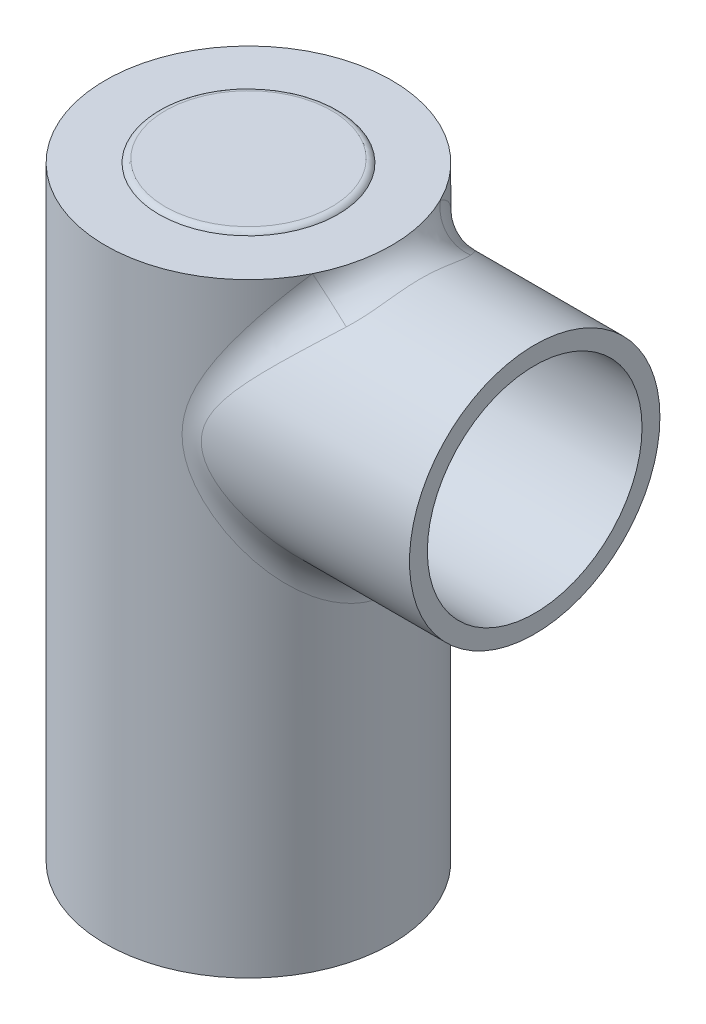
ISO-10303-21;
HEADER;
FILE_DESCRIPTION(('STEP AP214'),'2;1');
FILE_NAME('part.step','',(''),(''),'','','');
FILE_SCHEMA(('AUTOMOTIVE_DESIGN { 1 0 10303 214 1 1 1 1 }'));
ENDSEC;
DATA;
#1=APPLICATION_CONTEXT('core data for automotive mechanical design processes');
#2=APPLICATION_PROTOCOL_DEFINITION('international standard','automotive_design',2000,#1);
#3=PRODUCT_CONTEXT('',#1,'mechanical');
#4=PRODUCT('Part','Part','',(#3));
#5=PRODUCT_RELATED_PRODUCT_CATEGORY('part','',(#4));
#6=PRODUCT_DEFINITION_FORMATION('','',#4);
#7=PRODUCT_DEFINITION_CONTEXT('part definition',#1,'design');
#8=PRODUCT_DEFINITION('design','',#6,#7);
#9=PRODUCT_DEFINITION_SHAPE('','',#8);
#10=(LENGTH_UNIT() NAMED_UNIT(*) SI_UNIT(.MILLI.,.METRE.));
#11=(NAMED_UNIT(*) PLANE_ANGLE_UNIT() SI_UNIT($,.RADIAN.));
#12=(NAMED_UNIT(*) SI_UNIT($,.STERADIAN.) SOLID_ANGLE_UNIT());
#13=UNCERTAINTY_MEASURE_WITH_UNIT(LENGTH_MEASURE(1.E-05),#10,'distance_accuracy_value','');
#14=(GEOMETRIC_REPRESENTATION_CONTEXT(3) GLOBAL_UNCERTAINTY_ASSIGNED_CONTEXT((#13)) GLOBAL_UNIT_ASSIGNED_CONTEXT((#10,
#11,#12)) REPRESENTATION_CONTEXT('',''));
#15=CARTESIAN_POINT('',(0.,0.,0.));
#16=DIRECTION('',(0.,0.,1.));
#17=DIRECTION('',(1.,0.,0.));
#18=AXIS2_PLACEMENT_3D('',#15,#16,#17);
#19=CARTESIAN_POINT('',(0.,-160.,0.));
#20=DIRECTION('',(0.,-1.,0.));
#21=DIRECTION('',(0.,0.,-1.));
#22=AXIS2_PLACEMENT_3D('',#19,#20,#21);
#23=PLANE('',#22);
#24=CARTESIAN_POINT('',(0.,-160.,0.));
#25=DIRECTION('',(0.,-1.,0.));
#26=DIRECTION('',(0.,0.,-1.));
#27=AXIS2_PLACEMENT_3D('',#24,#25,#26);
#28=CIRCLE('',#27,40.);
#29=CARTESIAN_POINT('',(0.,-160.,-40.));
#30=VERTEX_POINT('',#29);
#31=EDGE_CURVE('E109',#30,#30,#28,.T.);
#32=ORIENTED_EDGE('',*,*,#31,.T.);
#33=EDGE_LOOP('',(#32));
#34=FACE_BOUND('',#33,.T.);
#35=CARTESIAN_POINT('',(0.,-160.,0.));
#36=DIRECTION('',(0.,-1.,0.));
#37=DIRECTION('',(0.,0.,-1.));
#38=AXIS2_PLACEMENT_3D('',#35,#36,#37);
#39=CIRCLE('',#38,35.);
#40=CARTESIAN_POINT('',(0.,-160.,-35.));
#41=VERTEX_POINT('',#40);
#42=EDGE_CURVE('E97',#41,#41,#39,.T.);
#43=ORIENTED_EDGE('',*,*,#42,.F.);
#44=EDGE_LOOP('',(#43));
#45=FACE_BOUND('',#44,.T.);
#46=ADVANCED_FACE('F46',(#34,#45),#23,.T.);
#47=CARTESIAN_POINT('',(0.,-160.,0.));
#48=DIRECTION('',(0.,1.,0.));
#49=DIRECTION('',(0.,0.,1.));
#50=AXIS2_PLACEMENT_3D('',#47,#48,#49);
#51=CYLINDRICAL_SURFACE('',#50,40.);
#52=ORIENTED_EDGE('',*,*,#31,.F.);
#53=EDGE_LOOP('',(#52));
#54=FACE_BOUND('',#53,.T.);
#55=CARTESIAN_POINT('',(0.,9.04735791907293,0.));
#56=DIRECTION('',(0.,1.,0.));
#57=DIRECTION('',(0.,0.,1.));
#58=AXIS2_PLACEMENT_3D('',#55,#56,#57);
#59=CIRCLE('',#58,40.);
#60=CARTESIAN_POINT('',(35.7743699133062,9.04735791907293,-17.8939782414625));
#61=VERTEX_POINT('',#60);
#62=CARTESIAN_POINT('',(35.7743699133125,9.04735791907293,17.8939782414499));
#63=VERTEX_POINT('',#62);
#64=EDGE_CURVE('E78',#61,#63,#59,.T.);
#65=ORIENTED_EDGE('',*,*,#64,.F.);
#66=CARTESIAN_POINT('',(17.6627992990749,-26.4701099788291,-35.8890724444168));
#67=CARTESIAN_POINT('',(19.7476529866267,-26.8841694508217,-34.8630121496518));
#68=CARTESIAN_POINT('',(22.0784991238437,-27.2545299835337,-34.8921537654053));
#69=CARTESIAN_POINT('',(17.5782173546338,-27.131472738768,-35.9307012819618));
#70=CARTESIAN_POINT('',(19.6556915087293,-27.4671804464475,-34.9143736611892));
#71=CARTESIAN_POINT('',(21.9727716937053,-27.7689232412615,-34.9326262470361));
#72=CARTESIAN_POINT('',(17.5161590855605,-27.7985542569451,-35.9608932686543));
#73=CARTESIAN_POINT('',(19.5880800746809,-28.0561198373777,-34.9516878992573));
#74=CARTESIAN_POINT('',(21.8951988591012,-28.2877644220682,-34.9619795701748));
#75=CARTESIAN_POINT('',(17.4410441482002,-29.1380384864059,-35.9973859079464));
#76=CARTESIAN_POINT('',(19.5062859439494,-29.2386789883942,-34.9967637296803));
#77=CARTESIAN_POINT('',(21.8013051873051,-29.3295854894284,-34.9974585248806));
#78=CARTESIAN_POINT('',(17.4279818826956,-29.810440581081,-36.0036892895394));
#79=CARTESIAN_POINT('',(19.4920458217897,-29.8326672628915,-35.0045570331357));
#80=CARTESIAN_POINT('',(21.7849773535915,-29.8525648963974,-35.0035868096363));
#81=CARTESIAN_POINT('',(17.4517395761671,-31.1537374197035,-35.9921788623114));
#82=CARTESIAN_POINT('',(19.5179214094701,-31.0188250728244,-34.9903375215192));
#83=CARTESIAN_POINT('',(21.8146744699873,-30.8973513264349,-34.9923961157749));
#84=CARTESIAN_POINT('',(17.4885757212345,-31.824631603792,-35.9743572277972));
#85=CARTESIAN_POINT('',(19.5580712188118,-31.61137043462,-34.9683059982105));
#86=CARTESIAN_POINT('',(21.860719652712,-31.4191579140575,-34.9750695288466));
#87=CARTESIAN_POINT('',(17.6097036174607,-33.1580277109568,-35.9152163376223));
#88=CARTESIAN_POINT('',(19.6899198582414,-32.7881321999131,-34.8952716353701));
#89=CARTESIAN_POINT('',(22.0121295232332,-32.456243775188,-34.9175714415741));
#90=CARTESIAN_POINT('',(17.6940045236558,-33.8205279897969,-35.8738925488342));
#91=CARTESIAN_POINT('',(19.7817095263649,-33.3727039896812,-34.8442180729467));
#92=CARTESIAN_POINT('',(22.1175056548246,-32.9715217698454,-34.8773955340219));
#93=CARTESIAN_POINT('',(17.9187814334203,-35.2171545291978,-35.7621995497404));
#94=CARTESIAN_POINT('',(20.026072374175,-34.6037753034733,-34.7063843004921));
#95=CARTESIAN_POINT('',(22.3984767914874,-34.0577868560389,-34.7688051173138));
#96=CARTESIAN_POINT('',(18.0651333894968,-35.9494021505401,-35.6887539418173));
#97=CARTESIAN_POINT('',(20.1851473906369,-35.2487597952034,-34.6157344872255));
#98=CARTESIAN_POINT('',(22.5814167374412,-34.6273127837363,-34.6973996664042));
#99=CARTESIAN_POINT('',(18.4030510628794,-37.3927583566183,-35.5156807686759));
#100=CARTESIAN_POINT('',(20.5515768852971,-36.5179425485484,-34.4024885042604));
#101=CARTESIAN_POINT('',(23.0038138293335,-35.7499231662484,-34.5291340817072));
#102=CARTESIAN_POINT('',(18.5946547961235,-38.1038485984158,-35.4160311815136));
#103=CARTESIAN_POINT('',(20.7592063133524,-37.1425048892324,-34.2797202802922));
#104=CARTESIAN_POINT('',(23.2433184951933,-36.3029933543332,-34.4322525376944));
#105=CARTESIAN_POINT('',(19.0145674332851,-39.5053464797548,-35.1923706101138));
#106=CARTESIAN_POINT('',(21.2130139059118,-38.3709037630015,-34.0047028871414));
#107=CARTESIAN_POINT('',(23.7682092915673,-37.3930472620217,-34.2148047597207));
#108=CARTESIAN_POINT('',(19.2429998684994,-40.1956748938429,-35.0682773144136));
#109=CARTESIAN_POINT('',(21.4595726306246,-38.9749697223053,-33.8521839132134));
#110=CARTESIAN_POINT('',(24.0537498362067,-37.9299693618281,-34.0941585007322));
#111=CARTESIAN_POINT('',(19.7279231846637,-41.5533496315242,-34.7977885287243));
#112=CARTESIAN_POINT('',(21.9813756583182,-40.1600469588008,-33.520453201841));
#113=CARTESIAN_POINT('',(24.6599039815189,-38.9859386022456,-33.8311832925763));
#114=CARTESIAN_POINT('',(19.9844080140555,-42.2207008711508,-34.6513978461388));
#115=CARTESIAN_POINT('',(22.2568640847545,-40.7413173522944,-33.3410579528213));
#116=CARTESIAN_POINT('',(24.9805100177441,-39.5049895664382,-33.688859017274));
#117=CARTESIAN_POINT('',(20.5013681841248,-43.4910107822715,-34.3478943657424));
#118=CARTESIAN_POINT('',(22.8101550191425,-41.8444401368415,-32.9700689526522));
#119=CARTESIAN_POINT('',(25.6267102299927,-40.4930083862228,-33.3937861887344));
#120=CARTESIAN_POINT('',(20.7604932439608,-44.0953310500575,-34.1921027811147));
#121=CARTESIAN_POINT('',(23.0869044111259,-42.3680081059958,-32.779815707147));
#122=CARTESIAN_POINT('',(25.9506165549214,-40.9630352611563,-33.2423221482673));
#123=CARTESIAN_POINT('',(21.2930559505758,-45.2863437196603,-33.8630145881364));
#124=CARTESIAN_POINT('',(23.6536910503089,-43.396719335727,-32.3789087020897));
#125=CARTESIAN_POINT('',(26.6163199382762,-41.8893784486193,-32.9223752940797));
#126=CARTESIAN_POINT('',(21.566493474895,-45.873036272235,-33.6897181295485));
#127=CARTESIAN_POINT('',(23.943906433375,-43.902002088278,-32.1680814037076));
#128=CARTESIAN_POINT('',(26.9581168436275,-42.3456948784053,-32.753892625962));
#129=CARTESIAN_POINT('',(22.1243227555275,-47.0304072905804,-33.3260455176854));
#130=CARTESIAN_POINT('',(24.5336552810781,-44.8953312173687,-31.7268365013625));
#131=CARTESIAN_POINT('',(27.6554034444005,-43.2458723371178,-32.4003220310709));
#132=CARTESIAN_POINT('',(22.4087227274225,-47.601073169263,-33.1356564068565));
#133=CARTESIAN_POINT('',(24.8333567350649,-45.3834777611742,-31.496223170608));
#134=CARTESIAN_POINT('',(28.0109034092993,-43.6897235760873,-32.2152215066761));
#135=CARTESIAN_POINT('',(22.9853693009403,-48.7269375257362,-32.7382869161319));
#136=CARTESIAN_POINT('',(25.4383979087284,-46.3427891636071,-31.0163331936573));
#137=CARTESIAN_POINT('',(28.7317116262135,-44.5653958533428,-31.8288900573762));
#138=CARTESIAN_POINT('',(23.2776158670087,-49.2821360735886,-32.5313066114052));
#139=CARTESIAN_POINT('',(25.7438824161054,-46.8140486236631,-30.7668678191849));
#140=CARTESIAN_POINT('',(29.0970198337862,-44.9972169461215,-31.6276592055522));
#141=CARTESIAN_POINT('',(23.8679482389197,-50.3786170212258,-32.1006961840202));
#142=CARTESIAN_POINT('',(26.3579931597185,-47.740690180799,-30.249578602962));
#143=CARTESIAN_POINT('',(29.8349352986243,-45.8500354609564,-31.2090101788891));
#144=CARTESIAN_POINT('',(24.1660412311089,-50.9198801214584,-31.8770444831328));
#145=CARTESIAN_POINT('',(26.6667480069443,-48.1961226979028,-29.9815369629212));
#146=CARTESIAN_POINT('',(30.2075515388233,-46.2710178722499,-30.9915710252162));
#147=CARTESIAN_POINT('',(24.7656878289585,-51.9883451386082,-31.4134436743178));
#148=CARTESIAN_POINT('',(27.2845374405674,-49.0907586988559,-29.4279570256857));
#149=CARTESIAN_POINT('',(30.9571097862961,-47.1020462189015,-30.5408480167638));
#150=CARTESIAN_POINT('',(25.0672416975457,-52.5155459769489,-31.1734933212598));
#151=CARTESIAN_POINT('',(27.5936804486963,-49.5300173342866,-29.1422159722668));
#152=CARTESIAN_POINT('',(31.3340521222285,-47.5120913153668,-30.3075629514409));
#153=CARTESIAN_POINT('',(25.9741961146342,-54.0762870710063,-30.4294592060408));
#154=CARTESIAN_POINT('',(28.5209023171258,-50.8274339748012,-28.256936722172));
#155=CARTESIAN_POINT('',(32.46774514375,-48.7260010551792,-29.5841964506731));
#156=CARTESIAN_POINT('',(26.5821881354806,-55.0895128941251,-29.9009770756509));
#157=CARTESIAN_POINT('',(29.1336944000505,-51.657624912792,-27.6334881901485));
#158=CARTESIAN_POINT('',(33.2277351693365,-49.5140655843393,-29.0703943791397));
#159=CARTESIAN_POINT('',(27.8508516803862,-57.156270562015,-28.7253856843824));
#160=CARTESIAN_POINT('',(30.3943982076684,-53.3294191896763,-26.2607398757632));
#161=CARTESIAN_POINT('',(34.8135646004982,-51.1215437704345,-27.9274583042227));
#162=CARTESIAN_POINT('',(28.5110421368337,-58.2044907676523,-28.0717768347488));
#163=CARTESIAN_POINT('',(31.0396496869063,-54.1633535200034,-25.5040173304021));
#164=CARTESIAN_POINT('',(35.6388026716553,-51.9368261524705,-27.2920052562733));
#165=CARTESIAN_POINT('',(29.813112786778,-60.2349416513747,-26.684893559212));
#166=CARTESIAN_POINT('',(32.2869581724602,-55.7490688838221,-23.922085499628));
#167=CARTESIAN_POINT('',(37.2663909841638,-53.5160657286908,-25.9436465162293));
#168=CARTESIAN_POINT('',(30.4549890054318,-61.2171580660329,-25.9516020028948));
#169=CARTESIAN_POINT('',(32.8889557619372,-56.5002874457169,-23.0947480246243));
#170=CARTESIAN_POINT('',(38.0687362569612,-54.2800118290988,-25.2307241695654));
#171=CARTESIAN_POINT('',(31.7073190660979,-63.1080963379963,-24.4055966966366));
#172=CARTESIAN_POINT('',(34.0344952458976,-57.9132218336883,-21.3823658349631));
#173=CARTESIAN_POINT('',(39.6341488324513,-55.7507415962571,-23.7276634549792));
#174=CARTESIAN_POINT('',(32.3178356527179,-64.0169672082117,-23.5930517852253));
#175=CARTESIAN_POINT('',(34.5775389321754,-58.5740278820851,-20.4956040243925));
#176=CARTESIAN_POINT('',(40.3972945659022,-56.4576411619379,-22.9376892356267));
#177=CARTESIAN_POINT('',(33.2018848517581,-65.3199390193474,-22.3137534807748));
#178=CARTESIAN_POINT('',(35.3363639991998,-59.4899415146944,-19.1373929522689));
#179=CARTESIAN_POINT('',(41.5023560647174,-57.4710636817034,-21.6939269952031));
#180=CARTESIAN_POINT('',(33.4912468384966,-65.7441589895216,-21.8772976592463));
#181=CARTESIAN_POINT('',(35.5816333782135,-59.7846101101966,-18.6764542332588));
#182=CARTESIAN_POINT('',(41.864058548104,-57.8010125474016,-21.2695949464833));
#183=CARTESIAN_POINT('',(34.0580484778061,-66.5714178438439,-20.9840217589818));
#184=CARTESIAN_POINT('',(36.0536528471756,-60.349688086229,-17.7444090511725));
#185=CARTESIAN_POINT('',(42.5725605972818,-58.4444361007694,-20.4011322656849));
#186=CARTESIAN_POINT('',(34.3354853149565,-66.9744517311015,-20.5271969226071));
#187=CARTESIAN_POINT('',(36.2802039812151,-60.6198375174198,-17.2732083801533));
#188=CARTESIAN_POINT('',(42.9193566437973,-58.7579069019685,-19.9569970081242));
#189=CARTESIAN_POINT('',(34.9997769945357,-67.9357420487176,-19.3812162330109));
#190=CARTESIAN_POINT('',(36.8132617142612,-61.253681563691,-16.1042285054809));
#191=CARTESIAN_POINT('',(43.7497212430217,-59.5055771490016,-18.8428491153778));
#192=CARTESIAN_POINT('',(35.3790822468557,-68.4813368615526,-18.6807937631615));
#193=CARTESIAN_POINT('',(37.1069531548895,-61.6012455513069,-15.4046175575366));
#194=CARTESIAN_POINT('',(44.2238528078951,-59.9299286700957,-18.1618828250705));
#195=CARTESIAN_POINT('',(36.1038027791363,-69.5190923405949,-17.2385206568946));
#196=CARTESIAN_POINT('',(37.6502944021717,-62.2425116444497,-13.995995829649));
#197=CARTESIAN_POINT('',(45.1297534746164,-60.7370718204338,-16.7596728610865));
#198=CARTESIAN_POINT('',(36.4492266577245,-70.0112665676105,-16.4966806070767));
#199=CARTESIAN_POINT('',(37.8991368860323,-62.5352333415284,-13.287267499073));
#200=CARTESIAN_POINT('',(45.5615333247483,-61.1198739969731,-16.038439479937));
#201=CARTESIAN_POINT('',(37.1010002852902,-70.9365936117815,-14.9733705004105));
#202=CARTESIAN_POINT('',(38.3519940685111,-63.0671192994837,-11.8678019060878));
#203=CARTESIAN_POINT('',(46.3762503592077,-61.8395728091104,-14.5574435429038));
#204=CARTESIAN_POINT('',(37.4073570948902,-71.369757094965,-14.1919076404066));
#205=CARTESIAN_POINT('',(38.5551391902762,-63.3052493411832,-11.1577639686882));
#206=CARTESIAN_POINT('',(46.7591963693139,-62.1764777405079,-13.7976879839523));
#207=CARTESIAN_POINT('',(37.9757285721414,-72.1711161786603,-12.5922368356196));
#208=CARTESIAN_POINT('',(38.9175694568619,-63.7298835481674,-9.74259240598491));
#209=CARTESIAN_POINT('',(47.4696607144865,-62.799757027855,-12.242452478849));
#210=CARTESIAN_POINT('',(38.2377424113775,-72.5393105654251,-11.7740282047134));
#211=CARTESIAN_POINT('',(39.0759904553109,-63.9153720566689,-9.03860041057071));
#212=CARTESIAN_POINT('',(47.7971780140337,-63.0861304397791,-11.4469718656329));
#213=CARTESIAN_POINT('',(38.7144808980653,-73.2078165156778,-10.0973090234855));
#214=CARTESIAN_POINT('',(39.3530308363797,-64.239871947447,-7.63423671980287));
#215=CARTESIAN_POINT('',(48.3931011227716,-63.6060795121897,-9.81682821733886));
#216=CARTESIAN_POINT('',(38.9287322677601,-73.5074494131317,-9.23848926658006));
#217=CARTESIAN_POINT('',(39.4704549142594,-64.3774863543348,-6.93563060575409));
#218=CARTESIAN_POINT('',(48.66091533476,-63.8391273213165,-8.98186456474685));
#219=CARTESIAN_POINT('',(39.3018654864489,-74.0284934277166,-7.49392164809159));
#220=CARTESIAN_POINT('',(39.667660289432,-64.6088299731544,-5.55154644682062));
#221=CARTESIAN_POINT('',(49.1273318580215,-64.2443837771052,-7.28575715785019));
#222=CARTESIAN_POINT('',(39.4607470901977,-74.2499041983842,-6.60817366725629));
#223=CARTESIAN_POINT('',(39.7468163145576,-64.7018283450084,-4.8680069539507));
#224=CARTESIAN_POINT('',(49.3259338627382,-64.4165921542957,-6.42461328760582));
#225=CARTESIAN_POINT('',(39.7190475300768,-74.6095342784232,-4.81811727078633));
#226=CARTESIAN_POINT('',(39.872154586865,-64.8492482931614,-3.51327345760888));
#227=CARTESIAN_POINT('',(49.6488094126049,-64.6963044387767,-4.68428067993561));
#228=CARTESIAN_POINT('',(39.8185169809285,-74.747824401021,-3.91382533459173));
#229=CARTESIAN_POINT('',(39.9179432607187,-64.9032082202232,-2.8442267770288));
#230=CARTESIAN_POINT('',(49.773146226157,-64.8038634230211,-3.80510796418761));
#231=CARTESIAN_POINT('',(39.9555134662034,-74.9382246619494,-2.09484060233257));
#232=CARTESIAN_POINT('',(39.9804335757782,-64.9768925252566,-1.51260835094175));
#233=CARTESIAN_POINT('',(49.9443918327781,-64.9519525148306,-2.03665058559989));
#234=CARTESIAN_POINT('',(39.9930501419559,-74.9903482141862,-1.18014944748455));
#235=CARTESIAN_POINT('',(39.9969240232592,-64.9963681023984,-0.852313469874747));
#236=CARTESIAN_POINT('',(49.9913126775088,-64.9924930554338,-1.14736751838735));
#237=CARTESIAN_POINT('',(40.0043348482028,-75.0060199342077,0.520629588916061));
#238=CARTESIAN_POINT('',(40.0019162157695,-65.002262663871,0.376161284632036));
#239=CARTESIAN_POINT('',(50.0054185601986,-65.0046821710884,0.506167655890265));
#240=CARTESIAN_POINT('',(39.9863495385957,-74.981046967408,1.30661990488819));
#241=CARTESIAN_POINT('',(39.9940296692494,-64.9929473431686,0.942608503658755));
#242=CARTESIAN_POINT('',(49.982936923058,-64.9852587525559,1.27032490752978));
#243=CARTESIAN_POINT('',(39.9043854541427,-74.8671717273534,2.8731483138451));
#244=CARTESIAN_POINT('',(39.9571424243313,-64.9494257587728,2.08149284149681));
#245=CARTESIAN_POINT('',(49.8804818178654,-64.896689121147,2.79333863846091));
#246=CARTESIAN_POINT('',(39.8404118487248,-74.7782766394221,3.65368700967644));
#247=CARTESIAN_POINT('',(39.928238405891,-64.9153335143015,2.65247712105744));
#248=CARTESIAN_POINT('',(49.8005148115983,-64.8275484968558,3.55219570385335));
#249=CARTESIAN_POINT('',(39.6677615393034,-74.5381345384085,5.20353402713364));
#250=CARTESIAN_POINT('',(39.8472102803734,-64.819906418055,3.80450867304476));
#251=CARTESIAN_POINT('',(49.5847019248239,-64.6407713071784,5.05899141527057));
#252=CARTESIAN_POINT('',(39.5590856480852,-74.3868886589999,5.97284255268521));
#253=CARTESIAN_POINT('',(39.7952909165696,-64.75881220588,4.38414785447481));
#254=CARTESIAN_POINT('',(49.4488570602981,-64.5231356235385,5.80693025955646));
#255=CARTESIAN_POINT('',(39.2991161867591,-74.0245783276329,7.49504530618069));
#256=CARTESIAN_POINT('',(39.6652235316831,-64.6059907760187,5.55561904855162));
#257=CARTESIAN_POINT('',(49.12389523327,-64.2413386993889,7.2868496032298));
#258=CARTESIAN_POINT('',(39.1478210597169,-73.8135116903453,8.24793893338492));
#259=CARTESIAN_POINT('',(39.5873913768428,-64.5146334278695,6.14613276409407));
#260=CARTESIAN_POINT('',(48.9347763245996,-64.0771757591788,8.01882951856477));
#261=CARTESIAN_POINT('',(38.8089453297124,-73.3398860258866,9.71710567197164));
#262=CARTESIAN_POINT('',(39.4042425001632,-64.299886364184,7.32657335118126));
#263=CARTESIAN_POINT('',(48.511181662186,-63.7088002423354,9.44718606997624));
#264=CARTESIAN_POINT('',(38.6221976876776,-73.0785074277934,10.4338162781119));
#265=CARTESIAN_POINT('',(39.2999571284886,-64.1777002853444,7.91502768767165));
#266=CARTESIAN_POINT('',(48.2777471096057,-63.5055057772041,10.1439880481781));
#267=CARTESIAN_POINT('',(38.213419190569,-72.5050776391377,11.8437055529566));
#268=CARTESIAN_POINT('',(39.0606319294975,-63.8973901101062,9.10102457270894));
#269=CARTESIAN_POINT('',(47.766773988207,-63.0595048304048,11.5147137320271));
#270=CARTESIAN_POINT('',(37.9913900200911,-72.1930288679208,12.5368853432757));
#271=CARTESIAN_POINT('',(38.9260676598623,-63.7398221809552,9.69764135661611));
#272=CARTESIAN_POINT('',(47.4892375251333,-62.8168002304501,12.1886385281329));
#273=CARTESIAN_POINT('',(37.5151282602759,-71.5218359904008,13.8972913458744));
#274=CARTESIAN_POINT('',(38.624369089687,-63.3863751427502,10.8964152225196));
#275=CARTESIAN_POINT('',(46.8939103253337,-62.2947613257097,13.5112554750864));
#276=CARTESIAN_POINT('',(37.2608862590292,-71.1626781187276,14.5645098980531));
#277=CARTESIAN_POINT('',(38.4577479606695,-63.1910988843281,11.4978616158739));
#278=CARTESIAN_POINT('',(46.576107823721,-62.015416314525,14.1599401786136));
#279=CARTESIAN_POINT('',(36.7234684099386,-70.4009927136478,15.8709178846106));
#280=CARTESIAN_POINT('',(38.0912155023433,-62.7609248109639,12.7014944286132));
#281=CARTESIAN_POINT('',(45.904335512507,-61.4229943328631,15.4300590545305));
#282=CARTESIAN_POINT('',(36.4402865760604,-69.9984562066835,16.5101014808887));
#283=CARTESIAN_POINT('',(37.8918336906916,-62.526654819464,13.3031959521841));
#284=CARTESIAN_POINT('',(45.550358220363,-61.1099103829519,16.0514875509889));
#285=CARTESIAN_POINT('',(35.7147763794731,-68.9631503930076,18.0404934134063));
#286=CARTESIAN_POINT('',(37.364064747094,-61.9051009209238,14.7685746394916));
#287=CARTESIAN_POINT('',(44.6434704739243,-60.3046725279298,17.5393685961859));
#288=CARTESIAN_POINT('',(35.2582274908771,-68.3083604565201,18.9155057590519));
#289=CARTESIAN_POINT('',(37.0172343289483,-61.4955318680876,15.6333701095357));
#290=CARTESIAN_POINT('',(44.0727843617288,-59.7953914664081,18.3900750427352));
#291=CARTESIAN_POINT('',(34.3004901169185,-66.9247688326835,20.6013868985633));
#292=CARTESIAN_POINT('',(36.2573566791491,-60.5931361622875,17.3393876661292));
#293=CARTESIAN_POINT('',(42.875612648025,-58.7192646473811,20.0291261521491));
#294=CARTESIAN_POINT('',(33.7992844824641,-66.1959386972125,21.4122308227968));
#295=CARTESIAN_POINT('',(35.8456244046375,-60.1019519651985,18.1806715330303));
#296=CARTESIAN_POINT('',(42.2491056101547,-58.1523967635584,20.8174466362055));
#297=CARTESIAN_POINT('',(32.7605108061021,-64.6715250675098,22.9701266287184));
#298=CARTESIAN_POINT('',(34.9624511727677,-59.0398536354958,19.8276957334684));
#299=CARTESIAN_POINT('',(40.9506385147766,-56.966741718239,22.3320675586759));
#300=CARTESIAN_POINT('',(32.2228878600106,-63.8758403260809,23.7170781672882));
#301=CARTESIAN_POINT('',(34.491904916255,-58.4701429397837,20.6341304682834));
#302=CARTESIAN_POINT('',(40.2786098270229,-56.3478758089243,23.0582704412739));
#303=CARTESIAN_POINT('',(31.1206051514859,-62.2253853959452,25.1460151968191));
#304=CARTESIAN_POINT('',(33.5006825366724,-57.2568822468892,22.1997213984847));
#305=CARTESIAN_POINT('',(38.9007564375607,-55.0641886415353,24.4475147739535));
#306=CARTESIAN_POINT('',(30.555948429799,-61.3706218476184,25.8280079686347));
#307=CARTESIAN_POINT('',(32.9806150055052,-56.6142888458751,22.9600611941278));
#308=CARTESIAN_POINT('',(38.1949355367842,-54.3993725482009,25.1105633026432));
#309=CARTESIAN_POINT('',(29.3960671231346,-59.5884352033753,27.14138084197));
#310=CARTESIAN_POINT('',(31.889656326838,-55.2466283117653,24.4407319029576));
#311=CARTESIAN_POINT('',(36.7450839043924,-53.0132273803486,26.3874535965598));
#312=CARTESIAN_POINT('',(28.8004522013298,-58.6598767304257,27.7714261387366));
#313=CARTESIAN_POINT('',(31.317973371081,-54.520489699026,25.1616794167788));
#314=CARTESIAN_POINT('',(36.0005652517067,-52.2910152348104,26.9999976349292));
#315=CARTESIAN_POINT('',(27.5987308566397,-56.7486606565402,28.9659702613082));
#316=CARTESIAN_POINT('',(30.1450179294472,-53.0008783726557,26.5404876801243));
#317=CARTESIAN_POINT('',(34.4984135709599,-50.8045138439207,28.16135997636));
#318=CARTESIAN_POINT('',(26.9926228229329,-55.7659946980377,29.53045891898));
#319=CARTESIAN_POINT('',(29.5435701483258,-52.2076055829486,27.199995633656));
#320=CARTESIAN_POINT('',(33.740778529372,-50.0402180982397,28.7101683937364));
#321=CARTESIAN_POINT('',(26.0834350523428,-54.2518146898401,30.3284915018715));
#322=CARTESIAN_POINT('',(28.6265848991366,-50.9651149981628,28.1415671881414));
#323=CARTESIAN_POINT('',(32.6042938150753,-48.8625225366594,29.4860334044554));
#324=CARTESIAN_POINT('',(25.7802755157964,-53.7402286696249,30.586457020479));
#325=CARTESIAN_POINT('',(28.3198214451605,-50.544145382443,28.4462751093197));
#326=CARTESIAN_POINT('',(32.2253443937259,-48.4646222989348,29.7368332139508));
#327=CARTESIAN_POINT('',(25.1754874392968,-52.703449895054,31.0861480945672));
#328=CARTESIAN_POINT('',(27.7043376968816,-49.6861798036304,29.0383991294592));
#329=CARTESIAN_POINT('',(31.4693593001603,-47.6582388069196,30.2226439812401));
#330=CARTESIAN_POINT('',(24.8738587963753,-52.178258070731,31.3278747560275));
#331=CARTESIAN_POINT('',(27.3955312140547,-49.2491497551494,29.3260222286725));
#332=CARTESIAN_POINT('',(31.0923234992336,-47.249756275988,30.4576560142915));
#333=CARTESIAN_POINT('',(24.273895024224,-51.1140208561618,31.7950077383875));
#334=CARTESIAN_POINT('',(26.7781857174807,-48.3591143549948,29.8833912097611));
#335=CARTESIAN_POINT('',(30.3423687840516,-46.4220162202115,30.9118130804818));
#336=CARTESIAN_POINT('',(23.9755590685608,-50.5749790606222,32.0204182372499));
#337=CARTESIAN_POINT('',(26.4695410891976,-47.9060593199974,30.1533430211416));
#338=CARTESIAN_POINT('',(29.9694488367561,-46.0027614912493,31.1309621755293));
#339=CARTESIAN_POINT('',(23.3841081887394,-49.4823642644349,32.4548632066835));
#340=CARTESIAN_POINT('',(25.8549517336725,-46.9836685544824,30.6748779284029));
#341=CARTESIAN_POINT('',(29.2301352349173,-45.1529499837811,31.5533392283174));
#342=CARTESIAN_POINT('',(23.0909929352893,-48.9287921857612,32.6638987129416));
#343=CARTESIAN_POINT('',(25.5488821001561,-46.5142608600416,30.9266583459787));
#344=CARTESIAN_POINT('',(28.8637411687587,-44.7223939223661,31.756568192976));
#345=CARTESIAN_POINT('',(22.4122509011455,-47.6122706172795,33.13480553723));
#346=CARTESIAN_POINT('',(24.8380539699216,-45.3945566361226,31.494499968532));
#347=CARTESIAN_POINT('',(28.0153136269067,-43.698432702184,32.2143942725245));
#348=CARTESIAN_POINT('',(22.0296626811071,-46.8430802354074,33.3899689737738));
#349=CARTESIAN_POINT('',(24.4345795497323,-44.7362530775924,31.8037949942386));
#350=CARTESIAN_POINT('',(27.537078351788,-43.1001735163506,32.462469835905));
#351=CARTESIAN_POINT('',(21.2851631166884,-45.2742372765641,33.8694234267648));
#352=CARTESIAN_POINT('',(23.6462356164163,-43.3877374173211,32.3860821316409));
#353=CARTESIAN_POINT('',(26.6064538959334,-41.879962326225,32.9286061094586));
#354=CARTESIAN_POINT('',(20.923255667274,-44.4745790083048,34.0937086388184));
#355=CARTESIAN_POINT('',(23.2609649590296,-42.6972246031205,32.6595069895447));
#356=CARTESIAN_POINT('',(26.1540695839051,-41.2580058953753,33.1466611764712));
#357=CARTESIAN_POINT('',(20.2309350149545,-42.8449256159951,34.5090069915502));
#358=CARTESIAN_POINT('',(22.5216274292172,-41.285033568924,33.1664967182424));
#359=CARTESIAN_POINT('',(25.2886687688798,-39.9904977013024,33.5504234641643));
#360=CARTESIAN_POINT('',(19.9004138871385,-42.0150491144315,34.7001361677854));
#361=CARTESIAN_POINT('',(22.1670088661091,-40.5631135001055,33.4006050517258));
#362=CARTESIAN_POINT('',(24.8755173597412,-39.3450382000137,33.7362434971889));
#363=CARTESIAN_POINT('',(19.2820424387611,-40.3199320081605,35.0475169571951));
#364=CARTESIAN_POINT('',(21.5020702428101,-39.084464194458,33.8264583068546));
#365=CARTESIAN_POINT('',(24.1025530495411,-38.0266137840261,34.073974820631));
#366=CARTESIAN_POINT('',(18.9941581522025,-39.454720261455,35.2037963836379));
#367=CARTESIAN_POINT('',(21.1912271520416,-38.3272830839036,34.0186128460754));
#368=CARTESIAN_POINT('',(23.742697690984,-37.3536713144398,34.2259131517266));
#369=CARTESIAN_POINT('',(18.6172757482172,-38.1675122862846,35.4036032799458));
#370=CARTESIAN_POINT('',(20.7833577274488,-37.1975196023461,34.264602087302));
#371=CARTESIAN_POINT('',(23.2715946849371,-36.3525095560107,34.4201698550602));
#372=CARTESIAN_POINT('',(18.5051009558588,-37.7596779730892,35.4623082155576));
#373=CARTESIAN_POINT('',(20.6619158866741,-36.8395165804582,34.3368695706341));
#374=CARTESIAN_POINT('',(23.1313761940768,-36.0353050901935,34.4772440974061));
#375=CARTESIAN_POINT('',(18.2947491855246,-36.9366741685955,35.5712826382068));
#376=CARTESIAN_POINT('',(20.4340338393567,-36.1164938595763,34.4710610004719));
#377=CARTESIAN_POINT('',(22.868436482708,-35.3951910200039,34.5831914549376));
#378=CARTESIAN_POINT('',(18.1965704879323,-36.5215055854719,35.6215531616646));
#379=CARTESIAN_POINT('',(20.3275455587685,-35.7514064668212,34.5330156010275));
#380=CARTESIAN_POINT('',(22.7457131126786,-35.0722821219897,34.6320655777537));
#381=CARTESIAN_POINT('',(18.0159538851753,-35.6842128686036,35.7132425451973));
#382=CARTESIAN_POINT('',(20.1315451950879,-35.0146401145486,34.6460373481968));
#383=CARTESIAN_POINT('',(22.519942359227,-34.421054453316,34.7212080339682));
#384=CARTESIAN_POINT('',(17.9335194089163,-35.2620872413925,35.7546594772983));
#385=CARTESIAN_POINT('',(20.0419937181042,-34.6428825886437,34.697128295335));
#386=CARTESIAN_POINT('',(22.4168992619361,-34.0927345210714,34.7614744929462));
#387=CARTESIAN_POINT('',(17.786128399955,-34.4117530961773,35.8282069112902));
#388=CARTESIAN_POINT('',(19.8818268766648,-33.8936507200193,34.7878625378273));
#389=CARTESIAN_POINT('',(22.2326604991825,-33.4313635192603,34.8329789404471));
#390=CARTESIAN_POINT('',(17.7211750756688,-33.9835434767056,35.8603357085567));
#391=CARTESIAN_POINT('',(19.8111772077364,-33.5160897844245,34.8275258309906));
#392=CARTESIAN_POINT('',(22.1514688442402,-33.0983115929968,34.8642152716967));
#393=CARTESIAN_POINT('',(17.591770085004,-32.9780577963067,35.9240385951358));
#394=CARTESIAN_POINT('',(19.6704243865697,-32.6293570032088,34.9061547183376));
#395=CARTESIAN_POINT('',(21.9897126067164,-32.3162671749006,34.9261486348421));
#396=CARTESIAN_POINT('',(17.534763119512,-32.3988604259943,35.951827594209));
#397=CARTESIAN_POINT('',(19.6083347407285,-32.1180960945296,34.9404909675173));
#398=CARTESIAN_POINT('',(21.9184539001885,-31.8657803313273,34.9531657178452));
#399=CARTESIAN_POINT('',(17.4574419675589,-31.2356994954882,35.9894372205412));
#400=CARTESIAN_POINT('',(19.5241453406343,-31.091294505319,34.9869442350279));
#401=CARTESIAN_POINT('',(21.8218024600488,-30.9610996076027,34.989730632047));
#402=CARTESIAN_POINT('',(17.4371290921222,-30.6517357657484,35.9992572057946));
#403=CARTESIAN_POINT('',(19.5020073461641,-30.5755132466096,34.9990824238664));
#404=CARTESIAN_POINT('',(21.7964113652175,-30.5069055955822,34.9992778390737));
#405=CARTESIAN_POINT('',(17.4342309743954,-29.4837779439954,36.0006611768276));
#406=CARTESIAN_POINT('',(19.498850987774,-29.5441604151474,35.0008167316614));
#407=CARTESIAN_POINT('',(21.7927887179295,-29.5984939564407,35.000642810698));
#408=CARTESIAN_POINT('',(17.4516349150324,-28.8997839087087,35.992250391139));
#409=CARTESIAN_POINT('',(19.5178193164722,-29.0283414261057,34.9904201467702));
#410=CARTESIAN_POINT('',(21.8145436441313,-29.1442763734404,34.99246565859));
#411=CARTESIAN_POINT('',(17.5232506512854,-27.7362015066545,35.9574360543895));
#412=CARTESIAN_POINT('',(19.5957993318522,-28.0011212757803,34.9474187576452));
#413=CARTESIAN_POINT('',(21.9040633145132,-28.2392678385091,34.9586183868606));
#414=CARTESIAN_POINT('',(17.5774661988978,-27.1566135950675,35.9310306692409));
#415=CARTESIAN_POINT('',(19.6548519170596,-27.489479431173,34.9147913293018));
#416=CARTESIAN_POINT('',(21.9718327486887,-27.7884772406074,34.9329464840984));
#417=CARTESIAN_POINT('',(17.736043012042,-25.8776084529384,35.8530650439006));
#418=CARTESIAN_POINT('',(19.8273922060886,-26.3611853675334,34.8185291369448));
#419=CARTESIAN_POINT('',(22.1700537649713,-26.7936954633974,34.8571465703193));
#420=CARTESIAN_POINT('',(17.8488812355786,-25.1802412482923,35.7972132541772));
#421=CARTESIAN_POINT('',(19.9501677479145,-25.7462848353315,34.7495538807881));
#422=CARTESIAN_POINT('',(22.3111015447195,-26.2512987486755,34.802846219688));
#423=CARTESIAN_POINT('',(18.1188539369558,-23.8028701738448,35.6613203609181));
#424=CARTESIAN_POINT('',(20.2433354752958,-24.5334787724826,34.581975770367));
#425=CARTESIAN_POINT('',(22.6485674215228,-25.1800101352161,34.6707281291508));
#426=CARTESIAN_POINT('',(18.2760034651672,-23.1228722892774,35.5812710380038));
#427=CARTESIAN_POINT('',(20.4139216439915,-23.9352269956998,34.4832568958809));
#428=CARTESIAN_POINT('',(22.8450043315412,-24.6511228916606,34.5929023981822));
#429=CARTESIAN_POINT('',(18.6273933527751,-21.7805272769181,35.398580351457));
#430=CARTESIAN_POINT('',(20.7944806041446,-22.7562918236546,34.2583307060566));
#431=CARTESIAN_POINT('',(23.2842416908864,-23.6070767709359,34.415286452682));
#432=CARTESIAN_POINT('',(18.8217560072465,-21.1182467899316,35.2958643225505));
#433=CARTESIAN_POINT('',(21.0047863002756,-22.1753831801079,34.1319023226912));
#434=CARTESIAN_POINT('',(23.527195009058,-23.0919697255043,34.3154236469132));
#435=CARTESIAN_POINT('',(19.2399453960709,-19.8139009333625,35.069659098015));
#436=CARTESIAN_POINT('',(21.4560958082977,-21.0336742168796,33.8539921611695));
#437=CARTESIAN_POINT('',(24.0499317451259,-22.0774785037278,34.0955019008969));
#438=CARTESIAN_POINT('',(19.4637856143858,-19.1718449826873,34.9461603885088));
#439=CARTESIAN_POINT('',(21.6973245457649,-20.4726415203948,33.7023507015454));
#440=CARTESIAN_POINT('',(24.3297320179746,-21.5781016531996,33.9754337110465));
#441=CARTESIAN_POINT('',(19.912437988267,-17.9668629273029,34.6922891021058));
#442=CARTESIAN_POINT('',(22.1793344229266,-19.4224446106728,33.3913184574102));
#443=CARTESIAN_POINT('',(24.8905474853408,-20.6408933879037,33.7286144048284));
#444=CARTESIAN_POINT('',(20.135195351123,-17.4021579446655,34.563643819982));
#445=CARTESIAN_POINT('',(22.4182731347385,-18.9311595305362,33.2338121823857));
#446=CARTESIAN_POINT('',(25.1689941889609,-20.2016784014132,33.6035426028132));
#447=CARTESIAN_POINT('',(20.5956403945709,-16.2883564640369,34.2912690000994));
#448=CARTESIAN_POINT('',(22.9107393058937,-17.9645750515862,32.9009943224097));
#449=CARTESIAN_POINT('',(25.7445504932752,-19.3353883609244,33.3387337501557));
#450=CARTESIAN_POINT('',(20.8333252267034,-15.7392570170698,34.1475423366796));
#451=CARTESIAN_POINT('',(23.1644087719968,-17.4891483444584,32.7255598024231));
#452=CARTESIAN_POINT('',(26.041656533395,-18.908311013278,33.1989994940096));
#453=CARTESIAN_POINT('',(21.3205952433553,-14.6551847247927,33.845449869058));
#454=CARTESIAN_POINT('',(23.6827907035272,-16.5531521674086,32.3576270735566));
#455=CARTESIAN_POINT('',(26.6507440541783,-18.0651436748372,32.9052984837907));
#456=CARTESIAN_POINT('',(21.5701902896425,-14.1202241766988,33.6870718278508));
#457=CARTESIAN_POINT('',(23.9476459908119,-16.0924926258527,32.1649830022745));
#458=CARTESIAN_POINT('',(26.9627378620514,-17.6490632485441,32.7513198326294));
#459=CARTESIAN_POINT('',(22.078407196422,-13.0640006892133,33.3561973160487));
#460=CARTESIAN_POINT('',(24.4850379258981,-15.1858227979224,31.7634894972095));
#461=CARTESIAN_POINT('',(27.5980089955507,-16.8275560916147,32.4296362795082));
#462=CARTESIAN_POINT('',(22.3370294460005,-12.5427383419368,33.1837002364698));
#463=CARTESIAN_POINT('',(24.7576980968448,-14.7397252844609,31.5545018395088));
#464=CARTESIAN_POINT('',(27.9212868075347,-16.4221298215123,32.2619307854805));
#465=CARTESIAN_POINT('',(22.861444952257,-11.5123800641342,32.8246167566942));
#466=CARTESIAN_POINT('',(25.3084368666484,-13.8610268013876,31.1206046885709));
#467=CARTESIAN_POINT('',(28.5768061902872,-15.6207400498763,31.9128218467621));
#468=CARTESIAN_POINT('',(23.1272483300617,-11.0033034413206,32.6380097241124));
#469=CARTESIAN_POINT('',(25.5866327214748,-13.4283763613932,30.8955303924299));
#470=CARTESIAN_POINT('',(28.9090604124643,-15.2247915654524,31.7313983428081));
#471=CARTESIAN_POINT('',(23.6637674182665,-9.99751478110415,32.2511330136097));
#472=CARTESIAN_POINT('',(26.1457712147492,-12.5769123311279,30.4302625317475));
#473=CARTESIAN_POINT('',(29.5797092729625,-14.4425114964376,31.3552682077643));
#474=CARTESIAN_POINT('',(23.9344830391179,-9.50080251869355,32.0508635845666));
#475=CARTESIAN_POINT('',(26.4268131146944,-12.1580384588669,30.1899216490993));
#476=CARTESIAN_POINT('',(29.9181037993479,-14.0561797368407,31.1605618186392));
#477=CARTESIAN_POINT('',(24.7513849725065,-8.02871742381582,31.42986244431));
#478=CARTESIAN_POINT('',(27.2731442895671,-10.9186865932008,29.4450379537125));
#479=CARTESIAN_POINT('',(30.9392312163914,-12.9112246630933,30.5568107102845));
#480=CARTESIAN_POINT('',(25.3025610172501,-7.07094207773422,30.9887790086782));
#481=CARTESIAN_POINT('',(27.8378657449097,-10.1214613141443,28.9195169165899));
#482=CARTESIAN_POINT('',(31.6282012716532,-12.1662882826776,30.1279795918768));
#483=CARTESIAN_POINT('',(26.4714614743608,-5.0922145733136,29.9985776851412));
#484=CARTESIAN_POINT('',(29.0223845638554,-8.4906108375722,27.7489406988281));
#485=CARTESIAN_POINT('',(33.0893268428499,-10.6272780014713,29.1652838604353));
#486=CARTESIAN_POINT('',(27.0895219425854,-4.07673583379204,29.4428662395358));
#487=CARTESIAN_POINT('',(29.6407156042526,-7.66445518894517,27.0963341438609));
#488=CARTESIAN_POINT('',(33.8619024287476,-9.83746120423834,28.6250088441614));
#489=CARTESIAN_POINT('',(28.317811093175,-2.10103720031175,28.2635237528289));
#490=CARTESIAN_POINT('',(30.8501326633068,-6.08036249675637,25.7275167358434));
#491=CARTESIAN_POINT('',(35.3972638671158,-8.30080671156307,27.4784258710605));
#492=CARTESIAN_POINT('',(28.9280384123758,-1.14082682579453,27.639881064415));
#493=CARTESIAN_POINT('',(31.4414998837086,-5.32255758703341,25.0095348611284));
#494=CARTESIAN_POINT('',(36.1600480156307,-7.55397642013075,26.8721065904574));
#495=CARTESIAN_POINT('',(30.1298290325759,0.720496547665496,26.3246285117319));
#496=CARTESIAN_POINT('',(32.5837161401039,-3.87984144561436,23.5168041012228));
#497=CARTESIAN_POINT('',(37.6622862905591,-6.1062804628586,25.5933888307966));
#498=CARTESIAN_POINT('',(30.7214164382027,1.62168764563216,25.6331116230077));
#499=CARTESIAN_POINT('',(33.134506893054,-3.19533498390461,22.7404582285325));
#500=CARTESIAN_POINT('',(38.4017705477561,-5.40535405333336,24.9210807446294));
#501=CARTESIAN_POINT('',(31.8773394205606,3.36153416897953,24.1804986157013));
#502=CARTESIAN_POINT('',(34.1854294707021,-1.90286664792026,21.1377583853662));
#503=CARTESIAN_POINT('',(39.8466742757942,-4.05214009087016,23.5088180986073));
#504=CARTESIAN_POINT('',(32.4416806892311,4.20020267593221,23.4194171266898));
#505=CARTESIAN_POINT('',(34.68500187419,-1.29584428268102,20.3100101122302));
#506=CARTESIAN_POINT('',(40.5521008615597,-3.3998423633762,22.7688777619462));
#507=CARTESIAN_POINT('',(33.4450105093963,5.67758361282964,21.9564402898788));
#508=CARTESIAN_POINT('',(35.5465536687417,-0.25677148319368,18.7544091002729));
#509=CARTESIAN_POINT('',(41.8062631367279,-2.2507683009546,21.3465391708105));
#510=CARTESIAN_POINT('',(33.8894764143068,6.32665490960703,21.2649931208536));
#511=CARTESIAN_POINT('',(35.9181189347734,0.188077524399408,18.0296095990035));
#512=CARTESIAN_POINT('',(42.3618455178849,-1.74593506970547,20.6742988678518));
#513=CARTESIAN_POINT('',(34.7468714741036,7.57095427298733,19.833081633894));
#514=CARTESIAN_POINT('',(36.6145057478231,1.0179697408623,16.5590098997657));
#515=CARTESIAN_POINT('',(43.4335893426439,-0.778146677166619,19.2821626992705));
#516=CARTESIAN_POINT('',(35.1598011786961,8.16618327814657,19.0926181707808));
#517=CARTESIAN_POINT('',(36.9385104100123,1.40197370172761,15.8130151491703));
#518=CARTESIAN_POINT('',(43.9497514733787,-0.3151907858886,18.5622676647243));
#519=CARTESIAN_POINT('',(35.9476604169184,9.29621783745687,17.5642898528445));
#520=CARTESIAN_POINT('',(37.5363063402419,2.10827557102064,14.3091464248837));
#521=CARTESIAN_POINT('',(44.9345755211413,0.56372498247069,17.0763929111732));
#522=CARTESIAN_POINT('',(36.3226183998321,9.83106866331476,16.7764612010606));
#523=CARTESIAN_POINT('',(37.8091553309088,2.42942391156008,13.5515361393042));
#524=CARTESIAN_POINT('',(45.4032729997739,0.979720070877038,16.3104483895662));
#525=CARTESIAN_POINT('',(37.0284323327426,10.8339082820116,15.1550805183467));
#526=CARTESIAN_POINT('',(38.3035840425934,3.01035705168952,12.0331128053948));
#527=CARTESIAN_POINT('',(46.2855404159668,1.75970644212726,14.7341060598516));
#528=CARTESIAN_POINT('',(37.3592960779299,11.3019088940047,14.3215366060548));
#529=CARTESIAN_POINT('',(38.5241009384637,3.26887584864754,11.2731020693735));
#530=CARTESIAN_POINT('',(46.699120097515,2.12370691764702,13.9237161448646));
#531=CARTESIAN_POINT('',(37.9195478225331,12.0919707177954,12.7546225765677));
#532=CARTESIAN_POINT('',(38.8819489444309,3.68815548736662,9.88617282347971));
#533=CARTESIAN_POINT('',(47.3994347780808,2.73819944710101,12.4003275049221));
#534=CARTESIAN_POINT('',(38.1566602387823,12.4253579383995,12.0276609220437));
#535=CARTESIAN_POINT('',(39.0266921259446,3.85764264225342,9.25766493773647));
#536=CARTESIAN_POINT('',(47.6958252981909,2.9975006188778,11.693559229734));
#537=CARTESIAN_POINT('',(38.5920295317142,13.0362688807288,10.5475161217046));
#538=CARTESIAN_POINT('',(39.2830268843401,4.15786689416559,8.0084775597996));
#539=CARTESIAN_POINT('',(48.240036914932,3.47265357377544,10.2545295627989));
#540=CARTESIAN_POINT('',(38.7902902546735,13.3137981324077,9.79433558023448));
#541=CARTESIAN_POINT('',(39.3940644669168,4.28795597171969,7.38885778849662));
#542=CARTESIAN_POINT('',(48.4878628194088,3.68850965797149,9.52227070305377));
#543=CARTESIAN_POINT('',(39.144439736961,13.8087999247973,8.26605924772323));
#544=CARTESIAN_POINT('',(39.5857279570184,4.51267949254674,6.1600319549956));
#545=CARTESIAN_POINT('',(48.9305496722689,4.07351105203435,8.03644649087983));
#546=CARTESIAN_POINT('',(39.3003495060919,14.0263022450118,7.49097453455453));
#547=CARTESIAN_POINT('',(39.6659065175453,4.60679117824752,5.55209885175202));
#548=CARTESIAN_POINT('',(49.1254368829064,4.24267952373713,7.28289190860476));
#549=CARTESIAN_POINT('',(39.5669699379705,14.3978714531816,5.92341787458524));
#550=CARTESIAN_POINT('',(39.7991903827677,4.76339603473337,4.34628231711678));
#551=CARTESIAN_POINT('',(49.4587124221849,4.53167779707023,5.75887848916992));
#552=CARTESIAN_POINT('',(39.6776801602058,14.5519377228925,5.13094575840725));
#553=CARTESIAN_POINT('',(39.8519511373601,4.82548573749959,3.74983984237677));
#554=CARTESIAN_POINT('',(49.5971002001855,4.65150711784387,4.98841948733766));
#555=CARTESIAN_POINT('',(39.8520178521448,14.7944114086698,3.53087539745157));
#556=CARTESIAN_POINT('',(39.9335903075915,4.92164115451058,2.56187794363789));
#557=CARTESIAN_POINT('',(49.8150223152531,4.84009776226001,3.43279552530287));
#558=CARTESIAN_POINT('',(39.9154376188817,14.8825291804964,2.72322621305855));
#559=CARTESIAN_POINT('',(39.9621423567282,4.95532343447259,1.97196016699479));
#560=CARTESIAN_POINT('',(49.8942970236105,4.90863380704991,2.64758104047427));
#561=CARTESIAN_POINT('',(39.9930275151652,14.9903219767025,1.10263315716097));
#562=CARTESIAN_POINT('',(39.9969969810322,4.99645034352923,0.795015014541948));
#563=CARTESIAN_POINT('',(49.9912843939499,4.99247264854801,1.07200445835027));
#564=CARTESIAN_POINT('',(40.0071975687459,15.0099968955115,0.289689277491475));
#565=CARTESIAN_POINT('',(40.0032042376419,5.00378253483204,0.209595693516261));
#566=CARTESIAN_POINT('',(50.0089969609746,5.00777536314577,0.281642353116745));
#567=CARTESIAN_POINT('',(39.9859765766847,14.9805226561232,-1.33472044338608));
#568=CARTESIAN_POINT('',(39.9937636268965,4.99263792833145,-0.964099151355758));
#569=CARTESIAN_POINT('',(49.9824707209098,4.98485095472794,-1.29764487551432));
#570=CARTESIAN_POINT('',(39.9505868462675,14.9313753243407,-2.14618632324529));
#571=CARTESIAN_POINT('',(39.9781421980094,4.97419234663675,-1.55075708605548));
#572=CARTESIAN_POINT('',(49.9382335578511,4.94662525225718,-2.08657003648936));
#573=CARTESIAN_POINT('',(39.8310226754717,14.76520712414,-3.76099423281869));
#574=CARTESIAN_POINT('',(39.9236610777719,4.90994879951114,-2.73236850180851));
#575=CARTESIAN_POINT('',(49.7887783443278,4.81738331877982,-3.65652217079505));
#576=CARTESIAN_POINT('',(39.7468496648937,14.6481882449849,-4.56433649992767));
#577=CARTESIAN_POINT('',(39.8849504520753,4.86432644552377,-3.32572891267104));
#578=CARTESIAN_POINT('',(49.6835620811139,4.72636863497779,-4.43754937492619));
#579=CARTESIAN_POINT('',(39.5389087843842,14.3587594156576,-6.1020364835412));
#580=CARTESIAN_POINT('',(39.7850103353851,4.74673578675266,-4.48354094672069));
#581=CARTESIAN_POINT('',(49.4236359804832,4.50125732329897,-5.93253547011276));
#582=CARTESIAN_POINT('',(39.4182525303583,14.1906989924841,-6.83734661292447));
#583=CARTESIAN_POINT('',(39.7257563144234,4.67708118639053,-5.04569311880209));
#584=CARTESIAN_POINT('',(49.272815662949,4.37054366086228,-6.64742031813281));
#585=CARTESIAN_POINT('',(39.1382948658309,13.8001664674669,-8.29106576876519));
#586=CARTESIAN_POINT('',(39.5818430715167,4.50813085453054,-6.18134317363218));
#587=CARTESIAN_POINT('',(48.9228685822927,4.06679614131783,-8.0607583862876));
#588=CARTESIAN_POINT('',(38.9789964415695,13.577698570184,-9.00947609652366));
#589=CARTESIAN_POINT('',(39.4975045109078,4.40921021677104,-6.75370333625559));
#590=CARTESIAN_POINT('',(48.7237455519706,3.89376555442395,-8.75921287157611));
#591=CARTESIAN_POINT('',(38.6242930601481,13.0813905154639,-10.4257871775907));
#592=CARTESIAN_POINT('',(39.3006374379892,4.17849203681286,-7.90896396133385));
#593=CARTESIAN_POINT('',(48.2803663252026,3.50774817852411,-10.1361819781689));
#594=CARTESIAN_POINT('',(38.4288831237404,12.8075432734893,-11.1236850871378));
#595=CARTESIAN_POINT('',(39.1885096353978,4.04716270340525,-8.49086831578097));
#596=CARTESIAN_POINT('',(48.0361039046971,3.29475587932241,-10.8146938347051));
#597=CARTESIAN_POINT('',(38.0048370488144,12.211880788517,-12.4959343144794));
#598=CARTESIAN_POINT('',(38.9338429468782,3.7489071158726,-9.66250855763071));
#599=CARTESIAN_POINT('',(47.506046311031,2.83146283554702,-12.1488250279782));
#600=CARTESIAN_POINT('',(37.7761945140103,11.8900563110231,-13.1702810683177));
#601=CARTESIAN_POINT('',(38.7917675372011,3.58252347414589,-10.2514281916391));
#602=CARTESIAN_POINT('',(47.2202431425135,2.58115490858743,-12.8044399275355));
#603=CARTESIAN_POINT('',(37.2066781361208,11.0861552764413,-14.7156447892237));
#604=CARTESIAN_POINT('',(38.4232608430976,3.15065463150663,-11.6295572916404));
#605=CARTESIAN_POINT('',(46.5083476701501,1.9558985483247,-14.3068768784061));
#606=CARTESIAN_POINT('',(36.8539250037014,10.5865905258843,-15.5765030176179));
#607=CARTESIAN_POINT('',(38.184660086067,2.87081827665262,-12.4216838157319));
#608=CARTESIAN_POINT('',(46.0674062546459,1.56734818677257,-15.1438223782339));
#609=CARTESIAN_POINT('',(36.1018482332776,9.51632031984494,-17.2481089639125));
#610=CARTESIAN_POINT('',(37.6495240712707,2.24154473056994,-14.002251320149));
#611=CARTESIAN_POINT('',(45.1273102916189,0.734915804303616,-16.7689948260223));
#612=CARTESIAN_POINT('',(35.7025117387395,8.94559522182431,-18.0588427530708));
#613=CARTESIAN_POINT('',(37.3541743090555,1.89352447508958,-14.7899043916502));
#614=CARTESIAN_POINT('',(44.628139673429,0.291018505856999,-17.5572082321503));
#615=CARTESIAN_POINT('',(34.8637697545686,7.73963889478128,-19.6293506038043));
#616=CARTESIAN_POINT('',(36.7072295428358,1.12787700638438,-16.3512379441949));
#617=CARTESIAN_POINT('',(43.579712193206,-0.646947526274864,-19.0840908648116));
#618=CARTESIAN_POINT('',(34.4242948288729,7.10429565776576,-20.389032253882));
#619=CARTESIAN_POINT('',(36.3566074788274,0.711445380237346,-17.1247424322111));
#620=CARTESIAN_POINT('',(43.0303685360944,-1.14110337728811,-19.8226702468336));
#621=CARTESIAN_POINT('',(33.5127942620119,5.77668688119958,-21.8549250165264));
#622=CARTESIAN_POINT('',(35.6040365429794,-0.187984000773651,-18.6459478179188));
#623=CARTESIAN_POINT('',(41.8909928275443,-2.17368798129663,-21.2478437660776));
#624=CARTESIAN_POINT('',(33.0407680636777,5.08442036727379,-22.5611352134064));
#625=CARTESIAN_POINT('',(35.2029533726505,-0.669862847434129,-19.3939890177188));
#626=CARTESIAN_POINT('',(41.3009600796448,-2.71211749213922,-21.9344370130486));
#627=CARTESIAN_POINT('',(31.9196383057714,3.42497454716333,-24.1316160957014));
#628=CARTESIAN_POINT('',(34.2258631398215,-1.85359876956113,-21.079119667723));
#629=CARTESIAN_POINT('',(39.8995478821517,-4.00279757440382,-23.4612934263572));
#630=CARTESIAN_POINT('',(31.2611396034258,2.43928222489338,-24.9766874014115));
#631=CARTESIAN_POINT('',(33.6322919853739,-2.57938287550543,-22.0094906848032));
#632=CARTESIAN_POINT('',(39.0764245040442,-4.76944715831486,-24.2828905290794));
#633=CARTESIAN_POINT('',(29.9131672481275,0.388555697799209,-26.5762386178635));
#634=CARTESIAN_POINT('',(32.3828636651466,-4.13120728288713,-23.7961548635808));
#635=CARTESIAN_POINT('',(37.3914590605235,-6.3644566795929,-25.8380097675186));
#636=CARTESIAN_POINT('',(29.2236805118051,-0.676512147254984,-27.3306797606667));
#637=CARTESIAN_POINT('',(31.7275590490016,-4.95613062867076,-24.6547267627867));
#638=CARTESIAN_POINT('',(36.529600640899,-7.19284278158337,-26.5714942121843));
#639=CARTESIAN_POINT('',(28.1772051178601,-2.32930948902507,-28.3953020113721));
#640=CARTESIAN_POINT('',(30.7078495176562,-6.26843354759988,-25.8843290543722));
#641=CARTESIAN_POINT('',(35.2215063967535,-8.47835182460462,-27.6065436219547));
#642=CARTESIAN_POINT('',(27.8262199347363,-2.88963740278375,-28.7391063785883));
#643=CARTESIAN_POINT('',(30.3639456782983,-6.71550214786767,-26.2823617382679));
#644=CARTESIAN_POINT('',(34.7827749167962,-8.91416242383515,-27.9407978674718));
#645=CARTESIAN_POINT('',(27.1221146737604,-4.02847602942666,-29.4045134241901));
#646=CARTESIAN_POINT('',(29.6679947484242,-7.63196599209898,-27.0565290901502));
#647=CARTESIAN_POINT('',(33.9026433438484,-9.79992580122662,-28.5877213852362));
#648=CARTESIAN_POINT('',(26.768994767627,-4.60698529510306,-29.7261178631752));
#649=CARTESIAN_POINT('',(29.3158855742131,-8.10134467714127,-27.4329951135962));
#650=CARTESIAN_POINT('',(33.4612434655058,-10.2498774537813,-28.9003923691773));
#651=CARTESIAN_POINT('',(26.0628459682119,-5.78197455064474,-30.3471424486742));
#652=CARTESIAN_POINT('',(28.6063966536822,-9.06183611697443,-28.163019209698));
#653=CARTESIAN_POINT('',(32.5785574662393,-11.1637579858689,-29.5041662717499));
#654=CARTESIAN_POINT('',(25.7098170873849,-6.37844805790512,-30.6465704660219));
#655=CARTESIAN_POINT('',(28.2489165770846,-9.5529642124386,-28.5169143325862));
#656=CARTESIAN_POINT('',(32.1372713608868,-11.6276818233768,-29.7952768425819));
#657=CARTESIAN_POINT('',(25.0061308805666,-7.58984788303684,-31.223394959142));
#658=CARTESIAN_POINT('',(27.5316894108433,-10.5569057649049,-29.2010995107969));
#659=CARTESIAN_POINT('',(31.2576635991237,-12.5698816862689,-30.3560784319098));
#660=CARTESIAN_POINT('',(24.6554733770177,-8.20477280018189,-31.5007931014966));
#661=CARTESIAN_POINT('',(27.1718018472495,-11.0697776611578,-29.5317159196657));
#662=CARTESIAN_POINT('',(30.8193417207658,-13.0481566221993,-30.6257710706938));
#663=CARTESIAN_POINT('',(23.8719027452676,-9.61046813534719,-32.1003528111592));
#664=CARTESIAN_POINT('',(26.3637704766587,-12.2477857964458,-30.2478248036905));
#665=CARTESIAN_POINT('',(29.8398784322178,-14.1414752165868,-31.2086763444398));
#666=CARTESIAN_POINT('',(23.4404186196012,-10.4066584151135,-32.4162903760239));
#667=CARTESIAN_POINT('',(25.9149465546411,-12.9202912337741,-30.6276120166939));
#668=CARTESIAN_POINT('',(29.3005232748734,-14.7607343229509,-31.5158378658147));
#669=CARTESIAN_POINT('',(22.5920203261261,-12.0311965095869,-33.01317213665));
#670=CARTESIAN_POINT('',(25.0274588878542,-14.300510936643,-31.3471081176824));
#671=CARTESIAN_POINT('',(28.2400254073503,-16.0242639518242,-32.0961395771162));
#672=CARTESIAN_POINT('',(22.1751069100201,-12.859545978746,-33.2941145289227));
#673=CARTESIAN_POINT('',(24.5883684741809,-15.0084975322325,-31.6874071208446));
#674=CARTESIAN_POINT('',(27.7188836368,-16.6685357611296,-32.369278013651));
#675=CARTESIAN_POINT('',(21.3651835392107,-14.5502692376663,-33.819543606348));
#676=CARTESIAN_POINT('',(23.7315464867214,-16.4604805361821,-32.3251665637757));
#677=CARTESIAN_POINT('',(26.7064794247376,-17.9835427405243,-32.8801118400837));
#678=CARTESIAN_POINT('',(20.9721416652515,-15.4125949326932,-34.0640796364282));
#679=CARTESIAN_POINT('',(23.3132867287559,-17.2047817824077,-32.6232403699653));
#680=CARTESIAN_POINT('',(26.2151770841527,-18.6542405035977,-33.1178552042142));
#681=CARTESIAN_POINT('',(20.221196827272,-17.1758673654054,-34.5151363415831));
#682=CARTESIAN_POINT('',(22.5114660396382,-18.732542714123,-33.1738295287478));
#683=CARTESIAN_POINT('',(25.2764960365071,-20.025674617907,-33.5563825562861));
#684=CARTESIAN_POINT('',(19.863278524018,-18.0767969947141,-34.7216736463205));
#685=CARTESIAN_POINT('',(22.1273177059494,-19.516457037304,-33.4268854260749));
#686=CARTESIAN_POINT('',(24.8290981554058,-20.726397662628,-33.7571827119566));
#687=CARTESIAN_POINT('',(19.3184515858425,-19.5882203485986,-35.0265196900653));
#688=CARTESIAN_POINT('',(21.5407196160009,-20.8365119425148,-33.8010158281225));
#689=CARTESIAN_POINT('',(24.148064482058,-21.9019491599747,-34.053560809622));
#690=CARTESIAN_POINT('',(19.1164042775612,-20.1863511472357,-35.1370054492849));
#691=CARTESIAN_POINT('',(21.3228032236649,-21.3595836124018,-33.9367373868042));
#692=CARTESIAN_POINT('',(23.8955053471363,-22.3671620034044,-34.1609775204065));
#693=CARTESIAN_POINT('',(18.7384775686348,-21.40033507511,-35.3399973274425));
#694=CARTESIAN_POINT('',(20.9146812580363,-22.4228528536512,-34.186224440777));
#695=CARTESIAN_POINT('',(23.423096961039,-23.3113717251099,-34.3583307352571));
#696=CARTESIAN_POINT('',(18.5626024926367,-22.0161911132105,-35.432500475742));
#697=CARTESIAN_POINT('',(20.7243125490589,-22.9632524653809,-34.3001021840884));
#698=CARTESIAN_POINT('',(23.2032531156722,-23.790370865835,-34.4482643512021));
#699=CARTESIAN_POINT('',(18.2433667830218,-23.2635328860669,-35.5979199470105));
#700=CARTESIAN_POINT('',(20.3784790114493,-24.0590461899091,-34.5037989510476));
#701=CARTESIAN_POINT('',(22.8042084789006,-24.7605255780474,-34.6090888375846));
#702=CARTESIAN_POINT('',(18.099933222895,-23.8949799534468,-35.6708802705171));
#703=CARTESIAN_POINT('',(20.2227759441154,-24.6146389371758,-34.5937738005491));
#704=CARTESIAN_POINT('',(22.6249165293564,-25.251651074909,-34.6800224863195));
#705=CARTESIAN_POINT('',(17.8513270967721,-25.1724769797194,-35.7959433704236));
#706=CARTESIAN_POINT('',(19.9527964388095,-25.739552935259,-34.7480019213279));
#707=CARTESIAN_POINT('',(22.3141588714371,-26.2452598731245,-34.8016116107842));
#708=CARTESIAN_POINT('',(17.7461316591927,-25.8185179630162,-35.8480586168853));
#709=CARTESIAN_POINT('',(19.8383544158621,-26.3091468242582,-34.812354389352));
#710=CARTESIAN_POINT('',(22.182664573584,-26.7477361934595,-34.8522792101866));
#711=CARTESIAN_POINT('',(17.6627992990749,-26.4701099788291,-35.8890724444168));
#712=CARTESIAN_POINT('',(19.7476529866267,-26.8841694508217,-34.8630121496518));
#713=CARTESIAN_POINT('',(22.0784991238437,-27.2545299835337,-34.8921537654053));
#714=(BOUNDED_SURFACE() B_SPLINE_SURFACE(3,2,((#66,#67,#68),(#69,#70,#71),(#72,#73,#74),(#75,
#76,#77),(#78,#79,#80),(#81,#82,#83),(#84,#85,#86),(#87,#88,#89),(#90,#91,#92),(#93,#94,#95),
(#96,#97,#98),(#99,#100,#101),(#102,#103,#104),(#105,#106,#107),(#108,#109,#110),(#111,#112,
#113),(#114,#115,#116),(#117,#118,#119),(#120,#121,#122),(#123,#124,#125),(#126,#127,#128),
(#129,#130,#131),(#132,#133,#134),(#135,#136,#137),(#138,#139,#140),(#141,#142,#143),(#144,#145,
#146),(#147,#148,#149),(#150,#151,#152),(#153,#154,#155),(#156,#157,#158),(#159,#160,#161),
(#162,#163,#164),(#165,#166,#167),(#168,#169,#170),(#171,#172,#173),(#174,#175,#176),(#177,#178,
#179),(#180,#181,#182),(#183,#184,#185),(#186,#187,#188),(#189,#190,#191),(#192,#193,#194),
(#195,#196,#197),(#198,#199,#200),(#201,#202,#203),(#204,#205,#206),(#207,#208,#209),(#210,#211,
#212),(#213,#214,#215),(#216,#217,#218),(#219,#220,#221),(#222,#223,#224),(#225,#226,#227),
(#228,#229,#230),(#231,#232,#233),(#234,#235,#236),(#237,#238,#239),(#240,#241,#242),(#243,#244,
#245),(#246,#247,#248),(#249,#250,#251),(#252,#253,#254),(#255,#256,#257),(#258,#259,#260),
(#261,#262,#263),(#264,#265,#266),(#267,#268,#269),(#270,#271,#272),(#273,#274,#275),(#276,#277,
#278),(#279,#280,#281),(#282,#283,#284),(#285,#286,#287),(#288,#289,#290),(#291,#292,#293),
(#294,#295,#296),(#297,#298,#299),(#300,#301,#302),(#303,#304,#305),(#306,#307,#308),(#309,#310,
#311),(#312,#313,#314),(#315,#316,#317),(#318,#319,#320),(#321,#322,#323),(#324,#325,#326),
(#327,#328,#329),(#330,#331,#332),(#333,#334,#335),(#336,#337,#338),(#339,#340,#341),(#342,#343,
#344),(#345,#346,#347),(#348,#349,#350),(#351,#352,#353),(#354,#355,#356),(#357,#358,#359),
(#360,#361,#362),(#363,#364,#365),(#366,#367,#368),(#369,#370,#371),(#372,#373,#374),(#375,#376,
#377),(#378,#379,#380),(#381,#382,#383),(#384,#385,#386),(#387,#388,#389),(#390,#391,#392),
(#393,#394,#395),(#396,#397,#398),(#399,#400,#401),(#402,#403,#404),(#405,#406,#407),(#408,#409,
#410),(#411,#412,#413),(#414,#415,#416),(#417,#418,#419),(#420,#421,#422),(#423,#424,#425),
(#426,#427,#428),(#429,#430,#431),(#432,#433,#434),(#435,#436,#437),(#438,#439,#440),(#441,#442,
#443),(#444,#445,#446),(#447,#448,#449),(#450,#451,#452),(#453,#454,#455),(#456,#457,#458),
(#459,#460,#461),(#462,#463,#464),(#465,#466,#467),(#468,#469,#470),(#471,#472,#473),(#474,#475,
#476),(#477,#478,#479),(#480,#481,#482),(#483,#484,#485),(#486,#487,#488),(#489,#490,#491),
(#492,#493,#494),(#495,#496,#497),(#498,#499,#500),(#501,#502,#503),(#504,#505,#506),(#507,#508,
#509),(#510,#511,#512),(#513,#514,#515),(#516,#517,#518),(#519,#520,#521),(#522,#523,#524),
(#525,#526,#527),(#528,#529,#530),(#531,#532,#533),(#534,#535,#536),(#537,#538,#539),(#540,#541,
#542),(#543,#544,#545),(#546,#547,#548),(#549,#550,#551),(#552,#553,#554),(#555,#556,#557),
(#558,#559,#560),(#561,#562,#563),(#564,#565,#566),(#567,#568,#569),(#570,#571,#572),(#573,#574,
#575),(#576,#577,#578),(#579,#580,#581),(#582,#583,#584),(#585,#586,#587),(#588,#589,#590),
(#591,#592,#593),(#594,#595,#596),(#597,#598,#599),(#600,#601,#602),(#603,#604,#605),(#606,#607,
#608),(#609,#610,#611),(#612,#613,#614),(#615,#616,#617),(#618,#619,#620),(#621,#622,#623),
(#624,#625,#626),(#627,#628,#629),(#630,#631,#632),(#633,#634,#635),(#636,#637,#638),(#639,#640,
#641),(#642,#643,#644),(#645,#646,#647),(#648,#649,#650),(#651,#652,#653),(#654,#655,#656),
(#657,#658,#659),(#660,#661,#662),(#663,#664,#665),(#666,#667,#668),(#669,#670,#671),(#672,#673,
#674),(#675,#676,#677),(#678,#679,#680),(#681,#682,#683),(#684,#685,#686),(#687,#688,#689),
(#690,#691,#692),(#693,#694,#695),(#696,#697,#698),(#699,#700,#701),(#702,#703,#704),(#705,#706,
#707),(#708,#709,#710),(#711,#712,#713)),.UNSPECIFIED.,.T.,.F.,
.F.) B_SPLINE_SURFACE_WITH_KNOTS((4,2,2,2,2,2,2,2,2,2,2,2,2,2,2,2,2,2,2,2,2,2,2,2,2,2,2,2,2,2,2,
2,2,2,2,2,2,2,2,2,2,2,2,2,2,2,2,2,2,2,2,2,2,2,2,2,2,2,2,2,2,2,2,2,2,2,2,2,2,2,2,2,2,2,2,2,2,2,2,
2,2,2,2,2,2,2,2,2,2,2,2,2,2,2,2,2,2,2,2,2,2,2,2,2,2,2,2,4),(3,3),(0.,2.0145947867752,
4.02895942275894,6.04397763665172,8.05938464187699,10.3366695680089,12.6158744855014,
14.902889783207,17.1894126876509,19.3268682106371,21.4643054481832,23.6033769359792,
25.7424387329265,27.884318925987,30.0263629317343,34.3083110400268,38.9969414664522,
43.686581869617,48.366441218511,50.7057984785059,53.0457050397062,56.4486052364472,
59.8506395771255,63.2520581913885,66.6535403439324,70.0873615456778,73.5211979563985,
76.9521048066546,80.3824775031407,83.3279598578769,86.2731111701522,89.2182089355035,
92.1634143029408,95.0464772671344,97.9294026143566,100.813172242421,103.697539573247,
107.881409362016,112.066892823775,116.258833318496,120.450303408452,124.728265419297,
129.00689007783,131.1475112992,133.287986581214,135.427911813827,137.567701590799,
140.447023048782,143.326885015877,146.19645562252,149.063727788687,150.37568356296,
151.687478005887,152.999557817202,154.311878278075,156.063446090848,157.815076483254,
159.566204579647,161.3175111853,163.458722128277,165.600661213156,167.749764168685,
169.899853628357,171.848556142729,173.79688792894,175.746861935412,177.696920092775,
179.649887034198,181.602818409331,185.506956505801,189.861858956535,194.217509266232,
198.567274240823,202.916126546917,206.559016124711,210.201842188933,213.841918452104,
217.481350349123,220.515233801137,223.548816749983,226.58089201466,229.612996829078,
232.658341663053,235.703691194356,238.748959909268,241.794139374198,244.63046158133,
247.466564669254,250.303059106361,253.14010020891,256.931590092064,260.724128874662,
264.523357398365,268.322650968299,273.30421135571,278.287895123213,280.781401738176,
283.274710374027,285.767129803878,288.259360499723,291.376699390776,294.494198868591,
297.607433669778,300.719302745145,302.709516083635,304.700057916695,306.686079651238,
308.670911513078),(0.,1.),
.UNSPECIFIED.) GEOMETRIC_REPRESENTATION_ITEM() RATIONAL_B_SPLINE_SURFACE(((1.,0.973257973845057,
1.),(1.,0.973790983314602,1.),(1.,0.974178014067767,1.),(1.,0.974645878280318,1.),(1.,
0.97472674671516,1.),(1.,0.974579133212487,1.),(1.,0.974350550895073,1.),(1.,0.973592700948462,
1.),(1.,0.973063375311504,1.),(1.,0.971634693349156,1.),(1.,0.970696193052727,1.),(1.,
0.968489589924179,1.),(1.,0.967221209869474,1.),(1.,0.964382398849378,1.),(1.,0.962810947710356,
1.),(1.,0.959397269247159,1.),(1.,0.957555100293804,1.),(1.,0.95375101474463,1.),(1.,
0.951804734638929,1.),(1.,0.947710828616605,1.),(1.,0.945563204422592,1.),(1.,0.941077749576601,
1.),(1.,0.938739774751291,1.),(1.,0.933886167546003,1.),(1.,0.931370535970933,1.),(1.,
0.926168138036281,1.),(1.,0.923481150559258,1.),(1.,0.917948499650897,1.),(1.,0.915102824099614,
1.),(1.,0.906344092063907,1.),(1.,0.900206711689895,1.),(1.,0.886807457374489,1.),(1.,
0.879494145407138,1.),(1.,0.864373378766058,1.),(1.,0.856565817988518,1.),(1.,0.840638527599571,
1.),(1.,0.832519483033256,1.),(1.,0.820266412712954,1.),(1.,0.816170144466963,1.),(1.,
0.807984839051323,1.),(1.,0.803895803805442,1.),(1.,0.793915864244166,1.),(1.,0.788050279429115,
1.),(1.,0.776553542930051,1.),(1.,0.770922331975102,1.),(1.,0.760050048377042,1.),(1.,
0.754808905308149,1.),(1.,0.744889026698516,1.),(1.,0.740210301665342,1.),(1.,0.73155584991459,
1.),(1.,0.727587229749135,1.),(1.,0.720588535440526,1.),(1.,0.717558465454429,1.),(1.,
0.712593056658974,1.),(1.,0.710656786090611,1.),(1.,0.707982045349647,1.),(1.,0.707243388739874,
1.),(1.,0.70702155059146,1.),(1.,0.707375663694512,1.),(1.,0.708980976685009,1.),(1.,
0.710232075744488,1.),(1.,0.713579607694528,1.),(1.,0.715676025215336,1.),(1.,0.720631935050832,
1.),(1.,0.72349145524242,1.),(1.,0.729802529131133,1.),(1.,0.733240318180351,1.),(1.,
0.740639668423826,1.),(1.,0.744601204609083,1.),(1.,0.752939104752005,1.),(1.,0.757315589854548,
1.),(1.,0.766376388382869,1.),(1.,0.771060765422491,1.),(1.,0.782796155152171,1.),(1.,
0.789962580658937,1.),(1.,0.804470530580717,1.),(1.,0.811812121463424,1.),(1.,0.826466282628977,
1.),(1.,0.833778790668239,1.),(1.,0.848192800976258,1.),(1.,0.855294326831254,1.),(1.,
0.869298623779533,1.),(1.,0.876194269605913,1.),(1.,0.889522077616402,1.),(1.,0.89595416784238,
1.),(1.,0.905188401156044,1.),(1.,0.908198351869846,1.),(1.,0.914070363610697,1.),(1.,
0.916932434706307,1.),(1.,0.922498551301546,1.),(1.,0.925202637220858,1.),(1.,0.930443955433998,
1.),(1.,0.932981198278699,1.),(1.,0.938725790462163,1.),(1.,0.941861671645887,1.),(1.,
0.947787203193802,1.),(1.,0.95057678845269,1.),(1.,0.955766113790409,1.),(1.,0.958167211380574,
1.),(1.,0.962547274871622,1.),(1.,0.964526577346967,1.),(1.,0.967064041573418,1.),(1.,
0.967810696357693,1.),(1.,0.969198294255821,1.),(1.,0.969839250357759,1.),(1.,0.971009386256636,
1.),(1.,0.971538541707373,1.),(1.,0.97247888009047,1.),(1.,0.972890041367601,1.),(1.,
0.973705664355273,1.),(1.,0.974061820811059,1.),(1.,0.974543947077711,1.),(1.,0.974669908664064,
1.),(1.,0.974687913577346,1.),(1.,0.974580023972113,1.),(1.,0.97413370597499,1.),(1.,
0.973795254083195,1.),(1.,0.972796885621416,1.),(1.,0.972082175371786,1.),(1.,0.970346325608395,
1.),(1.,0.969325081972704,1.),(1.,0.966999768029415,1.),(1.,0.965694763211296,1.),(1.,
0.962828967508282,1.),(1.,0.961268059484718,1.),(1.,0.958070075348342,1.),(1.,0.956453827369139,
1.),(1.,0.953043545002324,1.),(1.,0.951249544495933,1.),(1.,0.947493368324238,1.),(1.,
0.945531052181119,1.),(1.,0.941449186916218,1.),(1.,0.93932963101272,1.),(1.,0.934938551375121,
1.),(1.,0.932666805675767,1.),(1.,0.927982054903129,1.),(1.,0.925569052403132,1.),(1.,
0.918130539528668,1.),(1.,0.912903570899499,1.),(1.,0.901339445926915,1.),(1.,0.894943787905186,
1.),(1.,0.88164269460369,1.),(1.,0.874737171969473,1.),(1.,0.860535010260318,1.),(1.,
0.85323891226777,1.),(1.,0.83838626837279,1.),(1.,0.830829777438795,1.),(1.,0.816870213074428,
1.),(1.,0.810479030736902,1.),(1.,0.797773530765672,1.),(1.,0.79145921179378,1.),(1.,
0.779073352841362,1.),(1.,0.773001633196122,1.),(1.,0.761285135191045,1.),(1.,0.755640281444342,
1.),(1.,0.745875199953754,1.),(1.,0.741657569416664,1.),(1.,0.733794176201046,1.),(1.,
0.730148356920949,1.),(1.,0.72355594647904,1.),(1.,0.720609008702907,1.),(1.,0.715525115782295,
1.),(1.,0.713388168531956,1.),(1.,0.710006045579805,1.),(1.,0.708764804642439,1.),(1.,
0.70724450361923,1.),(1.,0.706965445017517,1.),(1.,0.707382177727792,1.),(1.,0.708077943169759,
1.),(1.,0.71041289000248,1.),(1.,0.712052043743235,1.),(1.,0.716059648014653,1.),(1.,
0.718370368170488,1.),(1.,0.723665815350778,1.),(1.,0.726650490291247,1.),(1.,0.733197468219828,
1.),(1.,0.736759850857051,1.),(1.,0.744358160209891,1.),(1.,0.748394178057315,1.),(1.,
0.758255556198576,1.),(1.,0.764226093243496,1.),(1.,0.776590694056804,1.),(1.,0.782984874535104,
1.),(1.,0.796000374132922,1.),(1.,0.802622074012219,1.),(1.,0.815906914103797,1.),(1.,
0.822570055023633,1.),(1.,0.83785366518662,1.),(1.,0.846438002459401,1.),(1.,0.863185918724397,
1.),(1.,0.871349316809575,1.),(1.,0.883139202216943,1.),(1.,0.886994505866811,1.),(1.,
0.894535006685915,1.),(1.,0.898220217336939,1.),(1.,0.905402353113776,1.),(1.,0.908899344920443,
1.),(1.,0.9156908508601,1.),(1.,0.918985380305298,1.),(1.,0.92615680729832,1.),(1.,
0.929972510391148,1.),(1.,0.937234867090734,1.),(1.,0.940681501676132,1.),(1.,0.947167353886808,
1.),(1.,0.950207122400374,1.),(1.,0.955842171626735,1.),(1.,0.958437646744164,1.),(1.,
0.962283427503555,1.),(1.,0.963681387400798,1.),(1.,0.966255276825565,1.),(1.,0.967431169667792,
1.),(1.,0.969537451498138,1.),(1.,0.970468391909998,1.),(1.,0.972066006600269,1.),(1.,
0.972732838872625,1.),(1.,0.973257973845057,1.))) REPRESENTATION_ITEM('') SURFACE());
#715=CARTESIAN_POINT('',(17.6627992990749,-26.4701099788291,-35.8890724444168));
#716=CARTESIAN_POINT('',(17.5782173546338,-27.131472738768,-35.9307012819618));
#717=CARTESIAN_POINT('',(17.5161590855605,-27.7985542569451,-35.9608932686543));
#718=CARTESIAN_POINT('',(17.4410441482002,-29.1380384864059,-35.9973859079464));
#719=CARTESIAN_POINT('',(17.4279818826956,-29.810440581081,-36.0036892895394));
#720=CARTESIAN_POINT('',(17.4517395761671,-31.1537374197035,-35.9921788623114));
#721=CARTESIAN_POINT('',(17.4885757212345,-31.824631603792,-35.9743572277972));
#722=CARTESIAN_POINT('',(17.6097036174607,-33.1580277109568,-35.9152163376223));
#723=CARTESIAN_POINT('',(17.6940045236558,-33.8205279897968,-35.8738925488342));
#724=CARTESIAN_POINT('',(17.9187814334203,-35.2171545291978,-35.7621995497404));
#725=CARTESIAN_POINT('',(18.0651333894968,-35.9494021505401,-35.6887539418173));
#726=CARTESIAN_POINT('',(18.4030510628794,-37.3927583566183,-35.5156807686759));
#727=CARTESIAN_POINT('',(18.5946547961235,-38.1038485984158,-35.4160311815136));
#728=CARTESIAN_POINT('',(19.0145674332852,-39.5053464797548,-35.1923706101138));
#729=CARTESIAN_POINT('',(19.2429998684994,-40.1956748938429,-35.0682773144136));
#730=CARTESIAN_POINT('',(19.7279231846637,-41.5533496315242,-34.7977885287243));
#731=CARTESIAN_POINT('',(19.9844080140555,-42.2207008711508,-34.6513978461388));
#732=CARTESIAN_POINT('',(20.5013681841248,-43.4910107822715,-34.3478943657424));
#733=CARTESIAN_POINT('',(20.7604932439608,-44.0953310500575,-34.1921027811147));
#734=CARTESIAN_POINT('',(21.2930559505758,-45.2863437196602,-33.8630145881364));
#735=CARTESIAN_POINT('',(21.566493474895,-45.873036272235,-33.6897181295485));
#736=CARTESIAN_POINT('',(22.1243227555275,-47.0304072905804,-33.3260455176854));
#737=CARTESIAN_POINT('',(22.4087227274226,-47.601073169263,-33.1356564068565));
#738=CARTESIAN_POINT('',(22.9853693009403,-48.7269375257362,-32.7382869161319));
#739=CARTESIAN_POINT('',(23.2776158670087,-49.2821360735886,-32.5313066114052));
#740=CARTESIAN_POINT('',(23.8679482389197,-50.3786170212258,-32.1006961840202));
#741=CARTESIAN_POINT('',(24.1660412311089,-50.9198801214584,-31.8770444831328));
#742=CARTESIAN_POINT('',(24.7656878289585,-51.9883451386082,-31.4134436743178));
#743=CARTESIAN_POINT('',(25.0672416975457,-52.5155459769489,-31.1734933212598));
#744=CARTESIAN_POINT('',(25.9741961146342,-54.0762870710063,-30.4294592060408));
#745=CARTESIAN_POINT('',(26.5821881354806,-55.0895128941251,-29.9009770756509));
#746=CARTESIAN_POINT('',(27.8508516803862,-57.156270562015,-28.7253856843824));
#747=CARTESIAN_POINT('',(28.5110421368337,-58.2044907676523,-28.0717768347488));
#748=CARTESIAN_POINT('',(29.813112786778,-60.2349416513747,-26.684893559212));
#749=CARTESIAN_POINT('',(30.4549890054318,-61.2171580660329,-25.9516020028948));
#750=CARTESIAN_POINT('',(31.7073190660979,-63.1080963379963,-24.4055966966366));
#751=CARTESIAN_POINT('',(32.3178356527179,-64.0169672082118,-23.5930517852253));
#752=CARTESIAN_POINT('',(33.2018848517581,-65.3199390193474,-22.3137534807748));
#753=CARTESIAN_POINT('',(33.4912468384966,-65.7441589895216,-21.8772976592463));
#754=CARTESIAN_POINT('',(34.0580484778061,-66.5714178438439,-20.9840217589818));
#755=CARTESIAN_POINT('',(34.3354853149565,-66.9744517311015,-20.5271969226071));
#756=CARTESIAN_POINT('',(34.9997769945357,-67.9357420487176,-19.3812162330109));
#757=CARTESIAN_POINT('',(35.3790822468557,-68.4813368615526,-18.6807937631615));
#758=CARTESIAN_POINT('',(36.1038027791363,-69.5190923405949,-17.2385206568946));
#759=CARTESIAN_POINT('',(36.4492266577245,-70.0112665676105,-16.4966806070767));
#760=CARTESIAN_POINT('',(37.1010002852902,-70.9365936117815,-14.9733705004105));
#761=CARTESIAN_POINT('',(37.4073570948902,-71.369757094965,-14.1919076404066));
#762=CARTESIAN_POINT('',(37.9757285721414,-72.1711161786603,-12.5922368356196));
#763=CARTESIAN_POINT('',(38.2377424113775,-72.5393105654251,-11.7740282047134));
#764=CARTESIAN_POINT('',(38.7144808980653,-73.2078165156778,-10.0973090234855));
#765=CARTESIAN_POINT('',(38.9287322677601,-73.5074494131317,-9.23848926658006));
#766=CARTESIAN_POINT('',(39.3018654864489,-74.0284934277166,-7.49392164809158));
#767=CARTESIAN_POINT('',(39.4607470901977,-74.2499041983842,-6.60817366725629));
#768=CARTESIAN_POINT('',(39.7190475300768,-74.6095342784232,-4.81811727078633));
#769=CARTESIAN_POINT('',(39.8185169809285,-74.747824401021,-3.91382533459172));
#770=CARTESIAN_POINT('',(39.9555134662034,-74.9382246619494,-2.09484060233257));
#771=CARTESIAN_POINT('',(39.9930501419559,-74.9903482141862,-1.18014944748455));
#772=CARTESIAN_POINT('',(40.0043348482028,-75.0060199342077,0.520629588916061));
#773=CARTESIAN_POINT('',(39.9863495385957,-74.981046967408,1.30661990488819));
#774=CARTESIAN_POINT('',(39.9043854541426,-74.8671717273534,2.8731483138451));
#775=CARTESIAN_POINT('',(39.8404118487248,-74.7782766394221,3.65368700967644));
#776=CARTESIAN_POINT('',(39.6677615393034,-74.5381345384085,5.20353402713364));
#777=CARTESIAN_POINT('',(39.5590856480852,-74.3868886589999,5.97284255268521));
#778=CARTESIAN_POINT('',(39.2991161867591,-74.0245783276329,7.49504530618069));
#779=CARTESIAN_POINT('',(39.1478210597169,-73.8135116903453,8.24793893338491));
#780=CARTESIAN_POINT('',(38.8089453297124,-73.3398860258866,9.71710567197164));
#781=CARTESIAN_POINT('',(38.6221976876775,-73.0785074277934,10.4338162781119));
#782=CARTESIAN_POINT('',(38.213419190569,-72.5050776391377,11.8437055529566));
#783=CARTESIAN_POINT('',(37.9913900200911,-72.1930288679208,12.5368853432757));
#784=CARTESIAN_POINT('',(37.5151282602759,-71.5218359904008,13.8972913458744));
#785=CARTESIAN_POINT('',(37.2608862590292,-71.1626781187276,14.5645098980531));
#786=CARTESIAN_POINT('',(36.7234684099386,-70.4009927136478,15.8709178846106));
#787=CARTESIAN_POINT('',(36.4402865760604,-69.9984562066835,16.5101014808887));
#788=CARTESIAN_POINT('',(35.7147763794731,-68.9631503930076,18.0404934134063));
#789=CARTESIAN_POINT('',(35.2582274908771,-68.3083604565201,18.9155057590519));
#790=CARTESIAN_POINT('',(34.3004901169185,-66.9247688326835,20.6013868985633));
#791=CARTESIAN_POINT('',(33.7992844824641,-66.1959386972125,21.4122308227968));
#792=CARTESIAN_POINT('',(32.7605108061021,-64.6715250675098,22.9701266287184));
#793=CARTESIAN_POINT('',(32.2228878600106,-63.8758403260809,23.7170781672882));
#794=CARTESIAN_POINT('',(31.1206051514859,-62.2253853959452,25.1460151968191));
#795=CARTESIAN_POINT('',(30.555948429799,-61.3706218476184,25.8280079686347));
#796=CARTESIAN_POINT('',(29.3960671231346,-59.5884352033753,27.14138084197));
#797=CARTESIAN_POINT('',(28.8004522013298,-58.6598767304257,27.7714261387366));
#798=CARTESIAN_POINT('',(27.5987308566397,-56.7486606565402,28.9659702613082));
#799=CARTESIAN_POINT('',(26.9926228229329,-55.7659946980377,29.53045891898));
#800=CARTESIAN_POINT('',(26.0834350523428,-54.2518146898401,30.3284915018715));
#801=CARTESIAN_POINT('',(25.7802755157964,-53.7402286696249,30.586457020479));
#802=CARTESIAN_POINT('',(25.1754874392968,-52.703449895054,31.0861480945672));
#803=CARTESIAN_POINT('',(24.8738587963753,-52.178258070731,31.3278747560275));
#804=CARTESIAN_POINT('',(24.273895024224,-51.1140208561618,31.7950077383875));
#805=CARTESIAN_POINT('',(23.9755590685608,-50.5749790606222,32.0204182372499));
#806=CARTESIAN_POINT('',(23.3841081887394,-49.4823642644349,32.4548632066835));
#807=CARTESIAN_POINT('',(23.0909929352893,-48.9287921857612,32.6638987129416));
#808=CARTESIAN_POINT('',(22.4122509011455,-47.6122706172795,33.13480553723));
#809=CARTESIAN_POINT('',(22.0296626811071,-46.8430802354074,33.3899689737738));
#810=CARTESIAN_POINT('',(21.2851631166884,-45.2742372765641,33.8694234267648));
#811=CARTESIAN_POINT('',(20.923255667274,-44.4745790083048,34.0937086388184));
#812=CARTESIAN_POINT('',(20.2309350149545,-42.8449256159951,34.5090069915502));
#813=CARTESIAN_POINT('',(19.9004138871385,-42.0150491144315,34.7001361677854));
#814=CARTESIAN_POINT('',(19.2820424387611,-40.3199320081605,35.0475169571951));
#815=CARTESIAN_POINT('',(18.9941581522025,-39.454720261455,35.203796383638));
#816=CARTESIAN_POINT('',(18.6172757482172,-38.1675122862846,35.4036032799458));
#817=CARTESIAN_POINT('',(18.5051009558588,-37.7596779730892,35.4623082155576));
#818=CARTESIAN_POINT('',(18.2947491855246,-36.9366741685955,35.5712826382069));
#819=CARTESIAN_POINT('',(18.1965704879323,-36.5215055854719,35.6215531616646));
#820=CARTESIAN_POINT('',(18.0159538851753,-35.6842128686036,35.7132425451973));
#821=CARTESIAN_POINT('',(17.9335194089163,-35.2620872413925,35.7546594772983));
#822=CARTESIAN_POINT('',(17.786128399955,-34.4117530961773,35.8282069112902));
#823=CARTESIAN_POINT('',(17.7211750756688,-33.9835434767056,35.8603357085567));
#824=CARTESIAN_POINT('',(17.591770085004,-32.9780577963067,35.9240385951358));
#825=CARTESIAN_POINT('',(17.534763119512,-32.3988604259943,35.951827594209));
#826=CARTESIAN_POINT('',(17.4574419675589,-31.2356994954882,35.9894372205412));
#827=CARTESIAN_POINT('',(17.4371290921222,-30.6517357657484,35.9992572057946));
#828=CARTESIAN_POINT('',(17.4342309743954,-29.4837779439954,36.0006611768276));
#829=CARTESIAN_POINT('',(17.4516349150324,-28.8997839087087,35.992250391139));
#830=CARTESIAN_POINT('',(17.5232506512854,-27.7362015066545,35.9574360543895));
#831=CARTESIAN_POINT('',(17.5774661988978,-27.1566135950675,35.9310306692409));
#832=CARTESIAN_POINT('',(17.736043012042,-25.8776084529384,35.8530650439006));
#833=CARTESIAN_POINT('',(17.8488812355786,-25.1802412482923,35.7972132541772));
#834=CARTESIAN_POINT('',(18.1188539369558,-23.8028701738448,35.6613203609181));
#835=CARTESIAN_POINT('',(18.2760034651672,-23.1228722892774,35.5812710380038));
#836=CARTESIAN_POINT('',(18.6273933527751,-21.7805272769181,35.398580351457));
#837=CARTESIAN_POINT('',(18.8217560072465,-21.1182467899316,35.2958643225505));
#838=CARTESIAN_POINT('',(19.2399453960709,-19.8139009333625,35.069659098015));
#839=CARTESIAN_POINT('',(19.4637856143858,-19.1718449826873,34.9461603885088));
#840=CARTESIAN_POINT('',(19.9124379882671,-17.9668629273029,34.6922891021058));
#841=CARTESIAN_POINT('',(20.135195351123,-17.4021579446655,34.563643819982));
#842=CARTESIAN_POINT('',(20.5956403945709,-16.2883564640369,34.2912690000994));
#843=CARTESIAN_POINT('',(20.8333252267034,-15.7392570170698,34.1475423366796));
#844=CARTESIAN_POINT('',(21.3205952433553,-14.6551847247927,33.845449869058));
#845=CARTESIAN_POINT('',(21.5701902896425,-14.1202241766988,33.6870718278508));
#846=CARTESIAN_POINT('',(22.078407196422,-13.0640006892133,33.3561973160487));
#847=CARTESIAN_POINT('',(22.3370294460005,-12.5427383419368,33.1837002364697));
#848=CARTESIAN_POINT('',(22.861444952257,-11.5123800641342,32.8246167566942));
#849=CARTESIAN_POINT('',(23.1272483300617,-11.0033034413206,32.6380097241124));
#850=CARTESIAN_POINT('',(23.6637674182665,-9.99751478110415,32.2511330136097));
#851=CARTESIAN_POINT('',(23.9344830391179,-9.50080251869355,32.0508635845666));
#852=CARTESIAN_POINT('',(24.7513849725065,-8.02871742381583,31.42986244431));
#853=CARTESIAN_POINT('',(25.3025610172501,-7.07094207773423,30.9887790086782));
#854=CARTESIAN_POINT('',(26.4714614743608,-5.0922145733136,29.9985776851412));
#855=CARTESIAN_POINT('',(27.0895219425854,-4.07673583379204,29.4428662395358));
#856=CARTESIAN_POINT('',(28.317811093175,-2.10103720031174,28.2635237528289));
#857=CARTESIAN_POINT('',(28.9280384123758,-1.14082682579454,27.639881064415));
#858=CARTESIAN_POINT('',(30.1298290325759,0.720496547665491,26.3246285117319));
#859=CARTESIAN_POINT('',(30.7214164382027,1.62168764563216,25.6331116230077));
#860=CARTESIAN_POINT('',(31.8773394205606,3.36153416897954,24.1804986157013));
#861=CARTESIAN_POINT('',(32.4416806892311,4.20020267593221,23.4194171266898));
#862=CARTESIAN_POINT('',(33.4450105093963,5.67758361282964,21.9564402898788));
#863=CARTESIAN_POINT('',(33.8894764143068,6.32665490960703,21.2649931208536));
#864=CARTESIAN_POINT('',(34.7468714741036,7.57095427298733,19.833081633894));
#865=CARTESIAN_POINT('',(35.1598011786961,8.16618327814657,19.0926181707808));
#866=CARTESIAN_POINT('',(35.9476604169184,9.29621783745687,17.5642898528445));
#867=CARTESIAN_POINT('',(36.3226183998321,9.83106866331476,16.7764612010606));
#868=CARTESIAN_POINT('',(37.0284323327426,10.8339082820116,15.1550805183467));
#869=CARTESIAN_POINT('',(37.3592960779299,11.3019088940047,14.3215366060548));
#870=CARTESIAN_POINT('',(37.9195478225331,12.0919707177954,12.7546225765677));
#871=CARTESIAN_POINT('',(38.1566602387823,12.4253579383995,12.0276609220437));
#872=CARTESIAN_POINT('',(38.5920295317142,13.0362688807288,10.5475161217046));
#873=CARTESIAN_POINT('',(38.7902902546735,13.3137981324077,9.79433558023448));
#874=CARTESIAN_POINT('',(39.144439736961,13.8087999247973,8.26605924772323));
#875=CARTESIAN_POINT('',(39.3003495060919,14.0263022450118,7.49097453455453));
#876=CARTESIAN_POINT('',(39.5669699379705,14.3978714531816,5.92341787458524));
#877=CARTESIAN_POINT('',(39.6776801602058,14.5519377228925,5.13094575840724));
#878=CARTESIAN_POINT('',(39.8520178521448,14.7944114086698,3.53087539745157));
#879=CARTESIAN_POINT('',(39.9154376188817,14.8825291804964,2.72322621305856));
#880=CARTESIAN_POINT('',(39.9930275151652,14.9903219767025,1.10263315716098));
#881=CARTESIAN_POINT('',(40.0071975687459,15.0099968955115,0.289689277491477));
#882=CARTESIAN_POINT('',(39.9859765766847,14.9805226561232,-1.33472044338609));
#883=CARTESIAN_POINT('',(39.9505868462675,14.9313753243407,-2.14618632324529));
#884=CARTESIAN_POINT('',(39.8310226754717,14.76520712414,-3.76099423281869));
#885=CARTESIAN_POINT('',(39.7468496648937,14.6481882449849,-4.56433649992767));
#886=CARTESIAN_POINT('',(39.5389087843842,14.3587594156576,-6.1020364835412));
#887=CARTESIAN_POINT('',(39.4182525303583,14.1906989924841,-6.83734661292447));
#888=CARTESIAN_POINT('',(39.1382948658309,13.8001664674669,-8.29106576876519));
#889=CARTESIAN_POINT('',(38.9789964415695,13.577698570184,-9.00947609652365));
#890=CARTESIAN_POINT('',(38.6242930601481,13.0813905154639,-10.4257871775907));
#891=CARTESIAN_POINT('',(38.4288831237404,12.8075432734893,-11.1236850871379));
#892=CARTESIAN_POINT('',(38.0048370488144,12.211880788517,-12.4959343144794));
#893=CARTESIAN_POINT('',(37.7761945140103,11.8900563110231,-13.1702810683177));
#894=CARTESIAN_POINT('',(37.2066781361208,11.0861552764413,-14.7156447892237));
#895=CARTESIAN_POINT('',(36.8539250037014,10.5865905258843,-15.5765030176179));
#896=CARTESIAN_POINT('',(36.1018482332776,9.51632031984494,-17.2481089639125));
#897=CARTESIAN_POINT('',(35.7025117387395,8.94559522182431,-18.0588427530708));
#898=CARTESIAN_POINT('',(34.8637697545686,7.73963889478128,-19.6293506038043));
#899=CARTESIAN_POINT('',(34.4242948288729,7.10429565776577,-20.3890322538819));
#900=CARTESIAN_POINT('',(33.5127942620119,5.77668688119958,-21.8549250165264));
#901=CARTESIAN_POINT('',(33.0407680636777,5.08442036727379,-22.5611352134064));
#902=CARTESIAN_POINT('',(31.9196383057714,3.42497454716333,-24.1316160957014));
#903=CARTESIAN_POINT('',(31.2611396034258,2.43928222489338,-24.9766874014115));
#904=CARTESIAN_POINT('',(29.9131672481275,0.388555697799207,-26.5762386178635));
#905=CARTESIAN_POINT('',(29.2236805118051,-0.676512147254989,-27.3306797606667));
#906=CARTESIAN_POINT('',(28.1772051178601,-2.32930948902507,-28.3953020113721));
#907=CARTESIAN_POINT('',(27.8262199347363,-2.88963740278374,-28.7391063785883));
#908=CARTESIAN_POINT('',(27.1221146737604,-4.02847602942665,-29.4045134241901));
#909=CARTESIAN_POINT('',(26.768994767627,-4.60698529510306,-29.7261178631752));
#910=CARTESIAN_POINT('',(26.0628459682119,-5.78197455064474,-30.3471424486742));
#911=CARTESIAN_POINT('',(25.7098170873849,-6.37844805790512,-30.6465704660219));
#912=CARTESIAN_POINT('',(25.0061308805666,-7.58984788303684,-31.223394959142));
#913=CARTESIAN_POINT('',(24.6554733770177,-8.20477280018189,-31.5007931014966));
#914=CARTESIAN_POINT('',(23.8719027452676,-9.61046813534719,-32.1003528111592));
#915=CARTESIAN_POINT('',(23.4404186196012,-10.4066584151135,-32.4162903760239));
#916=CARTESIAN_POINT('',(22.5920203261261,-12.0311965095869,-33.01317213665));
#917=CARTESIAN_POINT('',(22.1751069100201,-12.859545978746,-33.2941145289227));
#918=CARTESIAN_POINT('',(21.3651835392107,-14.5502692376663,-33.819543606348));
#919=CARTESIAN_POINT('',(20.9721416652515,-15.4125949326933,-34.0640796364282));
#920=CARTESIAN_POINT('',(20.221196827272,-17.1758673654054,-34.5151363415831));
#921=CARTESIAN_POINT('',(19.863278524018,-18.0767969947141,-34.7216736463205));
#922=CARTESIAN_POINT('',(19.3184515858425,-19.5882203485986,-35.0265196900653));
#923=CARTESIAN_POINT('',(19.1164042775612,-20.1863511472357,-35.1370054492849));
#924=CARTESIAN_POINT('',(18.7384775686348,-21.40033507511,-35.3399973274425));
#925=CARTESIAN_POINT('',(18.5626024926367,-22.0161911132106,-35.432500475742));
#926=CARTESIAN_POINT('',(18.2433667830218,-23.2635328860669,-35.5979199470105));
#927=CARTESIAN_POINT('',(18.099933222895,-23.8949799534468,-35.6708802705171));
#928=CARTESIAN_POINT('',(17.8513270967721,-25.1724769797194,-35.7959433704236));
#929=CARTESIAN_POINT('',(17.7461316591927,-25.8185179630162,-35.8480586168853));
#930=CARTESIAN_POINT('',(17.6627992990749,-26.4701099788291,-35.8890724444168));
#931=B_SPLINE_CURVE_WITH_KNOTS('',3,(#715,#716,#717,#718,#719,#720,#721,#722,#723,#724,#725,
#726,#727,#728,#729,#730,#731,#732,#733,#734,#735,#736,#737,#738,#739,#740,#741,#742,#743,#744,
#745,#746,#747,#748,#749,#750,#751,#752,#753,#754,#755,#756,#757,#758,#759,#760,#761,#762,#763,
#764,#765,#766,#767,#768,#769,#770,#771,#772,#773,#774,#775,#776,#777,#778,#779,#780,#781,#782,
#783,#784,#785,#786,#787,#788,#789,#790,#791,#792,#793,#794,#795,#796,#797,#798,#799,#800,#801,
#802,#803,#804,#805,#806,#807,#808,#809,#810,#811,#812,#813,#814,#815,#816,#817,#818,#819,#820,
#821,#822,#823,#824,#825,#826,#827,#828,#829,#830,#831,#832,#833,#834,#835,#836,#837,#838,#839,
#840,#841,#842,#843,#844,#845,#846,#847,#848,#849,#850,#851,#852,#853,#854,#855,#856,#857,#858,
#859,#860,#861,#862,#863,#864,#865,#866,#867,#868,#869,#870,#871,#872,#873,#874,#875,#876,#877,
#878,#879,#880,#881,#882,#883,#884,#885,#886,#887,#888,#889,#890,#891,#892,#893,#894,#895,#896,
#897,#898,#899,#900,#901,#902,#903,#904,#905,#906,#907,#908,#909,#910,#911,#912,#913,#914,#915,
#916,#917,#918,#919,#920,#921,#922,#923,#924,#925,#926,#927,#928,#929,#930),.UNSPECIFIED.,.T.,
.F.,(4,2,2,2,2,2,2,2,2,2,2,2,2,2,2,2,2,2,2,2,2,2,2,2,2,2,2,2,2,2,2,2,2,2,2,2,2,2,2,2,2,2,2,2,2,
2,2,2,2,2,2,2,2,2,2,2,2,2,2,2,2,2,2,2,2,2,2,2,2,2,2,2,2,2,2,2,2,2,2,2,2,2,2,2,2,2,2,2,2,2,2,2,2,
2,2,2,2,2,2,2,2,2,2,2,2,2,2,4),(0.,2.0145947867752,4.02895942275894,6.04397763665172,
8.05938464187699,10.3366695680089,12.6158744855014,14.902889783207,17.1894126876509,
19.3268682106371,21.4643054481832,23.6033769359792,25.7424387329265,27.884318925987,
30.0263629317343,34.3083110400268,38.9969414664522,43.686581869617,48.366441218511,
50.7057984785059,53.0457050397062,56.4486052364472,59.8506395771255,63.2520581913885,
66.6535403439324,70.0873615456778,73.5211979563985,76.9521048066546,80.3824775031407,
83.3279598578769,86.2731111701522,89.2182089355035,92.1634143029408,95.0464772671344,
97.9294026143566,100.813172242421,103.697539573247,107.881409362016,112.066892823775,
116.258833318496,120.450303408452,124.728265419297,129.00689007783,131.1475112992,
133.287986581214,135.427911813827,137.567701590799,140.447023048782,143.326885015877,
146.19645562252,149.063727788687,150.37568356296,151.687478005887,152.999557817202,
154.311878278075,156.063446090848,157.815076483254,159.566204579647,161.3175111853,
163.458722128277,165.600661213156,167.749764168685,169.899853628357,171.848556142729,
173.79688792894,175.746861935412,177.696920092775,179.649887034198,181.602818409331,
185.506956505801,189.861858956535,194.217509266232,198.567274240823,202.916126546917,
206.559016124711,210.201842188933,213.841918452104,217.481350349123,220.515233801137,
223.548816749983,226.58089201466,229.612996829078,232.658341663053,235.703691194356,
238.748959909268,241.794139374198,244.63046158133,247.466564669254,250.303059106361,
253.14010020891,256.931590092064,260.724128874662,264.523357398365,268.322650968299,
273.30421135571,278.287895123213,280.781401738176,283.274710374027,285.767129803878,
288.259360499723,291.376699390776,294.494198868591,297.607433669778,300.719302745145,
302.709516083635,304.700057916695,306.686079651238,308.670911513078),.UNSPECIFIED.);
#932=EDGE_CURVE('E75',#61,#63,#931,.T.);
#933=ORIENTED_EDGE('',*,*,#932,.T.);
#934=EDGE_LOOP('',(#65,#933));
#935=FACE_BOUND('',#934,.T.);
#936=ADVANCED_FACE('F77',(#54,#935),#51,.T.);
#937=CARTESIAN_POINT('',(0.,-160.,0.));
#938=DIRECTION('',(0.,1.,0.));
#939=DIRECTION('',(0.,0.,1.));
#940=AXIS2_PLACEMENT_3D('',#937,#938,#939);
#941=CYLINDRICAL_SURFACE('',#940,35.);
#942=CARTESIAN_POINT('',(0.,0.,0.));
#943=DIRECTION('',(0.,-1.,0.));
#944=DIRECTION('',(0.,0.,-1.));
#945=AXIS2_PLACEMENT_3D('',#942,#943,#944);
#946=CIRCLE('',#945,35.);
#947=CARTESIAN_POINT('',(0.,0.,-35.));
#948=VERTEX_POINT('',#947);
#949=EDGE_CURVE('E95',#948,#948,#946,.T.);
#950=ORIENTED_EDGE('',*,*,#949,.F.);
#951=EDGE_LOOP('',(#950));
#952=FACE_BOUND('',#951,.T.);
#953=ORIENTED_EDGE('',*,*,#42,.T.);
#954=EDGE_LOOP('',(#953));
#955=FACE_BOUND('',#954,.T.);
#956=ADVANCED_FACE('F167',(#952,#955),#941,.F.);
#957=CARTESIAN_POINT('',(0.,0.,0.));
#958=DIRECTION('',(0.,1.,0.));
#959=DIRECTION('',(0.,0.,1.));
#960=AXIS2_PLACEMENT_3D('',#957,#958,#959);
#961=PLANE('',#960);
#962=ORIENTED_EDGE('',*,*,#949,.T.);
#963=EDGE_LOOP('',(#962));
#964=FACE_BOUND('',#963,.T.);
#965=ADVANCED_FACE('F163',(#964),#961,.F.);
#966=CARTESIAN_POINT('',(0.,9.04735791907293,0.));
#967=DIRECTION('',(0.,1.,0.));
#968=DIRECTION('',(0.,0.,1.));
#969=AXIS2_PLACEMENT_3D('',#966,#967,#968);
#970=PLANE('',#969);
#971=CARTESIAN_POINT('',(0.,9.04735791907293,0.));
#972=DIRECTION('',(0.,1.,0.));
#973=DIRECTION('',(0.,0.,1.));
#974=AXIS2_PLACEMENT_3D('',#971,#972,#973);
#975=CIRCLE('',#974,25.);
#976=CARTESIAN_POINT('',(0.,9.04735791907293,25.));
#977=VERTEX_POINT('',#976);
#978=EDGE_CURVE('E306',#977,#977,#975,.T.);
#979=ORIENTED_EDGE('',*,*,#978,.F.);
#980=EDGE_LOOP('',(#979));
#981=FACE_BOUND('',#980,.T.);
#982=EDGE_CURVE('E87',#63,#61,#59,.T.);
#983=ORIENTED_EDGE('',*,*,#982,.T.);
#984=ORIENTED_EDGE('',*,*,#64,.T.);
#985=EDGE_LOOP('',(#983,#984));
#986=FACE_BOUND('',#985,.T.);
#987=ADVANCED_FACE('F86',(#981,#986),#970,.T.);
#988=CARTESIAN_POINT('',(-40.001,-30.,0.));
#989=DIRECTION('',(1.,0.,0.));
#990=DIRECTION('',(0.,0.,-1.));
#991=AXIS2_PLACEMENT_3D('',#988,#989,#990);
#992=CYLINDRICAL_SURFACE('',#991,35.);
#993=CARTESIAN_POINT('',(42.2808477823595,-1.5061658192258,-20.3248964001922));
#994=CARTESIAN_POINT('',(34.7753973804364,1.42653498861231,-16.2134909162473));
#995=CARTESIAN_POINT('',(34.025669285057,9.04735791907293,-21.0298318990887));
#996=CARTESIAN_POINT('',(42.4703369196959,-1.37897284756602,-20.1465867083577));
#997=CARTESIAN_POINT('',(34.9614526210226,1.4472668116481,-16.1301957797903));
#998=CARTESIAN_POINT('',(34.1503259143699,9.04735791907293,-20.8281357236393));
#999=CARTESIAN_POINT('',(42.6543413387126,-1.25181509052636,-19.9647759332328));
#1000=CARTESIAN_POINT('',(35.1461084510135,1.47117726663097,-16.0425065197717));
#1001=CARTESIAN_POINT('',(34.2732898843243,9.04735791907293,-20.6251787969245));
#1002=CARTESIAN_POINT('',(43.0113956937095,-0.998094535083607,-19.5943830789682));
#1003=CARTESIAN_POINT('',(35.5107871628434,1.52488369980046,-15.8587524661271));
#1004=CARTESIAN_POINT('',(34.5158846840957,9.04735791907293,-20.2165824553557));
#1005=CARTESIAN_POINT('',(43.1844463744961,-0.871531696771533,-19.4058014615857));
#1006=CARTESIAN_POINT('',(35.690863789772,1.55463961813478,-15.7627388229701));
#1007=CARTESIAN_POINT('',(34.6355157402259,9.04735791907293,-20.0109432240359));
#1008=CARTESIAN_POINT('',(43.6868889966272,-0.493750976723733,-18.8305973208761));
#1009=CARTESIAN_POINT('',(36.2214577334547,1.65175741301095,-15.463214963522));
#1010=CARTESIAN_POINT('',(34.9892743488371,9.04735791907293,-19.3901378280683));
#1011=CARTESIAN_POINT('',(43.9999544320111,-0.244181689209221,-18.4341541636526));
#1012=CARTESIAN_POINT('',(36.5667926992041,1.72749080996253,-15.2462246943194));
#1013=CARTESIAN_POINT('',(35.2185190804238,9.04735791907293,-18.9706769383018));
#1014=CARTESIAN_POINT('',(44.5802259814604,0.243992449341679,-17.621673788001));
#1015=CARTESIAN_POINT('',(37.2313509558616,1.89648987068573,-14.7799355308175));
#1016=CARTESIAN_POINT('',(35.6616974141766,9.04735791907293,-18.1237287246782));
#1017=CARTESIAN_POINT('',(44.8478513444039,0.482680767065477,-17.2058665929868));
#1018=CARTESIAN_POINT('',(37.5511783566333,1.98935900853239,-14.5313650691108));
#1019=CARTESIAN_POINT('',(35.8757590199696,9.04735791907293,-17.6963603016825));
#1020=CARTESIAN_POINT('',(45.3426438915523,0.948322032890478,-16.3535120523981));
#1021=CARTESIAN_POINT('',(38.1660830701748,2.18892626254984,-14.0001224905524));
#1022=CARTESIAN_POINT('',(36.2908708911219,9.04735791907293,-16.828667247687));
#1023=CARTESIAN_POINT('',(45.5697994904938,1.1752716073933,-15.916958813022));
#1024=CARTESIAN_POINT('',(38.461594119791,2.29549662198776,-13.7177571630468));
#1025=CARTESIAN_POINT('',(36.4919174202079,9.04735791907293,-16.3883389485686));
#1026=CARTESIAN_POINT('',(46.0514718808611,1.68370366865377,-14.8852091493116));
#1027=CARTESIAN_POINT('',(39.1134739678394,2.55251858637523,-13.0262120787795));
#1028=CARTESIAN_POINT('',(36.9418023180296,9.04735791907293,-15.3529977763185));
#1029=CARTESIAN_POINT('',(46.2920272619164,1.95981386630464,-14.2833980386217));
#1030=CARTESIAN_POINT('',(39.4621804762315,2.70673849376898,-12.6039069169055));
#1031=CARTESIAN_POINT('',(37.1857185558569,9.04735791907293,-14.7529939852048));
#1032=CARTESIAN_POINT('',(46.7136900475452,2.48120465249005,-13.0543987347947));
#1033=CARTESIAN_POINT('',(40.1094166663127,3.02035454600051,-11.7035083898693));
#1034=CARTESIAN_POINT('',(37.6485630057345,9.04735791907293,-13.5282772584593));
#1035=CARTESIAN_POINT('',(46.8947838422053,2.7264781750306,-12.4272047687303));
#1036=CARTESIAN_POINT('',(40.4090007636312,3.17984575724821,-11.2257192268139));
#1037=CARTESIAN_POINT('',(37.8674854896,9.04735791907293,-12.9035587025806));
#1038=CARTESIAN_POINT('',(47.2063082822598,3.18327875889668,-11.1504106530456));
#1039=CARTESIAN_POINT('',(40.9574991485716,3.4938725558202,-10.2171424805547));
#1040=CARTESIAN_POINT('',(38.2789185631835,9.04735791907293,-11.6265280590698));
#1041=CARTESIAN_POINT('',(47.3365321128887,3.39466604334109,-10.5007304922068));
#1042=CARTESIAN_POINT('',(41.2072631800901,3.64867925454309,-9.68610123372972));
#1043=CARTESIAN_POINT('',(38.4713193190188,9.04735791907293,-10.9741150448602));
#1044=CARTESIAN_POINT('',(47.5544784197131,3.77993460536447,-9.18614401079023));
#1045=CARTESIAN_POINT('',(41.6548521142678,3.94277555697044,-8.57899028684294));
#1046=CARTESIAN_POINT('',(38.8259695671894,9.04735791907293,-9.64454472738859));
#1047=CARTESIAN_POINT('',(47.6421975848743,3.95381296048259,-8.52123650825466));
#1048=CARTESIAN_POINT('',(41.8536269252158,4.08248226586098,-8.00250124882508));
#1049=CARTESIAN_POINT('',(38.9882167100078,9.04735791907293,-8.96738550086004));
#1050=CARTESIAN_POINT('',(47.7612860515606,4.21187064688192,-7.40013801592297));
#1051=CARTESIAN_POINT('',(42.1444177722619,4.29640015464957,-7.0060345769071));
#1052=CARTESIAN_POINT('',(39.2317902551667,9.04735791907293,-7.81604618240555));
#1053=CARTESIAN_POINT('',(47.8017013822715,4.30677421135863,-6.94693274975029));
#1054=CARTESIAN_POINT('',(42.2500847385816,4.37703455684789,-6.59736896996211));
#1055=CARTESIAN_POINT('',(39.3222133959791,9.04735791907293,-7.34804638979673));
#1056=CARTESIAN_POINT('',(47.8704122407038,4.47861370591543,-6.03653400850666));
#1057=CARTESIAN_POINT('',(42.4395581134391,4.52545315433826,-5.76583189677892));
#1058=CARTESIAN_POINT('',(39.4871504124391,9.04735791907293,-6.40274180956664));
#1059=CARTESIAN_POINT('',(47.898706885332,4.55554832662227,-5.57934024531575));
#1060=CARTESIAN_POINT('',(42.5235701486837,4.5933762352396,-5.34262980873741));
#1061=CARTESIAN_POINT('',(39.5616631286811,9.04735791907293,-5.9254363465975));
#1062=CARTESIAN_POINT('',(47.9457494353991,4.69124292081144,-4.66184630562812));
#1063=CARTESIAN_POINT('',(42.6705018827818,4.71462200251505,-4.48478033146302));
#1064=CARTESIAN_POINT('',(39.693912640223,9.04735791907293,-4.96280086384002));
#1065=CARTESIAN_POINT('',(47.9644945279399,4.74999753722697,-4.20154525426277));
#1066=CARTESIAN_POINT('',(42.7335817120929,4.76806579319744,-4.04972747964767));
#1067=CARTESIAN_POINT('',(39.7516444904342,9.04735791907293,-4.47746852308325));
#1068=CARTESIAN_POINT('',(47.9946173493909,4.84916792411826,-3.27884023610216));
#1069=CARTESIAN_POINT('',(42.8393499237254,4.85897542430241,-3.17134687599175));
#1070=CARTESIAN_POINT('',(39.8495442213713,9.04735791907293,-3.5006738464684));
#1071=CARTESIAN_POINT('',(48.0059952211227,4.88958405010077,-2.81643631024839));
#1072=CARTESIAN_POINT('',(42.8821612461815,4.89654205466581,-2.72755768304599));
#1073=CARTESIAN_POINT('',(39.8897124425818,9.04735791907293,-3.0092116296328));
#1074=CARTESIAN_POINT('',(48.0230427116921,4.95205924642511,-1.88939650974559));
#1075=CARTESIAN_POINT('',(42.9480523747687,4.9548240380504,-1.83400269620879));
#1076=CARTESIAN_POINT('',(39.9519710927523,9.04735791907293,-2.02125267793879));
#1077=CARTESIAN_POINT('',(48.0287008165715,4.97408127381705,-1.42475801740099));
#1078=CARTESIAN_POINT('',(42.9711703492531,4.9755731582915,-1.38371631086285));
#1079=CARTESIAN_POINT('',(39.9740250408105,9.04735791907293,-1.52474781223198));
#1080=CARTESIAN_POINT('',(48.0352190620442,4.99959031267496,-0.494951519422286));
#1081=CARTESIAN_POINT('',(42.9979031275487,4.99959736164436,-0.481367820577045));
#1082=CARTESIAN_POINT('',(39.999582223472,9.04735791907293,-0.530037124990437));
#1083=CARTESIAN_POINT('',(48.0360791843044,5.00307725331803,-0.0297835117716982));
#1084=CARTESIAN_POINT('',(43.001549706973,5.00290095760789,-0.028771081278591));
#1085=CARTESIAN_POINT('',(40.0030853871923,9.04735791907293,-0.0318312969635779));
#1086=CARTESIAN_POINT('',(48.03315564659,4.99151010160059,0.900266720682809));
#1087=CARTESIAN_POINT('',(42.9894401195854,4.99199071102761,0.874789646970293));
#1088=CARTESIAN_POINT('',(39.9914864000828,9.04735791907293,0.963756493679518));
#1089=CARTESIAN_POINT('',(48.0293724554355,4.97645788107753,1.36514896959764));
#1090=CARTESIAN_POINT('',(42.9736714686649,4.97776561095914,1.32629243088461));
#1091=CARTESIAN_POINT('',(39.9763861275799,9.04735791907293,1.46113853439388));
#1092=CARTESIAN_POINT('',(48.0165050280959,4.92784340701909,2.29390301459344));
#1093=CARTESIAN_POINT('',(42.9225525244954,4.93220880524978,2.22439898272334));
#1094=CARTESIAN_POINT('',(39.9278177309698,9.04735791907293,2.45270940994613));
#1095=CARTESIAN_POINT('',(48.0074207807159,4.89428111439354,2.75777480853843));
#1096=CARTESIAN_POINT('',(42.8871415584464,4.9008235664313,2.67152368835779));
#1097=CARTESIAN_POINT('',(39.8943495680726,9.04735791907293,2.94689823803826));
#1098=CARTESIAN_POINT('',(47.9823685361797,4.80809038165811,3.69043837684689));
#1099=CARTESIAN_POINT('',(42.7956462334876,4.82121521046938,3.56413843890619));
#1100=CARTESIAN_POINT('',(39.8089243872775,9.04735791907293,3.9370085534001));
#1101=CARTESIAN_POINT('',(47.9663024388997,4.75519200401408,4.15920370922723));
#1102=CARTESIAN_POINT('',(42.7391604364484,4.77266289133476,4.00999330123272));
#1103=CARTESIAN_POINT('',(39.7567057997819,9.04735791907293,4.43285088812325));
#1104=CARTESIAN_POINT('',(47.9251621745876,4.6305298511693,5.09399047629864));
#1105=CARTESIAN_POINT('',(42.6049592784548,4.6601412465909,4.89022254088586));
#1106=CARTESIAN_POINT('',(39.6346076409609,9.04735791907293,5.41698921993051));
#1107=CARTESIAN_POINT('',(47.9000879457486,4.55876594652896,5.5600118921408));
#1108=CARTESIAN_POINT('',(42.5270853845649,4.59604838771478,5.32504285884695));
#1109=CARTESIAN_POINT('',(39.5647279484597,9.04735791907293,5.90528516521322));
#1110=CARTESIAN_POINT('',(47.8383403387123,4.39654290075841,6.48844783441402));
#1111=CARTESIAN_POINT('',(42.3493682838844,4.4541643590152,6.18037504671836));
#1112=CARTESIAN_POINT('',(39.4081726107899,9.04735791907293,6.87285935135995));
#1113=CARTESIAN_POINT('',(47.8016642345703,4.30607936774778,6.95086148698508));
#1114=CARTESIAN_POINT('',(42.2493164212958,4.37622691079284,6.60125657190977));
#1115=CARTESIAN_POINT('',(39.3214930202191,9.04735791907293,7.3521354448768));
#1116=CARTESIAN_POINT('',(47.7138339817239,4.1067560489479,7.87087762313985));
#1117=CARTESIAN_POINT('',(42.0265615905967,4.2087888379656,7.42590529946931));
#1118=CARTESIAN_POINT('',(39.1323096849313,9.04735791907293,8.30036726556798));
#1119=CARTESIAN_POINT('',(47.662680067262,3.99789656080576,8.32848018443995));
#1120=CARTESIAN_POINT('',(41.9036139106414,4.11913752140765,7.82996388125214));
#1121=CARTESIAN_POINT('',(39.0298061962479,9.04735791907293,8.76932315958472));
#1122=CARTESIAN_POINT('',(47.5431745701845,3.76279414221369,9.23536908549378));
#1123=CARTESIAN_POINT('',(41.6351857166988,3.93122998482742,8.61653905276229));
#1124=CARTESIAN_POINT('',(38.8105000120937,9.04735791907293,9.69379507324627));
#1125=CARTESIAN_POINT('',(47.4749106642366,3.63664127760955,9.68468565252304));
#1126=CARTESIAN_POINT('',(41.4895391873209,3.83287179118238,8.99936814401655));
#1127=CARTESIAN_POINT('',(38.6937717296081,9.04735791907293,10.1493667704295));
#1128=CARTESIAN_POINT('',(47.3180721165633,3.36712495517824,10.5759982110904));
#1129=CARTESIAN_POINT('',(41.174928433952,3.62992407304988,9.74355456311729));
#1130=CARTESIAN_POINT('',(38.4465322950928,9.04735791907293,11.0490646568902));
#1131=CARTESIAN_POINT('',(47.2294966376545,3.22376078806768,11.0179939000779));
#1132=CARTESIAN_POINT('',(41.0056579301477,3.52520740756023,10.1050237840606));
#1133=CARTESIAN_POINT('',(38.3160205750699,9.04735791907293,11.4931903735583));
#1134=CARTESIAN_POINT('',(47.029213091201,2.92074253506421,11.89280443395));
#1135=CARTESIAN_POINT('',(40.6439026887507,3.31265945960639,10.8043756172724));
#1136=CARTESIAN_POINT('',(38.0421714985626,9.04735791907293,12.3694688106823));
#1137=CARTESIAN_POINT('',(46.9175219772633,2.76110043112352,12.3256257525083));
#1138=CARTESIAN_POINT('',(40.4511089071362,3.20473112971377,11.1423058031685));
#1139=CARTESIAN_POINT('',(37.8988435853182,9.04735791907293,12.8016300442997));
#1140=CARTESIAN_POINT('',(46.6682857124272,2.42654823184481,13.1806570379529));
#1141=CARTESIAN_POINT('',(40.0425733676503,2.98893962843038,11.7933064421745));
#1142=CARTESIAN_POINT('',(37.6000701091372,9.04735791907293,13.6542583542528));
#1143=CARTESIAN_POINT('',(46.5307451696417,2.25164086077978,13.6028688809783));
#1144=CARTESIAN_POINT('',(39.8264998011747,2.88101500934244,12.1063319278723));
#1145=CARTESIAN_POINT('',(37.4446267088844,9.04735791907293,14.0747274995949));
#1146=CARTESIAN_POINT('',(46.1947192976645,1.84881052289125,14.5243699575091));
#1147=CARTESIAN_POINT('',(39.3226854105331,2.64548693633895,12.7716408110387));
#1148=CARTESIAN_POINT('',(37.0876071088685,9.04735791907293,14.9933866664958));
#1149=CARTESIAN_POINT('',(45.9894891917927,1.61756779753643,15.0207447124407));
#1150=CARTESIAN_POINT('',(39.0296259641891,2.51891556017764,13.1168528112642));
#1151=CARTESIAN_POINT('',(36.8832916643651,9.04735791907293,15.4888807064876));
#1152=CARTESIAN_POINT('',(45.5334376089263,1.1376521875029,15.9918715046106));
#1153=CARTESIAN_POINT('',(38.4127180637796,2.27681825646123,13.7677641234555));
#1154=CARTESIAN_POINT('',(36.4586203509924,9.04735791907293,16.4636456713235));
#1155=CARTESIAN_POINT('',(45.2826234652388,0.888982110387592,16.4666270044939));
#1156=CARTESIAN_POINT('',(38.0882818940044,2.16136614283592,14.0731357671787));
#1157=CARTESIAN_POINT('',(36.2382670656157,9.04735791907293,16.942919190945));
#1158=CARTESIAN_POINT('',(44.7325116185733,0.378080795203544,17.391119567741));
#1159=CARTESIAN_POINT('',(37.4113147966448,1.94720258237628,14.6440627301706));
#1160=CARTESIAN_POINT('',(35.7821010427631,9.04735791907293,17.8861861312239));
#1161=CARTESIAN_POINT('',(44.4332242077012,0.115852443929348,17.8408619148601));
#1162=CARTESIAN_POINT('',(37.0582214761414,1.84867053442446,14.9092068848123));
#1163=CARTESIAN_POINT('',(35.5462915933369,9.04735791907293,18.3501827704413));
#1164=CARTESIAN_POINT('',(43.7842419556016,-0.417642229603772,18.712163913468));
#1165=CARTESIAN_POINT('',(36.327072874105,1.67344647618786,15.4001438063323));
#1166=CARTESIAN_POINT('',(35.0594059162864,9.04735791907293,19.2641160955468));
#1167=CARTESIAN_POINT('',(43.4345468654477,-0.688908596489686,19.1337234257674));
#1168=CARTESIAN_POINT('',(35.9484740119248,1.59704070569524,15.6254615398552));
#1169=CARTESIAN_POINT('',(34.808329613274,9.04735791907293,19.7140527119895));
#1170=CARTESIAN_POINT('',(42.6833516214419,-1.23579437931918,19.946448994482));
#1171=CARTESIAN_POINT('',(35.169091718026,1.47032215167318,16.037971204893));
#1172=CARTESIAN_POINT('',(34.2903170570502,9.04735791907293,20.6019122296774));
#1173=CARTESIAN_POINT('',(42.2817595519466,-1.51142073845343,20.3375591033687));
#1174=CARTESIAN_POINT('',(34.7677433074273,1.42044261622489,16.2245804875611));
#1175=CARTESIAN_POINT('',(34.0233531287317,9.04735791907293,21.0398121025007));
#1176=CARTESIAN_POINT('',(41.4278522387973,-2.06090003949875,21.0860696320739));
#1177=CARTESIAN_POINT('',(33.947140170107,1.35057394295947,16.5600771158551));
#1178=CARTESIAN_POINT('',(33.4735105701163,9.04735791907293,21.9040278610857));
#1179=CARTESIAN_POINT('',(40.9755375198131,-2.33475299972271,21.443470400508));
#1180=CARTESIAN_POINT('',(33.5273306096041,1.33106528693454,16.7084346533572));
#1181=CARTESIAN_POINT('',(33.1906321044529,9.04735791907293,22.3303438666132));
#1182=CARTESIAN_POINT('',(40.0189120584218,-2.87663357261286,22.1249567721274));
#1183=CARTESIAN_POINT('',(32.6705840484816,1.32486362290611,16.9688448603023));
#1184=CARTESIAN_POINT('',(32.6062283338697,9.04735791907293,23.1754048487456));
#1185=CARTESIAN_POINT('',(39.5142924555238,-3.14461376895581,22.4488189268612));
#1186=CARTESIAN_POINT('',(32.2329839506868,1.3389756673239,17.0800784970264));
#1187=CARTESIAN_POINT('',(32.3045970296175,9.04735791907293,23.5940854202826));
#1188=CARTESIAN_POINT('',(38.7226433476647,-3.53647946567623,22.9068236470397));
#1189=CARTESIAN_POINT('',(31.5717320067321,1.38679950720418,17.2178758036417));
#1190=CARTESIAN_POINT('',(31.8385723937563,9.04735791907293,24.2151261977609));
#1191=CARTESIAN_POINT('',(38.4528804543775,-3.66545750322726,23.0549040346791));
#1192=CARTESIAN_POINT('',(31.3487139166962,1.40744582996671,17.259187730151));
#1193=CARTESIAN_POINT('',(31.6809145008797,9.04735791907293,24.4210421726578));
#1194=CARTESIAN_POINT('',(37.9022632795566,-3.91937880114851,23.341761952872));
#1195=CARTESIAN_POINT('',(30.9003678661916,1.45812530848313,17.3321168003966));
#1196=CARTESIAN_POINT('',(31.3608750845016,9.04735791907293,24.8306863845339));
#1197=CARTESIAN_POINT('',(37.6214089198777,-4.04432203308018,23.480539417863));
#1198=CARTESIAN_POINT('',(30.6749449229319,1.48826208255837,17.3636468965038));
#1199=CARTESIAN_POINT('',(31.1984935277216,9.04735791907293,25.0344146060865));
#1200=CARTESIAN_POINT('',(37.3352305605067,-4.16693001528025,23.614666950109));
#1201=CARTESIAN_POINT('',(30.449753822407,1.52309767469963,17.3901081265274));
#1202=CARTESIAN_POINT('',(31.0336384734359,9.04735791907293,25.2371409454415));
#1203=(BOUNDED_SURFACE() B_SPLINE_SURFACE(3,2,((#993,#994,#995),(#996,#997,#998),(#999,#1000,
#1001),(#1002,#1003,#1004),(#1005,#1006,#1007),(#1008,#1009,#1010),(#1011,#1012,#1013),(#1014,
#1015,#1016),(#1017,#1018,#1019),(#1020,#1021,#1022),(#1023,#1024,#1025),(#1026,#1027,#1028),
(#1029,#1030,#1031),(#1032,#1033,#1034),(#1035,#1036,#1037),(#1038,#1039,#1040),(#1041,#1042,
#1043),(#1044,#1045,#1046),(#1047,#1048,#1049),(#1050,#1051,#1052),(#1053,#1054,#1055),(#1056,
#1057,#1058),(#1059,#1060,#1061),(#1062,#1063,#1064),(#1065,#1066,#1067),(#1068,#1069,#1070),
(#1071,#1072,#1073),(#1074,#1075,#1076),(#1077,#1078,#1079),(#1080,#1081,#1082),(#1083,#1084,
#1085),(#1086,#1087,#1088),(#1089,#1090,#1091),(#1092,#1093,#1094),(#1095,#1096,#1097),(#1098,
#1099,#1100),(#1101,#1102,#1103),(#1104,#1105,#1106),(#1107,#1108,#1109),(#1110,#1111,#1112),
(#1113,#1114,#1115),(#1116,#1117,#1118),(#1119,#1120,#1121),(#1122,#1123,#1124),(#1125,#1126,
#1127),(#1128,#1129,#1130),(#1131,#1132,#1133),(#1134,#1135,#1136),(#1137,#1138,#1139),(#1140,
#1141,#1142),(#1143,#1144,#1145),(#1146,#1147,#1148),(#1149,#1150,#1151),(#1152,#1153,#1154),
(#1155,#1156,#1157),(#1158,#1159,#1160),(#1161,#1162,#1163),(#1164,#1165,#1166),(#1167,#1168,
#1169),(#1170,#1171,#1172),(#1173,#1174,#1175),(#1176,#1177,#1178),(#1179,#1180,#1181),(#1182,
#1183,#1184),(#1185,#1186,#1187),(#1188,#1189,#1190),(#1191,#1192,#1193),(#1194,#1195,#1196),
(#1197,#1198,#1199),(#1200,#1201,#1202)),.UNSPECIFIED.,.F.,.F.,
.F.) B_SPLINE_SURFACE_WITH_KNOTS((4,2,2,2,2,2,2,2,2,2,2,2,2,2,2,2,2,2,2,2,2,2,2,2,2,2,2,2,2,2,2,
2,2,2,4),(3,3),(0.,1.01810999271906,2.03615068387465,4.070173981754,6.08426926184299,
8.09894019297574,10.7489399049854,13.3995457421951,16.060818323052,18.7222981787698,
20.5118513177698,22.3015348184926,24.0917451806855,25.881920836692,27.6756930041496,
29.4694720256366,31.2630699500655,33.0566716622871,34.8763336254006,36.6960080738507,
38.5161103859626,40.3361832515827,42.1471136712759,43.9581187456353,45.767800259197,
47.5771594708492,49.7749998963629,51.9724870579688,54.1695082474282,56.3665402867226,
58.5675182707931,60.7684734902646,62.9832585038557,64.0913708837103,65.1994910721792),(0.,1.),
.UNSPECIFIED.) GEOMETRIC_REPRESENTATION_ITEM() RATIONAL_B_SPLINE_SURFACE(((1.,0.741583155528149,
1.),(1.,0.74435968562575,1.),(1.,0.747113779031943,1.),(1.,0.75258017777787,1.),(1.,
0.755292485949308,1.),(1.,0.7633664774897,1.),(1.,0.768670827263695,1.),(1.,0.779075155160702,
1.),(1.,0.784176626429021,1.),(1.,0.794215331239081,1.),(1.,0.799152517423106,1.),(1.,
0.810357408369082,1.),(1.,0.816553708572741,1.),(1.,0.828503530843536,1.),(1.,0.834256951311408,
1.),(1.,0.84521376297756,1.),(1.,0.850414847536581,1.),(1.,0.860099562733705,1.),(1.,
0.864583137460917,1.),(1.,0.871362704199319,1.),(1.,0.873894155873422,1.),(1.,0.87852938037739,
1.),(1.,0.880633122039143,1.),(1.,0.884377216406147,1.),(1.,0.886017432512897,1.),(1.,
0.888803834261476,1.),(1.,0.889950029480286,1.),(1.,0.891728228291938,1.),(1.,0.892359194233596,
1.),(1.,0.893090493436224,1.),(1.,0.893190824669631,1.),(1.,0.892858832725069,1.),(1.,
0.892426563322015,1.),(1.,0.891038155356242,1.),(1.,0.890082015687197,1.),(1.,0.887646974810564,
1.),(1.,0.886160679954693,1.),(1.,0.882696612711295,1.),(1.,0.880718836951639,1.),(1.,
0.87630697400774,1.),(1.,0.873872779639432,1.),(1.,0.868589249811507,1.),(1.,0.86573992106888,
1.),(1.,0.859685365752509,1.),(1.,0.856481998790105,1.),(1.,0.849752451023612,1.),(1.,
0.846226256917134,1.),(1.,0.838898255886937,1.),(1.,0.835096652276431,1.),(1.,0.827258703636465,
1.),(1.,0.823222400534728,1.),(1.,0.814064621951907,1.),(1.,0.808896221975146,1.),(1.,
0.798327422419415,1.),(1.,0.792927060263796,1.),(1.,0.781933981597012,1.),(1.,0.776341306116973,
1.),(1.,0.764979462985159,1.),(1.,0.759210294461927,1.),(1.,0.747475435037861,1.),(1.,
0.741509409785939,1.),(1.,0.729353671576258,1.),(1.,0.723163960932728,1.),(1.,0.710455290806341,
1.),(1.,0.703934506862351,1.),(1.,0.693868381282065,1.),(1.,0.690464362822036,1.),(1.,
0.683547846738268,1.),(1.,0.680035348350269,1.),(1.,0.676461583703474,1.))) REPRESENTATION_ITEM('') SURFACE());
#1204=CARTESIAN_POINT('',(42.2808477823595,-1.5061658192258,-20.3248964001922));
#1205=CARTESIAN_POINT('',(42.4703369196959,-1.37897284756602,-20.1465867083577));
#1206=CARTESIAN_POINT('',(42.6543413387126,-1.25181509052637,-19.9647759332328));
#1207=CARTESIAN_POINT('',(43.0113956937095,-0.998094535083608,-19.5943830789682));
#1208=CARTESIAN_POINT('',(43.1844463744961,-0.871531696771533,-19.4058014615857));
#1209=CARTESIAN_POINT('',(43.6868889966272,-0.493750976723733,-18.8305973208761));
#1210=CARTESIAN_POINT('',(43.9999544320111,-0.244181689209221,-18.4341541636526));
#1211=CARTESIAN_POINT('',(44.5802259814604,0.243992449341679,-17.621673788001));
#1212=CARTESIAN_POINT('',(44.8478513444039,0.482680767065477,-17.2058665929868));
#1213=CARTESIAN_POINT('',(45.3426438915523,0.948322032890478,-16.3535120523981));
#1214=CARTESIAN_POINT('',(45.5697994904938,1.1752716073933,-15.916958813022));
#1215=CARTESIAN_POINT('',(46.0514718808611,1.68370366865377,-14.8852091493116));
#1216=CARTESIAN_POINT('',(46.2920272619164,1.95981386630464,-14.2833980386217));
#1217=CARTESIAN_POINT('',(46.7136900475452,2.48120465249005,-13.0543987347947));
#1218=CARTESIAN_POINT('',(46.8947838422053,2.7264781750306,-12.4272047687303));
#1219=CARTESIAN_POINT('',(47.2063082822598,3.18327875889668,-11.1504106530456));
#1220=CARTESIAN_POINT('',(47.3365321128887,3.39466604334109,-10.5007304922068));
#1221=CARTESIAN_POINT('',(47.5544784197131,3.77993460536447,-9.18614401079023));
#1222=CARTESIAN_POINT('',(47.6421975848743,3.95381296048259,-8.52123650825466));
#1223=CARTESIAN_POINT('',(47.7612860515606,4.21187064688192,-7.40013801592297));
#1224=CARTESIAN_POINT('',(47.8017013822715,4.30677421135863,-6.94693274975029));
#1225=CARTESIAN_POINT('',(47.8704122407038,4.47861370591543,-6.03653400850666));
#1226=CARTESIAN_POINT('',(47.898706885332,4.55554832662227,-5.57934024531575));
#1227=CARTESIAN_POINT('',(47.9457494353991,4.69124292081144,-4.66184630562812));
#1228=CARTESIAN_POINT('',(47.9644945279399,4.74999753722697,-4.20154525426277));
#1229=CARTESIAN_POINT('',(47.9946173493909,4.84916792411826,-3.27884023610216));
#1230=CARTESIAN_POINT('',(48.0059952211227,4.88958405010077,-2.81643631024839));
#1231=CARTESIAN_POINT('',(48.0230427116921,4.95205924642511,-1.88939650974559));
#1232=CARTESIAN_POINT('',(48.0287008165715,4.97408127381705,-1.42475801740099));
#1233=CARTESIAN_POINT('',(48.0352190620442,4.99959031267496,-0.494951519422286));
#1234=CARTESIAN_POINT('',(48.0360791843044,5.00307725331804,-0.0297835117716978));
#1235=CARTESIAN_POINT('',(48.03315564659,4.99151010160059,0.900266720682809));
#1236=CARTESIAN_POINT('',(48.0293724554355,4.97645788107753,1.36514896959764));
#1237=CARTESIAN_POINT('',(48.0165050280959,4.92784340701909,2.29390301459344));
#1238=CARTESIAN_POINT('',(48.007420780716,4.89428111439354,2.75777480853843));
#1239=CARTESIAN_POINT('',(47.9823685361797,4.80809038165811,3.69043837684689));
#1240=CARTESIAN_POINT('',(47.9663024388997,4.75519200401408,4.15920370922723));
#1241=CARTESIAN_POINT('',(47.9251621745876,4.6305298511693,5.09399047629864));
#1242=CARTESIAN_POINT('',(47.9000879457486,4.55876594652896,5.5600118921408));
#1243=CARTESIAN_POINT('',(47.8383403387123,4.39654290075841,6.48844783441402));
#1244=CARTESIAN_POINT('',(47.8016642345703,4.30607936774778,6.95086148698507));
#1245=CARTESIAN_POINT('',(47.7138339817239,4.1067560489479,7.87087762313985));
#1246=CARTESIAN_POINT('',(47.662680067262,3.99789656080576,8.32848018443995));
#1247=CARTESIAN_POINT('',(47.5431745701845,3.76279414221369,9.23536908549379));
#1248=CARTESIAN_POINT('',(47.4749106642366,3.63664127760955,9.68468565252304));
#1249=CARTESIAN_POINT('',(47.3180721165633,3.36712495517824,10.5759982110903));
#1250=CARTESIAN_POINT('',(47.2294966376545,3.22376078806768,11.0179939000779));
#1251=CARTESIAN_POINT('',(47.029213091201,2.92074253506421,11.89280443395));
#1252=CARTESIAN_POINT('',(46.9175219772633,2.76110043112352,12.3256257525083));
#1253=CARTESIAN_POINT('',(46.6682857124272,2.42654823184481,13.1806570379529));
#1254=CARTESIAN_POINT('',(46.5307451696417,2.25164086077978,13.6028688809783));
#1255=CARTESIAN_POINT('',(46.1947192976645,1.84881052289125,14.5243699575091));
#1256=CARTESIAN_POINT('',(45.9894891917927,1.61756779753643,15.0207447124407));
#1257=CARTESIAN_POINT('',(45.5334376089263,1.1376521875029,15.9918715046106));
#1258=CARTESIAN_POINT('',(45.2826234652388,0.888982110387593,16.4666270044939));
#1259=CARTESIAN_POINT('',(44.7325116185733,0.378080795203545,17.391119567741));
#1260=CARTESIAN_POINT('',(44.4332242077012,0.115852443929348,17.8408619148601));
#1261=CARTESIAN_POINT('',(43.7842419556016,-0.417642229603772,18.712163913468));
#1262=CARTESIAN_POINT('',(43.4345468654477,-0.688908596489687,19.1337234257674));
#1263=CARTESIAN_POINT('',(42.6833516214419,-1.23579437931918,19.946448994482));
#1264=CARTESIAN_POINT('',(42.2817595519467,-1.51142073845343,20.3375591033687));
#1265=CARTESIAN_POINT('',(41.4278522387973,-2.06090003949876,21.0860696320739));
#1266=CARTESIAN_POINT('',(40.9755375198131,-2.33475299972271,21.443470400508));
#1267=CARTESIAN_POINT('',(40.0189120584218,-2.87663357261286,22.1249567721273));
#1268=CARTESIAN_POINT('',(39.5142924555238,-3.14461376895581,22.4488189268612));
#1269=CARTESIAN_POINT('',(38.7226433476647,-3.53647946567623,22.9068236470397));
#1270=CARTESIAN_POINT('',(38.4528804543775,-3.66545750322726,23.0549040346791));
#1271=CARTESIAN_POINT('',(37.9022632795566,-3.91937880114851,23.341761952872));
#1272=CARTESIAN_POINT('',(37.6214089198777,-4.04432203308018,23.480539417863));
#1273=CARTESIAN_POINT('',(37.3352305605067,-4.16693001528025,23.614666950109));
#1274=B_SPLINE_CURVE_WITH_KNOTS('',3,(#1204,#1205,#1206,#1207,#1208,#1209,#1210,#1211,#1212,
#1213,#1214,#1215,#1216,#1217,#1218,#1219,#1220,#1221,#1222,#1223,#1224,#1225,#1226,#1227,#1228,
#1229,#1230,#1231,#1232,#1233,#1234,#1235,#1236,#1237,#1238,#1239,#1240,#1241,#1242,#1243,#1244,
#1245,#1246,#1247,#1248,#1249,#1250,#1251,#1252,#1253,#1254,#1255,#1256,#1257,#1258,#1259,#1260,
#1261,#1262,#1263,#1264,#1265,#1266,#1267,#1268,#1269,#1270,#1271,#1272,#1273),.UNSPECIFIED.,
.F.,.F.,(4,2,2,2,2,2,2,2,2,2,2,2,2,2,2,2,2,2,2,2,2,2,2,2,2,2,2,2,2,2,2,2,2,2,4),(0.,
1.01810999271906,2.03615068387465,4.070173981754,6.08426926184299,8.09894019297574,
10.7489399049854,13.3995457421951,16.060818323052,18.7222981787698,20.5118513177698,
22.3015348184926,24.0917451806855,25.881920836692,27.6756930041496,29.4694720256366,
31.2630699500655,33.0566716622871,34.8763336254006,36.6960080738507,38.5161103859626,
40.3361832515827,42.1471136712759,43.9581187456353,45.767800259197,47.5771594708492,
49.7749998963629,51.9724870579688,54.1695082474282,56.3665402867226,58.5675182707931,
60.7684734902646,62.9832585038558,64.0913708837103,65.1994910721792),.UNSPECIFIED.);
#1275=CARTESIAN_POINT('',(44.7179623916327,0.370167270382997,-17.3969232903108));
#1276=VERTEX_POINT('',#1275);
#1277=CARTESIAN_POINT('',(44.7179623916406,0.370167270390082,17.3969232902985));
#1278=VERTEX_POINT('',#1277);
#1279=EDGE_CURVE('E82',#1276,#1278,#1274,.T.);
#1280=ORIENTED_EDGE('',*,*,#1279,.T.);
#1281=CARTESIAN_POINT('',(22.0784991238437,-27.2545299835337,-34.8921537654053));
#1282=CARTESIAN_POINT('',(22.182664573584,-26.7477361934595,-34.8522792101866));
#1283=CARTESIAN_POINT('',(22.3141588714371,-26.2452598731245,-34.8016116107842));
#1284=CARTESIAN_POINT('',(22.6249165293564,-25.251651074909,-34.6800224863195));
#1285=CARTESIAN_POINT('',(22.8042084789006,-24.7605255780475,-34.6090888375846));
#1286=CARTESIAN_POINT('',(23.2032531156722,-23.790370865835,-34.4482643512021));
#1287=CARTESIAN_POINT('',(23.423096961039,-23.3113717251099,-34.3583307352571));
#1288=CARTESIAN_POINT('',(23.8955053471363,-22.3671620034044,-34.1609775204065));
#1289=CARTESIAN_POINT('',(24.148064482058,-21.9019491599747,-34.053560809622));
#1290=CARTESIAN_POINT('',(24.8290981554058,-20.726397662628,-33.7571827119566));
#1291=CARTESIAN_POINT('',(25.2764960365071,-20.025674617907,-33.5563825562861));
#1292=CARTESIAN_POINT('',(26.2151770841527,-18.6542405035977,-33.1178552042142));
#1293=CARTESIAN_POINT('',(26.7064794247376,-17.9835427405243,-32.8801118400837));
#1294=CARTESIAN_POINT('',(27.7188836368,-16.6685357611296,-32.369278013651));
#1295=CARTESIAN_POINT('',(28.2400254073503,-16.0242639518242,-32.0961395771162));
#1296=CARTESIAN_POINT('',(29.3005232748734,-14.7607343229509,-31.5158378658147));
#1297=CARTESIAN_POINT('',(29.8398784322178,-14.1414752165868,-31.2086763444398));
#1298=CARTESIAN_POINT('',(30.8193417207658,-13.0481566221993,-30.6257710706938));
#1299=CARTESIAN_POINT('',(31.2576635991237,-12.5698816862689,-30.3560784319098));
#1300=CARTESIAN_POINT('',(32.1372713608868,-11.6276818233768,-29.7952768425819));
#1301=CARTESIAN_POINT('',(32.5785574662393,-11.1637579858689,-29.5041662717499));
#1302=CARTESIAN_POINT('',(33.4612434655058,-10.2498774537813,-28.9003923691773));
#1303=CARTESIAN_POINT('',(33.9026433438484,-9.79992580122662,-28.5877213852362));
#1304=CARTESIAN_POINT('',(34.7827749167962,-8.91416242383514,-27.9407978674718));
#1305=CARTESIAN_POINT('',(35.2215063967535,-8.47835182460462,-27.6065436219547));
#1306=CARTESIAN_POINT('',(36.529600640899,-7.19284278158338,-26.5714942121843));
#1307=CARTESIAN_POINT('',(37.3914590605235,-6.3644566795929,-25.8380097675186));
#1308=CARTESIAN_POINT('',(39.0764245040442,-4.76944715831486,-24.2828905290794));
#1309=CARTESIAN_POINT('',(39.8995478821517,-4.00279757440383,-23.4612934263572));
#1310=CARTESIAN_POINT('',(41.3009600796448,-2.71211749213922,-21.9344370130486));
#1311=CARTESIAN_POINT('',(41.8909928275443,-2.17368798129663,-21.2478437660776));
#1312=CARTESIAN_POINT('',(43.0303685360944,-1.14110337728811,-19.8226702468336));
#1313=CARTESIAN_POINT('',(43.579712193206,-0.646947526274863,-19.0840908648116));
#1314=CARTESIAN_POINT('',(44.628139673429,0.291018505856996,-17.5572082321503));
#1315=CARTESIAN_POINT('',(45.1273102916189,0.734915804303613,-16.7689948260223));
#1316=CARTESIAN_POINT('',(46.0674062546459,1.56734818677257,-15.1438223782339));
#1317=CARTESIAN_POINT('',(46.5083476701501,1.95589854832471,-14.3068768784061));
#1318=CARTESIAN_POINT('',(47.2202431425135,2.58115490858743,-12.8044399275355));
#1319=CARTESIAN_POINT('',(47.506046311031,2.83146283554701,-12.1488250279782));
#1320=CARTESIAN_POINT('',(48.036103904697,3.29475587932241,-10.8146938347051));
#1321=CARTESIAN_POINT('',(48.2803663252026,3.50774817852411,-10.1361819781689));
#1322=CARTESIAN_POINT('',(48.7237455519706,3.89376555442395,-8.7592128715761));
#1323=CARTESIAN_POINT('',(48.9228685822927,4.06679614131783,-8.0607583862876));
#1324=CARTESIAN_POINT('',(49.272815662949,4.37054366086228,-6.64742031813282));
#1325=CARTESIAN_POINT('',(49.4236359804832,4.50125732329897,-5.93253547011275));
#1326=CARTESIAN_POINT('',(49.6835620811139,4.72636863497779,-4.43754937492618));
#1327=CARTESIAN_POINT('',(49.7887783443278,4.81738331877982,-3.65652217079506));
#1328=CARTESIAN_POINT('',(49.9382335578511,4.94662525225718,-2.08657003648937));
#1329=CARTESIAN_POINT('',(49.9824707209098,4.98485095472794,-1.29764487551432));
#1330=CARTESIAN_POINT('',(50.0089969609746,5.00777536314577,0.281642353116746));
#1331=CARTESIAN_POINT('',(49.9912843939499,4.99247264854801,1.07200445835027));
#1332=CARTESIAN_POINT('',(49.8942970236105,4.90863380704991,2.64758104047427));
#1333=CARTESIAN_POINT('',(49.8150223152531,4.84009776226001,3.43279552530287));
#1334=CARTESIAN_POINT('',(49.5971002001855,4.65150711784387,4.98841948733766));
#1335=CARTESIAN_POINT('',(49.4587124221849,4.53167779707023,5.75887848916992));
#1336=CARTESIAN_POINT('',(49.1254368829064,4.24267952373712,7.28289190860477));
#1337=CARTESIAN_POINT('',(48.9305496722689,4.07351105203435,8.03644649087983));
#1338=CARTESIAN_POINT('',(48.4878628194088,3.68850965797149,9.52227070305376));
#1339=CARTESIAN_POINT('',(48.2400369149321,3.47265357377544,10.2545295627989));
#1340=CARTESIAN_POINT('',(47.6958252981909,2.9975006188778,11.693559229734));
#1341=CARTESIAN_POINT('',(47.3994347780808,2.73819944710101,12.4003275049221));
#1342=CARTESIAN_POINT('',(46.699120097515,2.12370691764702,13.9237161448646));
#1343=CARTESIAN_POINT('',(46.2855404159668,1.75970644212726,14.7341060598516));
#1344=CARTESIAN_POINT('',(45.4032729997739,0.979720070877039,16.3104483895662));
#1345=CARTESIAN_POINT('',(44.9345755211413,0.563724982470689,17.0763929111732));
#1346=CARTESIAN_POINT('',(43.9497514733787,-0.315190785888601,18.5622676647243));
#1347=CARTESIAN_POINT('',(43.4335893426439,-0.77814667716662,19.2821626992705));
#1348=CARTESIAN_POINT('',(42.3618455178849,-1.74593506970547,20.6742988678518));
#1349=CARTESIAN_POINT('',(41.8062631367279,-2.2507683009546,21.3465391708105));
#1350=CARTESIAN_POINT('',(40.5521008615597,-3.3998423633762,22.7688777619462));
#1351=CARTESIAN_POINT('',(39.8466742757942,-4.05214009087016,23.5088180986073));
#1352=CARTESIAN_POINT('',(38.4017705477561,-5.40535405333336,24.9210807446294));
#1353=CARTESIAN_POINT('',(37.6622862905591,-6.1062804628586,25.5933888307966));
#1354=CARTESIAN_POINT('',(36.1600480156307,-7.55397642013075,26.8721065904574));
#1355=CARTESIAN_POINT('',(35.3972638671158,-8.30080671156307,27.4784258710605));
#1356=CARTESIAN_POINT('',(33.8619024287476,-9.83746120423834,28.6250088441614));
#1357=CARTESIAN_POINT('',(33.0893268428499,-10.6272780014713,29.1652838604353));
#1358=CARTESIAN_POINT('',(31.6282012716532,-12.1662882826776,30.1279795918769));
#1359=CARTESIAN_POINT('',(30.9392312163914,-12.9112246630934,30.5568107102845));
#1360=CARTESIAN_POINT('',(29.9181037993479,-14.0561797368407,31.1605618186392));
#1361=CARTESIAN_POINT('',(29.5797092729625,-14.4425114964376,31.3552682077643));
#1362=CARTESIAN_POINT('',(28.9090604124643,-15.2247915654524,31.7313983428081));
#1363=CARTESIAN_POINT('',(28.5768061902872,-15.6207400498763,31.9128218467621));
#1364=CARTESIAN_POINT('',(27.9212868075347,-16.4221298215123,32.2619307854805));
#1365=CARTESIAN_POINT('',(27.5980089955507,-16.8275560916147,32.4296362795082));
#1366=CARTESIAN_POINT('',(26.9627378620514,-17.6490632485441,32.7513198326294));
#1367=CARTESIAN_POINT('',(26.6507440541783,-18.0651436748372,32.9052984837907));
#1368=CARTESIAN_POINT('',(26.041656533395,-18.908311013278,33.1989994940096));
#1369=CARTESIAN_POINT('',(25.7445504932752,-19.3353883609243,33.3387337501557));
#1370=CARTESIAN_POINT('',(25.1689941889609,-20.2016784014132,33.6035426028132));
#1371=CARTESIAN_POINT('',(24.8905474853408,-20.6408933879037,33.7286144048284));
#1372=CARTESIAN_POINT('',(24.3297320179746,-21.5781016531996,33.9754337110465));
#1373=CARTESIAN_POINT('',(24.0499317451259,-22.0774785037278,34.0955019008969));
#1374=CARTESIAN_POINT('',(23.527195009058,-23.0919697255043,34.3154236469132));
#1375=CARTESIAN_POINT('',(23.2842416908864,-23.6070767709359,34.415286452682));
#1376=CARTESIAN_POINT('',(22.8450043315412,-24.6511228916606,34.5929023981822));
#1377=CARTESIAN_POINT('',(22.6485674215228,-25.1800101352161,34.6707281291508));
#1378=CARTESIAN_POINT('',(22.3111015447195,-26.2512987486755,34.802846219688));
#1379=CARTESIAN_POINT('',(22.1700537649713,-26.7936954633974,34.8571465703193));
#1380=CARTESIAN_POINT('',(21.9718327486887,-27.7884772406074,34.9329464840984));
#1381=CARTESIAN_POINT('',(21.9040633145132,-28.239267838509,34.9586183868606));
#1382=CARTESIAN_POINT('',(21.8145436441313,-29.1442763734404,34.99246565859));
#1383=CARTESIAN_POINT('',(21.7927887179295,-29.5984939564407,35.000642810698));
#1384=CARTESIAN_POINT('',(21.7964113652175,-30.5069055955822,34.9992778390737));
#1385=CARTESIAN_POINT('',(21.8218024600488,-30.9610996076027,34.989730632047));
#1386=CARTESIAN_POINT('',(21.9184539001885,-31.8657803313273,34.9531657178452));
#1387=CARTESIAN_POINT('',(21.9897126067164,-32.3162671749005,34.9261486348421));
#1388=CARTESIAN_POINT('',(22.1514688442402,-33.0983115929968,34.8642152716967));
#1389=CARTESIAN_POINT('',(22.2326604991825,-33.4313635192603,34.8329789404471));
#1390=CARTESIAN_POINT('',(22.4168992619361,-34.0927345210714,34.7614744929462));
#1391=CARTESIAN_POINT('',(22.519942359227,-34.421054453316,34.7212080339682));
#1392=CARTESIAN_POINT('',(22.7457131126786,-35.0722821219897,34.6320655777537));
#1393=CARTESIAN_POINT('',(22.868436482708,-35.3951910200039,34.5831914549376));
#1394=CARTESIAN_POINT('',(23.1313761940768,-36.0353050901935,34.4772440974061));
#1395=CARTESIAN_POINT('',(23.2715946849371,-36.3525095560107,34.4201698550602));
#1396=CARTESIAN_POINT('',(23.742697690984,-37.3536713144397,34.2259131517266));
#1397=CARTESIAN_POINT('',(24.1025530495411,-38.0266137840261,34.073974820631));
#1398=CARTESIAN_POINT('',(24.8755173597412,-39.3450382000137,33.7362434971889));
#1399=CARTESIAN_POINT('',(25.2886687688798,-39.9904977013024,33.5504234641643));
#1400=CARTESIAN_POINT('',(26.1540695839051,-41.2580058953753,33.1466611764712));
#1401=CARTESIAN_POINT('',(26.6064538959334,-41.879962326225,32.9286061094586));
#1402=CARTESIAN_POINT('',(27.537078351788,-43.1001735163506,32.462469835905));
#1403=CARTESIAN_POINT('',(28.0153136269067,-43.698432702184,32.2143942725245));
#1404=CARTESIAN_POINT('',(28.8637411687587,-44.7223939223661,31.756568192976));
#1405=CARTESIAN_POINT('',(29.2301352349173,-45.1529499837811,31.5533392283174));
#1406=CARTESIAN_POINT('',(29.9694488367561,-46.0027614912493,31.1309621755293));
#1407=CARTESIAN_POINT('',(30.3423687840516,-46.4220162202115,30.9118130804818));
#1408=CARTESIAN_POINT('',(31.0923234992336,-47.249756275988,30.4576560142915));
#1409=CARTESIAN_POINT('',(31.4693593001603,-47.6582388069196,30.2226439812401));
#1410=CARTESIAN_POINT('',(32.2253443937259,-48.4646222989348,29.7368332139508));
#1411=CARTESIAN_POINT('',(32.6042938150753,-48.8625225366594,29.4860334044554));
#1412=CARTESIAN_POINT('',(33.740778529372,-50.0402180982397,28.7101683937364));
#1413=CARTESIAN_POINT('',(34.4984135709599,-50.8045138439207,28.16135997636));
#1414=CARTESIAN_POINT('',(36.0005652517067,-52.2910152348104,26.9999976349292));
#1415=CARTESIAN_POINT('',(36.7450839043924,-53.0132273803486,26.3874535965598));
#1416=CARTESIAN_POINT('',(38.1949355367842,-54.3993725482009,25.1105633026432));
#1417=CARTESIAN_POINT('',(38.9007564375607,-55.0641886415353,24.4475147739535));
#1418=CARTESIAN_POINT('',(40.2786098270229,-56.3478758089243,23.0582704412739));
#1419=CARTESIAN_POINT('',(40.9506385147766,-56.966741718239,22.3320675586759));
#1420=CARTESIAN_POINT('',(42.2491056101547,-58.1523967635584,20.8174466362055));
#1421=CARTESIAN_POINT('',(42.875612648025,-58.7192646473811,20.0291261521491));
#1422=CARTESIAN_POINT('',(44.0727843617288,-59.7953914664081,18.3900750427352));
#1423=CARTESIAN_POINT('',(44.6434704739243,-60.3046725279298,17.5393685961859));
#1424=CARTESIAN_POINT('',(45.550358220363,-61.1099103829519,16.0514875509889));
#1425=CARTESIAN_POINT('',(45.904335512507,-61.422994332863,15.4300590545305));
#1426=CARTESIAN_POINT('',(46.576107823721,-62.015416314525,14.1599401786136));
#1427=CARTESIAN_POINT('',(46.8939103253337,-62.2947613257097,13.5112554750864));
#1428=CARTESIAN_POINT('',(47.4892375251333,-62.8168002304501,12.1886385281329));
#1429=CARTESIAN_POINT('',(47.766773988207,-63.0595048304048,11.5147137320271));
#1430=CARTESIAN_POINT('',(48.2777471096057,-63.5055057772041,10.1439880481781));
#1431=CARTESIAN_POINT('',(48.511181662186,-63.7088002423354,9.44718606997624));
#1432=CARTESIAN_POINT('',(48.9347763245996,-64.0771757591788,8.01882951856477));
#1433=CARTESIAN_POINT('',(49.12389523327,-64.241338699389,7.2868496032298));
#1434=CARTESIAN_POINT('',(49.4488570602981,-64.5231356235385,5.80693025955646));
#1435=CARTESIAN_POINT('',(49.5847019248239,-64.6407713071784,5.05899141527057));
#1436=CARTESIAN_POINT('',(49.8005148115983,-64.8275484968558,3.55219570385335));
#1437=CARTESIAN_POINT('',(49.8804818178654,-64.896689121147,2.79333863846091));
#1438=CARTESIAN_POINT('',(49.982936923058,-64.9852587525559,1.27032490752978));
#1439=CARTESIAN_POINT('',(50.0054185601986,-65.0046821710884,0.50616765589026));
#1440=CARTESIAN_POINT('',(49.9913126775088,-64.9924930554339,-1.14736751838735));
#1441=CARTESIAN_POINT('',(49.9443918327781,-64.9519525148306,-2.03665058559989));
#1442=CARTESIAN_POINT('',(49.773146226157,-64.8038634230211,-3.80510796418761));
#1443=CARTESIAN_POINT('',(49.6488094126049,-64.6963044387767,-4.68428067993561));
#1444=CARTESIAN_POINT('',(49.3259338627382,-64.4165921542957,-6.42461328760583));
#1445=CARTESIAN_POINT('',(49.1273318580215,-64.2443837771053,-7.28575715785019));
#1446=CARTESIAN_POINT('',(48.66091533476,-63.8391273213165,-8.98186456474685));
#1447=CARTESIAN_POINT('',(48.3931011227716,-63.6060795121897,-9.81682821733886));
#1448=CARTESIAN_POINT('',(47.7971780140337,-63.0861304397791,-11.4469718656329));
#1449=CARTESIAN_POINT('',(47.4696607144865,-62.799757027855,-12.242452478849));
#1450=CARTESIAN_POINT('',(46.7591963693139,-62.1764777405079,-13.7976879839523));
#1451=CARTESIAN_POINT('',(46.3762503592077,-61.8395728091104,-14.5574435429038));
#1452=CARTESIAN_POINT('',(45.5615333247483,-61.1198739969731,-16.038439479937));
#1453=CARTESIAN_POINT('',(45.1297534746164,-60.7370718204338,-16.7596728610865));
#1454=CARTESIAN_POINT('',(44.2238528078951,-59.9299286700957,-18.1618828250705));
#1455=CARTESIAN_POINT('',(43.7497212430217,-59.5055771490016,-18.8428491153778));
#1456=CARTESIAN_POINT('',(42.9193566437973,-58.7579069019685,-19.9569970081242));
#1457=CARTESIAN_POINT('',(42.5725605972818,-58.4444361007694,-20.4011322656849));
#1458=CARTESIAN_POINT('',(41.864058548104,-57.8010125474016,-21.2695949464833));
#1459=CARTESIAN_POINT('',(41.5023560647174,-57.4710636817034,-21.6939269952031));
#1460=CARTESIAN_POINT('',(40.3972945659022,-56.4576411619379,-22.9376892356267));
#1461=CARTESIAN_POINT('',(39.6341488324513,-55.7507415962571,-23.7276634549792));
#1462=CARTESIAN_POINT('',(38.0687362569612,-54.2800118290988,-25.2307241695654));
#1463=CARTESIAN_POINT('',(37.2663909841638,-53.5160657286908,-25.9436465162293));
#1464=CARTESIAN_POINT('',(35.6388026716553,-51.9368261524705,-27.2920052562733));
#1465=CARTESIAN_POINT('',(34.8135646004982,-51.1215437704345,-27.9274583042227));
#1466=CARTESIAN_POINT('',(33.2277351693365,-49.5140655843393,-29.0703943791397));
#1467=CARTESIAN_POINT('',(32.46774514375,-48.7260010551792,-29.5841964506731));
#1468=CARTESIAN_POINT('',(31.3340521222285,-47.5120913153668,-30.3075629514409));
#1469=CARTESIAN_POINT('',(30.9571097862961,-47.1020462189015,-30.5408480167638));
#1470=CARTESIAN_POINT('',(30.2075515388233,-46.2710178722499,-30.9915710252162));
#1471=CARTESIAN_POINT('',(29.8349352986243,-45.8500354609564,-31.2090101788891));
#1472=CARTESIAN_POINT('',(29.0970198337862,-44.9972169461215,-31.6276592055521));
#1473=CARTESIAN_POINT('',(28.7317116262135,-44.5653958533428,-31.8288900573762));
#1474=CARTESIAN_POINT('',(28.0109034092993,-43.6897235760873,-32.2152215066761));
#1475=CARTESIAN_POINT('',(27.6554034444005,-43.2458723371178,-32.4003220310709));
#1476=CARTESIAN_POINT('',(26.9581168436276,-42.3456948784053,-32.753892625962));
#1477=CARTESIAN_POINT('',(26.6163199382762,-41.8893784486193,-32.9223752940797));
#1478=CARTESIAN_POINT('',(25.9506165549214,-40.9630352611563,-33.2423221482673));
#1479=CARTESIAN_POINT('',(25.6267102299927,-40.4930083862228,-33.3937861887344));
#1480=CARTESIAN_POINT('',(24.9805100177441,-39.5049895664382,-33.688859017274));
#1481=CARTESIAN_POINT('',(24.6599039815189,-38.9859386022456,-33.8311832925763));
#1482=CARTESIAN_POINT('',(24.0537498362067,-37.9299693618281,-34.0941585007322));
#1483=CARTESIAN_POINT('',(23.7682092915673,-37.3930472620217,-34.2148047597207));
#1484=CARTESIAN_POINT('',(23.2433184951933,-36.3029933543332,-34.4322525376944));
#1485=CARTESIAN_POINT('',(23.0038138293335,-35.7499231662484,-34.5291340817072));
#1486=CARTESIAN_POINT('',(22.5814167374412,-34.6273127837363,-34.6973996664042));
#1487=CARTESIAN_POINT('',(22.3984767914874,-34.0577868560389,-34.7688051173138));
#1488=CARTESIAN_POINT('',(22.1175056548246,-32.9715217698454,-34.8773955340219));
#1489=CARTESIAN_POINT('',(22.0121295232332,-32.456243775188,-34.9175714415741));
#1490=CARTESIAN_POINT('',(21.860719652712,-31.4191579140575,-34.9750695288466));
#1491=CARTESIAN_POINT('',(21.8146744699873,-30.8973513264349,-34.9923961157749));
#1492=CARTESIAN_POINT('',(21.7849773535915,-29.8525648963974,-35.0035868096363));
#1493=CARTESIAN_POINT('',(21.8013051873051,-29.3295854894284,-34.9974585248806));
#1494=CARTESIAN_POINT('',(21.8951988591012,-28.2877644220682,-34.9619795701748));
#1495=CARTESIAN_POINT('',(21.9727716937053,-27.7689232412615,-34.9326262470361));
#1496=CARTESIAN_POINT('',(22.0784991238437,-27.2545299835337,-34.8921537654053));
#1497=B_SPLINE_CURVE_WITH_KNOTS('',3,(#1281,#1282,#1283,#1284,#1285,#1286,#1287,#1288,#1289,
#1290,#1291,#1292,#1293,#1294,#1295,#1296,#1297,#1298,#1299,#1300,#1301,#1302,#1303,#1304,#1305,
#1306,#1307,#1308,#1309,#1310,#1311,#1312,#1313,#1314,#1315,#1316,#1317,#1318,#1319,#1320,#1321,
#1322,#1323,#1324,#1325,#1326,#1327,#1328,#1329,#1330,#1331,#1332,#1333,#1334,#1335,#1336,#1337,
#1338,#1339,#1340,#1341,#1342,#1343,#1344,#1345,#1346,#1347,#1348,#1349,#1350,#1351,#1352,#1353,
#1354,#1355,#1356,#1357,#1358,#1359,#1360,#1361,#1362,#1363,#1364,#1365,#1366,#1367,#1368,#1369,
#1370,#1371,#1372,#1373,#1374,#1375,#1376,#1377,#1378,#1379,#1380,#1381,#1382,#1383,#1384,#1385,
#1386,#1387,#1388,#1389,#1390,#1391,#1392,#1393,#1394,#1395,#1396,#1397,#1398,#1399,#1400,#1401,
#1402,#1403,#1404,#1405,#1406,#1407,#1408,#1409,#1410,#1411,#1412,#1413,#1414,#1415,#1416,#1417,
#1418,#1419,#1420,#1421,#1422,#1423,#1424,#1425,#1426,#1427,#1428,#1429,#1430,#1431,#1432,#1433,
#1434,#1435,#1436,#1437,#1438,#1439,#1440,#1441,#1442,#1443,#1444,#1445,#1446,#1447,#1448,#1449,
#1450,#1451,#1452,#1453,#1454,#1455,#1456,#1457,#1458,#1459,#1460,#1461,#1462,#1463,#1464,#1465,
#1466,#1467,#1468,#1469,#1470,#1471,#1472,#1473,#1474,#1475,#1476,#1477,#1478,#1479,#1480,#1481,
#1482,#1483,#1484,#1485,#1486,#1487,#1488,#1489,#1490,#1491,#1492,#1493,#1494,#1495,#1496),
.UNSPECIFIED.,.T.,.F.,(4,2,2,2,2,2,2,2,2,2,2,2,2,2,2,2,2,2,2,2,2,2,2,2,2,2,2,2,2,2,2,2,2,2,2,2,
2,2,2,2,2,2,2,2,2,2,2,2,2,2,2,2,2,2,2,2,2,2,2,2,2,2,2,2,2,2,2,2,2,2,2,2,2,2,2,2,2,2,2,2,2,2,2,2,
2,2,2,2,2,2,2,2,2,2,2,2,2,2,2,2,2,2,2,2,2,2,2,4),(0.,1.98483186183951,3.97085359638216,
5.9613954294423,7.95160876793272,11.0634778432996,14.1767126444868,17.2942121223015,
20.4115510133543,22.9037817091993,25.3962011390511,27.8895097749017,30.3830163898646,
35.3667001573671,40.3482605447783,44.1475541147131,47.9467826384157,51.7393214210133,
55.5308113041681,58.3678524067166,61.204346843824,64.0404499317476,66.8767721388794,
69.9219516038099,72.9672203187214,76.012569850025,79.0579146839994,82.0900194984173,
85.1220947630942,88.1556777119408,91.1895611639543,94.8289930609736,98.4690693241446,
102.111895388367,105.75478496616,110.103637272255,114.453402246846,118.809052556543,
123.163955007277,127.068093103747,129.02102447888,130.973991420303,132.924049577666,
134.874023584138,136.822355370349,138.77105788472,140.921147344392,143.070250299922,
145.2121893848,147.353400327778,149.10470693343,150.855835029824,152.607465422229,
154.359033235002,155.671353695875,156.98343350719,158.295227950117,159.607183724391,
162.474455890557,165.344026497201,168.223888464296,171.103209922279,173.24299969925,
175.382924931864,177.523400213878,179.664021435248,183.94264609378,188.220608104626,
192.412078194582,196.604018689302,200.789502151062,204.97337193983,207.857739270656,
210.741508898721,213.624434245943,216.507497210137,219.452702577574,222.397800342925,
225.342951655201,228.288434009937,231.718806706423,235.149713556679,238.5835499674,
242.017371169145,245.418853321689,248.820271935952,252.22230627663,255.625206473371,
257.965113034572,260.304470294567,264.984329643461,269.673970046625,274.362600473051,
278.644548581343,280.786592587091,282.928472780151,285.067534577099,287.206606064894,
289.344043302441,291.481498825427,293.768021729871,296.055037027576,298.334241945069,
300.611526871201,302.626933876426,304.641952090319,306.656316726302,308.670911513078),.UNSPECIFIED.);
#1498=EDGE_CURVE('E54',#1278,#1276,#1497,.T.);
#1499=ORIENTED_EDGE('',*,*,#1498,.T.);
#1500=EDGE_LOOP('',(#1280,#1499));
#1501=FACE_BOUND('',#1500,.T.);
#1502=CARTESIAN_POINT('',(80.,-30.,0.));
#1503=DIRECTION('',(1.,0.,0.));
#1504=DIRECTION('',(0.,0.,-1.));
#1505=AXIS2_PLACEMENT_3D('',#1502,#1503,#1504);
#1506=CIRCLE('',#1505,35.);
#1507=CARTESIAN_POINT('',(80.,-30.,-35.));
#1508=VERTEX_POINT('',#1507);
#1509=EDGE_CURVE('E88',#1508,#1508,#1506,.T.);
#1510=ORIENTED_EDGE('',*,*,#1509,.F.);
#1511=EDGE_LOOP('',(#1510));
#1512=FACE_BOUND('',#1511,.T.);
#1513=ADVANCED_FACE('F139',(#1501,#1512),#992,.T.);
#1514=CARTESIAN_POINT('',(-40.001,-30.,0.));
#1515=DIRECTION('',(1.,0.,0.));
#1516=DIRECTION('',(0.,0.,-1.));
#1517=AXIS2_PLACEMENT_3D('',#1514,#1515,#1516);
#1518=CYLINDRICAL_SURFACE('',#1517,30.);
#1519=CARTESIAN_POINT('',(80.,-30.,0.));
#1520=DIRECTION('',(1.,0.,0.));
#1521=DIRECTION('',(0.,0.,-1.));
#1522=AXIS2_PLACEMENT_3D('',#1519,#1520,#1521);
#1523=CIRCLE('',#1522,30.);
#1524=CARTESIAN_POINT('',(80.,-30.,-30.));
#1525=VERTEX_POINT('',#1524);
#1526=EDGE_CURVE('E91',#1525,#1525,#1523,.T.);
#1527=ORIENTED_EDGE('',*,*,#1526,.T.);
#1528=EDGE_LOOP('',(#1527));
#1529=FACE_BOUND('',#1528,.T.);
#1530=CARTESIAN_POINT('',(26.4575131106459,-30.,-30.));
#1531=CARTESIAN_POINT('',(26.4575335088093,-30.7001594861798,-29.9999901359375));
#1532=CARTESIAN_POINT('',(26.4854681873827,-31.4004719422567,-29.975417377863));
#1533=CARTESIAN_POINT('',(26.5955010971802,-32.7934880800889,-29.877825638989));
#1534=CARTESIAN_POINT('',(26.6776173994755,-33.4861891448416,-29.8047904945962));
#1535=CARTESIAN_POINT('',(26.8914016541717,-34.8588576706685,-29.6120437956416));
#1536=CARTESIAN_POINT('',(27.0231866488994,-35.5387910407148,-29.4922219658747));
#1537=CARTESIAN_POINT('',(27.3295362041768,-36.8796823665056,-29.2085575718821));
#1538=CARTESIAN_POINT('',(27.5041131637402,-37.5406347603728,-29.04470224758));
#1539=CARTESIAN_POINT('',(27.7909610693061,-38.5106569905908,-28.7694227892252));
#1540=CARTESIAN_POINT('',(27.8899523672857,-38.8282508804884,-28.6735289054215));
#1541=CARTESIAN_POINT('',(28.0955551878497,-39.4577288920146,-28.4721003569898));
#1542=CARTESIAN_POINT('',(28.2021638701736,-39.7696150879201,-28.3665692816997));
#1543=CARTESIAN_POINT('',(28.5321777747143,-40.6966751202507,-28.0359007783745));
#1544=CARTESIAN_POINT('',(28.7657766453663,-41.3032696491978,-27.7966825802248));
#1545=CARTESIAN_POINT('',(29.2534610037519,-42.4923588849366,-27.2829694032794));
#1546=CARTESIAN_POINT('',(29.5075395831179,-43.0748616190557,-27.0084863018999));
#1547=CARTESIAN_POINT('',(30.0305260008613,-44.2158190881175,-26.4257606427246));
#1548=CARTESIAN_POINT('',(30.2994349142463,-44.7742720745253,-26.1175156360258));
#1549=CARTESIAN_POINT('',(30.9043557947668,-45.9814410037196,-25.4004799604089));
#1550=CARTESIAN_POINT('',(31.242623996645,-46.6245583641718,-24.984153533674));
#1551=CARTESIAN_POINT('',(31.9255224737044,-47.8749304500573,-24.1054102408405));
#1552=CARTESIAN_POINT('',(32.2701532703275,-48.4821822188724,-23.6429895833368));
#1553=CARTESIAN_POINT('',(32.9593223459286,-49.6607658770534,-22.6724021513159));
#1554=CARTESIAN_POINT('',(33.3038598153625,-50.232046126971,-22.1641720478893));
#1555=CARTESIAN_POINT('',(33.9860166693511,-51.3363009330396,-21.1032813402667));
#1556=CARTESIAN_POINT('',(34.3236354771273,-51.8692723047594,-20.5506170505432));
#1557=CARTESIAN_POINT('',(35.0537196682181,-52.9996910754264,-19.284053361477));
#1558=CARTESIAN_POINT('',(35.4432792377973,-53.5880299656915,-18.5602959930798));
#1559=CARTESIAN_POINT('',(36.193619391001,-54.7011535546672,-17.0508645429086));
#1560=CARTESIAN_POINT('',(36.5543934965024,-55.2259239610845,-16.265176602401));
#1561=CARTESIAN_POINT('',(37.0659114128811,-55.9598214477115,-15.0437008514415));
#1562=CARTESIAN_POINT('',(37.2313592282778,-56.1954144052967,-14.6297248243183));
#1563=CARTESIAN_POINT('',(37.5513226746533,-56.6482182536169,-13.7877079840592));
#1564=CARTESIAN_POINT('',(37.705838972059,-56.8654302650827,-13.3596680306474));
#1565=CARTESIAN_POINT('',(38.0026258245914,-57.2804065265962,-12.4904452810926));
#1566=CARTESIAN_POINT('',(38.1449033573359,-57.4781818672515,-12.0492701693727));
#1567=CARTESIAN_POINT('',(38.4161540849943,-57.8535045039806,-11.154274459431));
#1568=CARTESIAN_POINT('',(38.5451241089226,-58.0310469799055,-10.7004508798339));
#1569=CARTESIAN_POINT('',(38.8367859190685,-58.4309940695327,-9.59918752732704));
#1570=CARTESIAN_POINT('',(38.9926149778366,-58.6433338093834,-8.94622311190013));
#1571=CARTESIAN_POINT('',(39.273106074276,-59.0240147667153,-7.62112152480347));
#1572=CARTESIAN_POINT('',(39.3977755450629,-59.192366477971,-6.94898896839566));
#1573=CARTESIAN_POINT('',(39.5595361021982,-59.4101890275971,-5.92971733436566));
#1574=CARTESIAN_POINT('',(39.6092424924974,-59.4770036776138,-5.58817566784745));
#1575=CARTESIAN_POINT('',(39.700011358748,-59.5988606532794,-4.90192697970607));
#1576=CARTESIAN_POINT('',(39.7410754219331,-59.653905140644,-4.55722055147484));
#1577=CARTESIAN_POINT('',(39.8509726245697,-59.8010801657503,-3.5190716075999));
#1578=CARTESIAN_POINT('',(39.9065214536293,-59.8752666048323,-2.82153252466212));
#1579=CARTESIAN_POINT('',(39.9809974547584,-59.9746763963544,-1.41926068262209));
#1580=CARTESIAN_POINT('',(39.9998282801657,-59.9997709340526,-0.714513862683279));
#1581=CARTESIAN_POINT('',(40.0001693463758,-60.0002259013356,0.69502658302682));
#1582=CARTESIAN_POINT('',(39.9816797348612,-59.9755865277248,1.39982020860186));
#1583=CARTESIAN_POINT('',(39.9077873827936,-59.8769569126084,2.80411174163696));
#1584=CARTESIAN_POINT('',(39.8523773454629,-59.8029569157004,3.50360857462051));
#1585=CARTESIAN_POINT('',(39.7058649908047,-59.6067554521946,4.89199005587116));
#1586=CARTESIAN_POINT('',(39.6147629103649,-59.4845543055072,5.58087477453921));
#1587=CARTESIAN_POINT('',(39.4025218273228,-59.1987593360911,6.9198958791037));
#1588=CARTESIAN_POINT('',(39.2825232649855,-59.0367331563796,7.57055016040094));
#1589=CARTESIAN_POINT('',(39.0133032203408,-58.6714676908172,8.85393019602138));
#1590=CARTESIAN_POINT('',(38.8640826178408,-58.4682296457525,9.48665648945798));
#1591=CARTESIAN_POINT('',(38.5390010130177,-58.0228081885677,10.7312228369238));
#1592=CARTESIAN_POINT('',(38.3631376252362,-57.7806212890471,11.3430610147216));
#1593=CARTESIAN_POINT('',(37.9876111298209,-57.2596987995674,12.543403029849));
#1594=CARTESIAN_POINT('',(37.7879466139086,-56.9809610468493,13.1319054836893));
#1595=CARTESIAN_POINT('',(37.3450407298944,-56.3572644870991,14.3460603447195));
#1596=CARTESIAN_POINT('',(37.0994218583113,-56.0084036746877,14.9688405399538));
#1597=CARTESIAN_POINT('',(36.5867346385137,-55.2717061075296,16.1816063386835));
#1598=CARTESIAN_POINT('',(36.3196649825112,-54.8838669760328,16.7715899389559));
#1599=CARTESIAN_POINT('',(35.7680649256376,-54.0716312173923,17.9178781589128));
#1600=CARTESIAN_POINT('',(35.4835225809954,-53.6472095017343,18.4741592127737));
#1601=CARTESIAN_POINT('',(34.9013600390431,-52.7643375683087,19.5517306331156));
#1602=CARTESIAN_POINT('',(34.6037392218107,-52.3058857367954,20.0730193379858));
#1603=CARTESIAN_POINT('',(33.940241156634,-51.263398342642,21.1790841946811));
#1604=CARTESIAN_POINT('',(33.572455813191,-50.6724014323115,21.7561712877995));
#1605=CARTESIAN_POINT('',(32.831873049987,-49.4466076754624,22.858457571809));
#1606=CARTESIAN_POINT('',(32.4590746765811,-48.8118023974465,23.3836467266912));
#1607=CARTESIAN_POINT('',(31.7166046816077,-47.4995983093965,24.3812167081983));
#1608=CARTESIAN_POINT('',(31.3469348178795,-46.8221771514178,24.8535694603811));
#1609=CARTESIAN_POINT('',(30.6202998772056,-45.4258952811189,25.7434840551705));
#1610=CARTESIAN_POINT('',(30.2633319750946,-44.7070438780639,26.1610581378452));
#1611=CARTESIAN_POINT('',(29.6410062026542,-43.3740259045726,26.862339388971));
#1612=CARTESIAN_POINT('',(29.3714594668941,-42.7671515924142,27.1562097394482));
#1613=CARTESIAN_POINT('',(28.8540594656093,-41.5271081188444,27.7053336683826));
#1614=CARTESIAN_POINT('',(28.6062059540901,-40.8939392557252,27.9605876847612));
#1615=CARTESIAN_POINT('',(28.1400332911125,-39.6032720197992,28.4296981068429));
#1616=CARTESIAN_POINT('',(27.921660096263,-38.945821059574,28.6436305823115));
#1617=CARTESIAN_POINT('',(27.5220419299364,-37.607247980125,29.0278173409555));
#1618=CARTESIAN_POINT('',(27.3407872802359,-36.9261320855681,29.1980830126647));
#1619=CARTESIAN_POINT('',(27.0550779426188,-35.6805286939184,29.462735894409));
#1620=CARTESIAN_POINT('',(26.9425221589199,-35.1196699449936,29.5654729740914));
#1621=CARTESIAN_POINT('',(26.7504923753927,-33.9874596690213,29.7393345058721));
#1622=CARTESIAN_POINT('',(26.6710141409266,-33.4161094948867,29.8104630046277));
#1623=CARTESIAN_POINT('',(26.5483209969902,-32.2669911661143,29.9197836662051));
#1624=CARTESIAN_POINT('',(26.5050667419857,-31.6892306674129,29.9580115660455));
#1625=CARTESIAN_POINT('',(26.4565111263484,-30.5308436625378,30.0009016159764));
#1626=CARTESIAN_POINT('',(26.4512101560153,-29.9502171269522,30.0055634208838));
#1627=CARTESIAN_POINT('',(26.4788006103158,-28.7904021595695,29.9812181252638));
#1628=CARTESIAN_POINT('',(26.5117046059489,-28.2112142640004,29.9521999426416));
#1629=CARTESIAN_POINT('',(26.6143053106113,-27.0587826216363,29.861068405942));
#1630=CARTESIAN_POINT('',(26.6840020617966,-26.4855388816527,29.7989550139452));
#1631=CARTESIAN_POINT('',(26.8575093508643,-25.3478556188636,29.64266807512));
#1632=CARTESIAN_POINT('',(26.9613696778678,-24.7834302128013,29.5484477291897));
#1633=CARTESIAN_POINT('',(27.1994183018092,-23.6670695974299,29.3294687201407));
#1634=CARTESIAN_POINT('',(27.333610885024,-23.1151361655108,29.2047057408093));
#1635=CARTESIAN_POINT('',(27.6832617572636,-21.8218372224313,28.87411521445));
#1636=CARTESIAN_POINT('',(27.9103384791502,-21.0868802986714,28.6554238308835));
#1637=CARTESIAN_POINT('',(28.4028308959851,-19.6472679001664,28.1673440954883));
#1638=CARTESIAN_POINT('',(28.6682620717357,-18.9426248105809,27.8979352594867));
#1639=CARTESIAN_POINT('',(29.2276302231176,-17.5640922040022,27.311354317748));
#1640=CARTESIAN_POINT('',(29.5216063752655,-16.890246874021,26.9941162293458));
#1641=CARTESIAN_POINT('',(30.1287895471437,-15.5748710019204,26.3147035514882));
#1642=CARTESIAN_POINT('',(30.4419948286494,-14.9333375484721,25.952533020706));
#1643=CARTESIAN_POINT('',(31.0912904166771,-13.6605236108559,25.1713862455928));
#1644=CARTESIAN_POINT('',(31.4277984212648,-13.0304153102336,24.7508499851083));
#1645=CARTESIAN_POINT('',(32.1057688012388,-11.8054813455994,23.864845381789));
#1646=CARTESIAN_POINT('',(32.4472311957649,-11.2106558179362,23.3993768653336));
#1647=CARTESIAN_POINT('',(33.1286649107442,-10.0569526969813,22.4242180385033));
#1648=CARTESIAN_POINT('',(33.4686355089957,-9.49809103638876,21.9145083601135));
#1649=CARTESIAN_POINT('',(34.1408894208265,-8.41808949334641,20.8517416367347));
#1650=CARTESIAN_POINT('',(34.4731718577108,-7.89695389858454,20.2986796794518));
#1651=CARTESIAN_POINT('',(35.1954471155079,-6.78502025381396,19.0243964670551));
#1652=CARTESIAN_POINT('',(35.5821837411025,-6.20388476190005,18.2928385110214));
#1653=CARTESIAN_POINT('',(36.3256403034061,-5.10591952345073,16.768034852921));
#1654=CARTESIAN_POINT('',(36.6823534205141,-4.5891043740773,15.9747752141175));
#1655=CARTESIAN_POINT('',(37.18688990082,-3.86775758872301,14.7421926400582));
#1656=CARTESIAN_POINT('',(37.349879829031,-3.63642640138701,14.3245134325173));
#1657=CARTESIAN_POINT('',(37.6646164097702,-3.19239112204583,13.4752231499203));
#1658=CARTESIAN_POINT('',(37.8163637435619,-2.97968590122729,13.0436129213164));
#1659=CARTESIAN_POINT('',(38.1073048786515,-2.57397852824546,12.1674271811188));
#1660=CARTESIAN_POINT('',(38.2465059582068,-2.38096494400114,11.7228593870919));
#1661=CARTESIAN_POINT('',(38.5113031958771,-2.01542666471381,10.8212913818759));
#1662=CARTESIAN_POINT('',(38.6368961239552,-1.84290683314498,10.3642882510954));
#1663=CARTESIAN_POINT('',(38.9194230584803,-1.45625953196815,9.25845168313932));
#1664=CARTESIAN_POINT('',(39.0694791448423,-1.25214291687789,8.60431029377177));
#1665=CARTESIAN_POINT('',(39.3381980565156,-0.887993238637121,7.27763404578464));
#1666=CARTESIAN_POINT('',(39.4568683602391,-0.727949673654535,6.60510361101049));
#1667=CARTESIAN_POINT('',(39.6095446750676,-0.522583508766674,5.58588255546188));
#1668=CARTESIAN_POINT('',(39.6562087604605,-0.459919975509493,5.24447084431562));
#1669=CARTESIAN_POINT('',(39.7408808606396,-0.346348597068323,4.55870005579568));
#1670=CARTESIAN_POINT('',(39.778890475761,-0.295438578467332,4.21434153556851));
#1671=CARTESIAN_POINT('',(39.8796290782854,-0.160621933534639,3.17756892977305));
#1672=CARTESIAN_POINT('',(39.9290776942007,-0.0946154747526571,2.48139225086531));
#1673=CARTESIAN_POINT('',(39.991480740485,-0.0113475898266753,1.0829229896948));
#1674=CARTESIAN_POINT('',(40.0043486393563,0.00579825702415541,0.380619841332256));
#1675=CARTESIAN_POINT('',(39.9930708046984,-0.00923904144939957,-1.02317901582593));
#1676=CARTESIAN_POINT('',(39.9689252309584,-0.0414219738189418,-1.72467472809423));
#1677=CARTESIAN_POINT('',(39.8841484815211,-0.154620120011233,-3.12162477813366));
#1678=CARTESIAN_POINT('',(39.8235090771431,-0.235646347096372,-3.81707771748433));
#1679=CARTESIAN_POINT('',(39.6670643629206,-0.445290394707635,-5.19673025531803));
#1680=CARTESIAN_POINT('',(39.5712591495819,-0.573908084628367,-5.88092988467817));
#1681=CARTESIAN_POINT('',(39.3497700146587,-0.872451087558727,-7.21378465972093));
#1682=CARTESIAN_POINT('',(39.2250388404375,-1.04106247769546,-7.86289450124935));
#1683=CARTESIAN_POINT('',(38.946643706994,-1.41928204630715,-9.1426354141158));
#1684=CARTESIAN_POINT('',(38.792980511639,-1.62888914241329,-9.77326697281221));
#1685=CARTESIAN_POINT('',(38.4593593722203,-2.08679672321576,-11.0131704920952));
#1686=CARTESIAN_POINT('',(38.2793992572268,-2.33510040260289,-11.6224406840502));
#1687=CARTESIAN_POINT('',(37.8960634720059,-2.86799163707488,-12.817258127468));
#1688=CARTESIAN_POINT('',(37.692686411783,-3.15258134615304,-13.4028039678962));
#1689=CARTESIAN_POINT('',(37.2413168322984,-3.78985150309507,-14.6132617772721));
#1690=CARTESIAN_POINT('',(36.9908800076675,-4.14659312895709,-15.2351239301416));
#1691=CARTESIAN_POINT('',(36.4689163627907,-4.89909711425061,-16.445442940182));
#1692=CARTESIAN_POINT('',(36.1973881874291,-5.29486198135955,-17.0338976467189));
#1693=CARTESIAN_POINT('',(35.6372879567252,-6.12303538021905,-18.1766022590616));
#1694=CARTESIAN_POINT('',(35.3487031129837,-6.55547151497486,-18.7308258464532));
#1695=CARTESIAN_POINT('',(34.7589775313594,-7.45445471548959,-19.8037445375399));
#1696=CARTESIAN_POINT('',(34.4578362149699,-7.92100335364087,-20.3224380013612));
#1697=CARTESIAN_POINT('',(33.7869435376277,-8.98194887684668,-21.4227825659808));
#1698=CARTESIAN_POINT('',(33.415406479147,-9.58337684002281,-21.9965837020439));
#1699=CARTESIAN_POINT('',(32.668406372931,-10.8303841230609,-23.0914377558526));
#1700=CARTESIAN_POINT('',(32.2929425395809,-11.4759724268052,-23.6124798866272));
#1701=CARTESIAN_POINT('',(31.5465650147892,-12.8101265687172,-24.6007680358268));
#1702=CARTESIAN_POINT('',(31.1756534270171,-13.4987114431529,-25.0679899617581));
#1703=CARTESIAN_POINT('',(30.4483382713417,-14.9178062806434,-25.9465535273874));
#1704=CARTESIAN_POINT('',(30.0919309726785,-15.6483053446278,-26.357909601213));
#1705=CARTESIAN_POINT('',(29.479182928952,-16.988606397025,-27.0396051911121));
#1706=CARTESIAN_POINT('',(29.2178529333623,-17.590409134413,-27.3212143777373));
#1707=CARTESIAN_POINT('',(28.7174471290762,-18.8193599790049,-27.8467202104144));
#1708=CARTESIAN_POINT('',(28.4783713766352,-19.4465081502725,-28.0906167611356));
#1709=CARTESIAN_POINT('',(28.0301637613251,-20.7238537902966,-28.5378695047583));
#1710=CARTESIAN_POINT('',(27.8209664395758,-21.3739968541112,-28.7413147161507));
#1711=CARTESIAN_POINT('',(27.439702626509,-22.6967361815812,-29.10553873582));
#1712=CARTESIAN_POINT('',(27.2676231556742,-23.3693245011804,-29.2663324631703));
#1713=CARTESIAN_POINT('',(27.0122241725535,-24.533580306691,-29.5018712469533));
#1714=CARTESIAN_POINT('',(26.9176714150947,-25.0205064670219,-29.5880241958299));
#1715=CARTESIAN_POINT('',(26.7534896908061,-26.0021033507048,-29.7365614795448));
#1716=CARTESIAN_POINT('',(26.6838563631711,-26.4967727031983,-29.7989499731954));
#1717=CARTESIAN_POINT('',(26.5715838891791,-27.4914125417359,-29.8991076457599));
#1718=CARTESIAN_POINT('',(26.5289308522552,-27.9913801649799,-29.9368894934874));
#1719=CARTESIAN_POINT('',(26.4718870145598,-28.9942053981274,-29.9873402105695));
#1720=CARTESIAN_POINT('',(26.4574984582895,-29.4970632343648,-30.0000070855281));
#1721=CARTESIAN_POINT('',(26.4575131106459,-30.,-30.));
#1722=B_SPLINE_CURVE_WITH_KNOTS('',3,(#1530,#1531,#1532,#1533,#1534,#1535,#1536,#1537,#1538,
#1539,#1540,#1541,#1542,#1543,#1544,#1545,#1546,#1547,#1548,#1549,#1550,#1551,#1552,#1553,#1554,
#1555,#1556,#1557,#1558,#1559,#1560,#1561,#1562,#1563,#1564,#1565,#1566,#1567,#1568,#1569,#1570,
#1571,#1572,#1573,#1574,#1575,#1576,#1577,#1578,#1579,#1580,#1581,#1582,#1583,#1584,#1585,#1586,
#1587,#1588,#1589,#1590,#1591,#1592,#1593,#1594,#1595,#1596,#1597,#1598,#1599,#1600,#1601,#1602,
#1603,#1604,#1605,#1606,#1607,#1608,#1609,#1610,#1611,#1612,#1613,#1614,#1615,#1616,#1617,#1618,
#1619,#1620,#1621,#1622,#1623,#1624,#1625,#1626,#1627,#1628,#1629,#1630,#1631,#1632,#1633,#1634,
#1635,#1636,#1637,#1638,#1639,#1640,#1641,#1642,#1643,#1644,#1645,#1646,#1647,#1648,#1649,#1650,
#1651,#1652,#1653,#1654,#1655,#1656,#1657,#1658,#1659,#1660,#1661,#1662,#1663,#1664,#1665,#1666,
#1667,#1668,#1669,#1670,#1671,#1672,#1673,#1674,#1675,#1676,#1677,#1678,#1679,#1680,#1681,#1682,
#1683,#1684,#1685,#1686,#1687,#1688,#1689,#1690,#1691,#1692,#1693,#1694,#1695,#1696,#1697,#1698,
#1699,#1700,#1701,#1702,#1703,#1704,#1705,#1706,#1707,#1708,#1709,#1710,#1711,#1712,#1713,#1714,
#1715,#1716,#1717,#1718,#1719,#1720,#1721),.UNSPECIFIED.,.T.,.F.,(4,2,2,2,2,2,2,2,2,2,2,2,2,2,2,
2,2,2,2,2,2,2,2,2,2,2,2,2,2,2,2,2,2,2,2,2,2,2,2,2,2,2,2,2,2,2,2,2,2,2,2,2,2,2,2,2,2,2,2,2,2,2,2,
2,2,2,2,2,2,2,2,2,2,2,2,2,2,2,2,2,2,2,2,2,2,2,2,2,2,2,2,2,2,2,2,4),(0.,2.09978661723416,
4.20027392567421,6.30574221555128,8.41182128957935,9.45022909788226,10.4882517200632,
12.5642346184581,14.6395201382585,16.7149562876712,19.225167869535,21.7355860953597,
24.2495296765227,26.7636819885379,29.792058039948,32.8211137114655,34.3332825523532,
35.8453591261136,37.3565678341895,38.8681358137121,40.978107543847,43.0875754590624,
44.1419387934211,45.1961083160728,47.3042402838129,49.4178965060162,51.5315443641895,
53.6456100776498,55.7596617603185,57.8010271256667,59.8423310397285,61.8838178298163,
63.925425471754,66.1879825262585,68.4506776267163,70.7149370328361,72.9793038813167,
75.6891982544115,78.3996156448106,81.1114664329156,83.8227102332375,85.9995769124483,
88.1764189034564,90.3492144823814,92.5214428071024,94.2633046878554,96.0049435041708,
97.7446881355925,99.4844506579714,101.224785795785,102.965122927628,104.708007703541,
106.451138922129,108.846621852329,111.243074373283,113.642863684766,116.042436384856,
118.527181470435,121.011936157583,123.497784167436,125.98391425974,129.013320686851,
132.043413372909,133.556412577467,135.069320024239,136.581344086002,138.093726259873,
140.195897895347,142.297568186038,143.348002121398,144.398241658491,146.498518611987,
148.603759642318,150.708991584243,152.814698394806,154.920399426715,156.964696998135,
159.008940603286,161.053353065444,163.097886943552,165.373922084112,167.650103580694,
169.928013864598,172.206029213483,174.934783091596,177.664093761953,180.394621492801,
183.124442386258,185.264794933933,187.405152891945,189.540747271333,191.675593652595,
193.184828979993,194.69380006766,196.201993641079,197.710306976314),.UNSPECIFIED.);
#1723=CARTESIAN_POINT('',(26.4575131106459,-30.,-30.));
#1724=VERTEX_POINT('',#1723);
#1725=EDGE_CURVE('E83',#1724,#1724,#1722,.T.);
#1726=ORIENTED_EDGE('',*,*,#1725,.T.);
#1727=EDGE_LOOP('',(#1726));
#1728=FACE_BOUND('',#1727,.T.);
#1729=ADVANCED_FACE('F189',(#1529,#1728),#1518,.F.);
#1730=CARTESIAN_POINT('',(80.,-30.,0.));
#1731=DIRECTION('',(1.,0.,0.));
#1732=DIRECTION('',(0.,0.,-1.));
#1733=AXIS2_PLACEMENT_3D('',#1730,#1731,#1732);
#1734=PLANE('',#1733);
#1735=ORIENTED_EDGE('',*,*,#1526,.F.);
#1736=EDGE_LOOP('',(#1735));
#1737=FACE_BOUND('',#1736,.T.);
#1738=ORIENTED_EDGE('',*,*,#1509,.T.);
#1739=EDGE_LOOP('',(#1738));
#1740=FACE_BOUND('',#1739,.T.);
#1741=ADVANCED_FACE('F184',(#1737,#1740),#1734,.T.);
#1742=ORIENTED_EDGE('',*,*,#1725,.F.);
#1743=EDGE_LOOP('',(#1742));
#1744=FACE_BOUND('',#1743,.T.);
#1745=ADVANCED_FACE('F134',(#1744),#51,.T.);
#1746=CARTESIAN_POINT('',(44.7179623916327,9.04735791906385,-22.3674728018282));
#1747=DIRECTION('',(-0.398141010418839,-0.4559605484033,-0.795979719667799));
#1748=DIRECTION('',(0.,0.867719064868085,-0.497054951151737));
#1749=AXIS2_PLACEMENT_3D('',#1746,#1747,#1748);
#1750=CIRCLE('',#1749,10.);
#1751=EDGE_CURVE('E92',#1276,#61,#1750,.T.);
#1752=ORIENTED_EDGE('',*,*,#1751,.F.);
#1753=ORIENTED_EDGE('',*,*,#1498,.F.);
#1754=CARTESIAN_POINT('',(44.7179623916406,9.04735791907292,22.3674728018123));
#1755=DIRECTION('',(-0.39814101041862,-0.455960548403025,0.795979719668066));
#1756=DIRECTION('',(0.,-0.867719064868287,-0.497054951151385));
#1757=AXIS2_PLACEMENT_3D('',#1754,#1755,#1756);
#1758=CIRCLE('',#1757,10.);
#1759=EDGE_CURVE('E61',#63,#1278,#1758,.T.);
#1760=ORIENTED_EDGE('',*,*,#1759,.F.);
#1761=ORIENTED_EDGE('',*,*,#932,.F.);
#1762=EDGE_LOOP('',(#1752,#1753,#1760,#1761));
#1763=FACE_BOUND('',#1762,.T.);
#1764=ADVANCED_FACE('F90',(#1763),#714,.F.);
#1765=ORIENTED_EDGE('',*,*,#1759,.T.);
#1766=ORIENTED_EDGE('',*,*,#1279,.F.);
#1767=ORIENTED_EDGE('',*,*,#1751,.T.);
#1768=ORIENTED_EDGE('',*,*,#982,.F.);
#1769=EDGE_LOOP('',(#1765,#1766,#1767,#1768));
#1770=FACE_BOUND('',#1769,.T.);
#1771=ADVANCED_FACE('F94',(#1770),#1203,.F.);
#1772=CARTESIAN_POINT('',(0.,10.0473579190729,0.));
#1773=DIRECTION('',(0.,1.,0.));
#1774=DIRECTION('',(0.,0.,1.));
#1775=AXIS2_PLACEMENT_3D('',#1772,#1773,#1774);
#1776=PLANE('',#1775);
#1777=CARTESIAN_POINT('',(0.,10.0473579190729,0.));
#1778=DIRECTION('',(0.,1.,0.));
#1779=DIRECTION('',(0.,0.,1.));
#1780=AXIS2_PLACEMENT_3D('',#1777,#1778,#1779);
#1781=CIRCLE('',#1780,23.2679491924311);
#1782=CARTESIAN_POINT('',(0.,10.0473579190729,23.2679491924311));
#1783=VERTEX_POINT('',#1782);
#1784=EDGE_CURVE('E12',#1783,#1783,#1781,.T.);
#1785=ORIENTED_EDGE('',*,*,#1784,.T.);
#1786=EDGE_LOOP('',(#1785));
#1787=FACE_BOUND('',#1786,.T.);
#1788=ADVANCED_FACE('F202',(#1787),#1776,.T.);
#1789=CARTESIAN_POINT('',(0.,8.04735791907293,0.));
#1790=DIRECTION('',(0.,-1.,0.));
#1791=DIRECTION('',(0.,0.,-1.));
#1792=AXIS2_PLACEMENT_3D('',#1789,#1790,#1791);
#1793=TOROIDAL_SURFACE('',#1792,23.2679491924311,2.);
#1794=ORIENTED_EDGE('',*,*,#978,.T.);
#1795=EDGE_LOOP('',(#1794));
#1796=FACE_BOUND('',#1795,.T.);
#1797=ORIENTED_EDGE('',*,*,#1784,.F.);
#1798=EDGE_LOOP('',(#1797));
#1799=FACE_BOUND('',#1798,.T.);
#1800=ADVANCED_FACE('F48',(#1796,#1799),#1793,.T.);
#1801=CLOSED_SHELL('',(#46,#936,#956,#965,#987,#1513,#1729,#1741,#1745,#1764,#1771,#1788,#1800));
#1802=MANIFOLD_SOLID_BREP('B2',#1801);
#1803=ADVANCED_BREP_SHAPE_REPRESENTATION('',(#18,#1802),#14);
#1804=SHAPE_DEFINITION_REPRESENTATION(#9,#1803);
ENDSEC;
END-ISO-10303-21;
